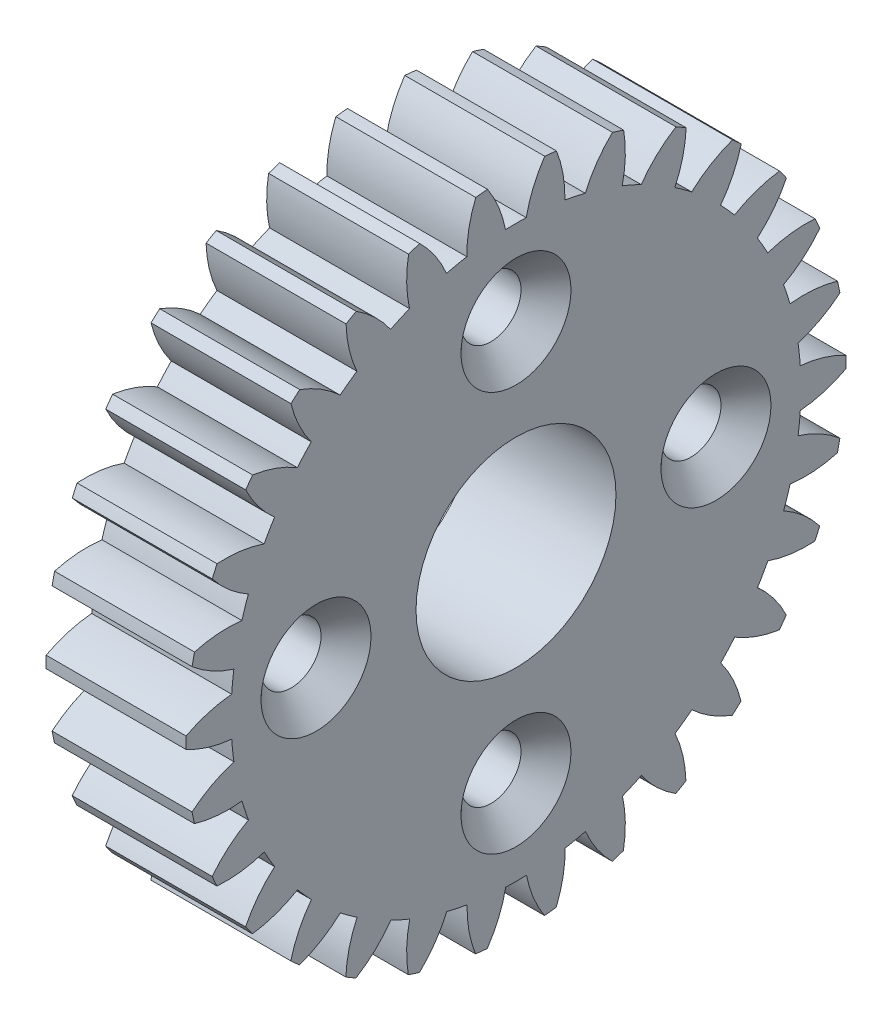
ISO-10303-21;
HEADER;
FILE_DESCRIPTION(('STEP AP214'),'2;1');
FILE_NAME('part.step','',(''),(''),'','','');
FILE_SCHEMA(('AUTOMOTIVE_DESIGN { 1 0 10303 214 1 1 1 1 }'));
ENDSEC;
DATA;
#1=APPLICATION_CONTEXT('core data for automotive mechanical design processes');
#2=APPLICATION_PROTOCOL_DEFINITION('international standard','automotive_design',2000,#1);
#3=PRODUCT_CONTEXT('',#1,'mechanical');
#4=PRODUCT('Part','Part','',(#3));
#5=PRODUCT_RELATED_PRODUCT_CATEGORY('part','',(#4));
#6=PRODUCT_DEFINITION_FORMATION('','',#4);
#7=PRODUCT_DEFINITION_CONTEXT('part definition',#1,'design');
#8=PRODUCT_DEFINITION('design','',#6,#7);
#9=PRODUCT_DEFINITION_SHAPE('','',#8);
#10=(LENGTH_UNIT() NAMED_UNIT(*) SI_UNIT(.MILLI.,.METRE.));
#11=(NAMED_UNIT(*) PLANE_ANGLE_UNIT() SI_UNIT($,.RADIAN.));
#12=(NAMED_UNIT(*) SI_UNIT($,.STERADIAN.) SOLID_ANGLE_UNIT());
#13=UNCERTAINTY_MEASURE_WITH_UNIT(LENGTH_MEASURE(1.E-05),#10,'distance_accuracy_value','');
#14=(GEOMETRIC_REPRESENTATION_CONTEXT(3) GLOBAL_UNCERTAINTY_ASSIGNED_CONTEXT((#13)) GLOBAL_UNIT_ASSIGNED_CONTEXT((#10,
#11,#12)) REPRESENTATION_CONTEXT('',''));
#15=CARTESIAN_POINT('',(0.,0.,0.));
#16=DIRECTION('',(0.,0.,1.));
#17=DIRECTION('',(1.,0.,0.));
#18=AXIS2_PLACEMENT_3D('',#15,#16,#17);
#19=CARTESIAN_POINT('',(7.,0.,0.));
#20=DIRECTION('',(-1.,0.,0.));
#21=DIRECTION('',(0.,0.,1.));
#22=AXIS2_PLACEMENT_3D('',#19,#20,#21);
#23=PLANE('',#22);
#24=CARTESIAN_POINT('',(7.,0.,10.));
#25=DIRECTION('',(1.,0.,0.));
#26=DIRECTION('',(0.,0.,-1.));
#27=AXIS2_PLACEMENT_3D('',#24,#25,#26);
#28=CIRCLE('',#27,2.75);
#29=CARTESIAN_POINT('',(7.,0.,7.25));
#30=VERTEX_POINT('',#29);
#31=EDGE_CURVE('E867',#30,#30,#28,.T.);
#32=ORIENTED_EDGE('',*,*,#31,.F.);
#33=EDGE_LOOP('',(#32));
#34=FACE_BOUND('',#33,.T.);
#35=CARTESIAN_POINT('',(7.,-10.,0.));
#36=DIRECTION('',(1.,0.,0.));
#37=DIRECTION('',(0.,0.,-1.));
#38=AXIS2_PLACEMENT_3D('',#35,#36,#37);
#39=CIRCLE('',#38,2.75);
#40=CARTESIAN_POINT('',(7.,-10.,-2.75));
#41=VERTEX_POINT('',#40);
#42=EDGE_CURVE('E871',#41,#41,#39,.T.);
#43=ORIENTED_EDGE('',*,*,#42,.F.);
#44=EDGE_LOOP('',(#43));
#45=FACE_BOUND('',#44,.T.);
#46=CARTESIAN_POINT('',(7.,10.,0.));
#47=DIRECTION('',(1.,0.,0.));
#48=DIRECTION('',(0.,0.,-1.));
#49=AXIS2_PLACEMENT_3D('',#46,#47,#48);
#50=CIRCLE('',#49,2.75);
#51=CARTESIAN_POINT('',(7.,10.,-2.75));
#52=VERTEX_POINT('',#51);
#53=EDGE_CURVE('E837',#52,#52,#50,.T.);
#54=ORIENTED_EDGE('',*,*,#53,.F.);
#55=EDGE_LOOP('',(#54));
#56=FACE_BOUND('',#55,.T.);
#57=CARTESIAN_POINT('',(7.,0.,0.));
#58=DIRECTION('',(-1.,0.,0.));
#59=DIRECTION('',(0.,0.,1.));
#60=AXIS2_PLACEMENT_3D('',#57,#58,#59);
#61=CIRCLE('',#60,5.);
#62=CARTESIAN_POINT('',(7.,0.,5.));
#63=VERTEX_POINT('',#62);
#64=EDGE_CURVE('E836',#63,#63,#61,.F.);
#65=ORIENTED_EDGE('',*,*,#64,.F.);
#66=EDGE_LOOP('',(#65));
#67=FACE_BOUND('',#66,.T.);
#68=CARTESIAN_POINT('',(7.,4.99516336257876,13.6519994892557));
#69=DIRECTION('',(-1.,0.,0.));
#70=DIRECTION('',(0.,0.994521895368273,0.104528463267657));
#71=AXIS2_PLACEMENT_3D('',#68,#69,#70);
#72=CIRCLE('',#71,6.);
#73=CARTESIAN_POINT('',(7.,-0.978328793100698,14.2153745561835));
#74=VERTEX_POINT('',#73);
#75=CARTESIAN_POINT('',(7.,-0.287177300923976,16.4975006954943));
#76=VERTEX_POINT('',#75);
#77=EDGE_CURVE('E977',#74,#76,#72,.T.);
#78=ORIENTED_EDGE('',*,*,#77,.F.);
#79=CARTESIAN_POINT('',(7.,0.,0.));
#80=DIRECTION('',(-1.,0.,0.));
#81=DIRECTION('',(0.,0.994521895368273,0.104528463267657));
#82=AXIS2_PLACEMENT_3D('',#79,#80,#81);
#83=CIRCLE('',#82,14.249);
#84=CARTESIAN_POINT('',(7.,-2.01111874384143,14.1063603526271));
#85=VERTEX_POINT('',#84);
#86=EDGE_CURVE('E984',#85,#74,#83,.T.);
#87=ORIENTED_EDGE('',*,*,#86,.F.);
#88=CARTESIAN_POINT('',(7.,-7.7531594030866,12.3659669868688));
#89=DIRECTION('',(-1.,0.,0.));
#90=DIRECTION('',(0.,0.994521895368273,0.104528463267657));
#91=AXIS2_PLACEMENT_3D('',#88,#89,#90);
#92=CIRCLE('',#91,6.);
#93=CARTESIAN_POINT('',(7.,-3.1371358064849,16.1990240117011));
#94=VERTEX_POINT('',#93);
#95=EDGE_CURVE('E980',#94,#85,#92,.T.);
#96=ORIENTED_EDGE('',*,*,#95,.F.);
#97=CARTESIAN_POINT('',(7.,0.,0.));
#98=DIRECTION('',(-1.,0.,0.));
#99=DIRECTION('',(0.,0.,1.));
#100=AXIS2_PLACEMENT_3D('',#97,#98,#99);
#101=CIRCLE('',#100,16.5);
#102=CARTESIAN_POINT('',(7.,-3.71092505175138,16.0772832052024));
#103=VERTEX_POINT('',#102);
#104=EDGE_CURVE('E2462',#103,#94,#101,.T.);
#105=ORIENTED_EDGE('',*,*,#104,.F.);
#106=CARTESIAN_POINT('',(7.,2.04759676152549,14.3922234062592));
#107=DIRECTION('',(-1.,0.,0.));
#108=DIRECTION('',(0.,0.951056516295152,0.309016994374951));
#109=AXIS2_PLACEMENT_3D('',#106,#107,#108);
#110=CIRCLE('',#109,6.);
#111=CARTESIAN_POINT('',(7.,-3.91249252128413,13.701328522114));
#112=VERTEX_POINT('',#111);
#113=EDGE_CURVE('E1254',#112,#103,#110,.T.);
#114=ORIENTED_EDGE('',*,*,#113,.F.);
#115=CARTESIAN_POINT('',(7.,0.,0.));
#116=DIRECTION('',(-1.,0.,0.));
#117=DIRECTION('',(0.,0.951056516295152,0.309016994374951));
#118=AXIS2_PLACEMENT_3D('',#115,#116,#117);
#119=CIRCLE('',#118,14.249);
#120=CARTESIAN_POINT('',(7.,-4.90004820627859,13.3799674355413));
#121=VERTEX_POINT('',#120);
#122=EDGE_CURVE('E1261',#121,#112,#119,.T.);
#123=ORIENTED_EDGE('',*,*,#122,.F.);
#124=CARTESIAN_POINT('',(7.,-10.1547633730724,10.4837684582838));
#125=DIRECTION('',(-1.,0.,0.));
#126=DIRECTION('',(0.,0.951056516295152,0.309016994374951));
#127=AXIS2_PLACEMENT_3D('',#124,#125,#126);
#128=CIRCLE('',#127,6.);
#129=CARTESIAN_POINT('',(7.,-6.43654833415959,15.1927892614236));
#130=VERTEX_POINT('',#129);
#131=EDGE_CURVE('E1257',#130,#121,#128,.T.);
#132=ORIENTED_EDGE('',*,*,#131,.F.);
#133=CARTESIAN_POINT('',(7.,-6.9724875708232,14.9544112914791));
#134=VERTEX_POINT('',#133);
#135=EDGE_CURVE('E2444',#134,#130,#101,.T.);
#136=ORIENTED_EDGE('',*,*,#135,.F.);
#137=CARTESIAN_POINT('',(7.,-0.98945964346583,14.5034380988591));
#138=DIRECTION('',(-1.,0.,0.));
#139=DIRECTION('',(0.,0.866025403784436,0.500000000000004));
#140=AXIS2_PLACEMENT_3D('',#137,#138,#139);
#141=CIRCLE('',#140,6.);
#142=CARTESIAN_POINT('',(7.,-6.67566155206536,12.5884686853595));
#143=VERTEX_POINT('',#142);
#144=EDGE_CURVE('E1324',#143,#134,#141,.T.);
#145=ORIENTED_EDGE('',*,*,#144,.F.);
#146=CARTESIAN_POINT('',(7.,0.,0.));
#147=DIRECTION('',(-1.,0.,0.));
#148=DIRECTION('',(0.,0.866025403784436,0.500000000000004));
#149=AXIS2_PLACEMENT_3D('',#146,#147,#148);
#150=CIRCLE('',#149,14.249);
#151=CARTESIAN_POINT('',(7.,-7.57482204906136,12.0688057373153));
#152=VERTEX_POINT('',#151);
#153=EDGE_CURVE('E1331',#152,#143,#150,.T.);
#154=ORIENTED_EDGE('',*,*,#153,.F.);
#155=CARTESIAN_POINT('',(7.,-12.112555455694,8.14337894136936));
#156=DIRECTION('',(-1.,0.,0.));
#157=DIRECTION('',(0.,0.866025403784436,0.500000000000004));
#158=AXIS2_PLACEMENT_3D('',#155,#156,#157);
#159=CIRCLE('',#158,6.);
#160=CARTESIAN_POINT('',(7.,-9.45465281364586,13.5225567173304));
#161=VERTEX_POINT('',#160);
#162=EDGE_CURVE('E1327',#161,#152,#159,.T.);
#163=ORIENTED_EDGE('',*,*,#162,.F.);
#164=CARTESIAN_POINT('',(7.,-9.92931892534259,13.1779598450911));
#165=VERTEX_POINT('',#164);
#166=EDGE_CURVE('E2426',#165,#161,#101,.T.);
#167=ORIENTED_EDGE('',*,*,#166,.F.);
#168=CARTESIAN_POINT('',(7.,-3.98327191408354,13.9807829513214));
#169=DIRECTION('',(-1.,0.,0.));
#170=DIRECTION('',(0.,0.743144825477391,0.669130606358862));
#171=AXIS2_PLACEMENT_3D('',#168,#169,#170);
#172=CIRCLE('',#171,6.);
#173=CARTESIAN_POINT('',(7.,-9.14707213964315,10.92543236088));
#174=VERTEX_POINT('',#173);
#175=EDGE_CURVE('E1289',#174,#165,#172,.T.);
#176=ORIENTED_EDGE('',*,*,#175,.F.);
#177=CARTESIAN_POINT('',(7.,0.,0.));
#178=DIRECTION('',(-1.,0.,0.));
#179=DIRECTION('',(0.,0.743144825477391,0.669130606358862));
#180=AXIS2_PLACEMENT_3D('',#177,#178,#179);
#181=CIRCLE('',#180,14.249);
#182=CARTESIAN_POINT('',(7.,-9.91853982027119,10.2301793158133));
#183=VERTEX_POINT('',#182);
#184=EDGE_CURVE('E1296',#183,#174,#181,.T.);
#185=ORIENTED_EDGE('',*,*,#184,.F.);
#186=CARTESIAN_POINT('',(7.,-13.5409707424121,5.44708468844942));
#187=DIRECTION('',(-1.,0.,0.));
#188=DIRECTION('',(0.,0.743144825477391,0.669130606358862));
#189=AXIS2_PLACEMENT_3D('',#186,#187,#188);
#190=CIRCLE('',#189,6.);
#191=CARTESIAN_POINT('',(7.,-12.059543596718,11.2613235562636));
#192=VERTEX_POINT('',#191);
#193=EDGE_CURVE('E1292',#192,#183,#190,.T.);
#194=ORIENTED_EDGE('',*,*,#193,.F.);
#195=CARTESIAN_POINT('',(7.,-12.4521913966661,10.8255683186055));
#196=VERTEX_POINT('',#195);
#197=EDGE_CURVE('E2408',#196,#192,#101,.T.);
#198=ORIENTED_EDGE('',*,*,#197,.F.);
#199=CARTESIAN_POINT('',(7.,-6.80299608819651,12.8471005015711));
#200=DIRECTION('',(-1.,0.,0.));
#201=DIRECTION('',(0.,0.587785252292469,0.80901699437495));
#202=AXIS2_PLACEMENT_3D('',#199,#200,#201);
#203=CIRCLE('',#202,6.);
#204=CARTESIAN_POINT('',(7.,-11.2187117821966,8.78490221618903));
#205=VERTEX_POINT('',#204);
#206=EDGE_CURVE('E1149',#205,#196,#203,.T.);
#207=ORIENTED_EDGE('',*,*,#206,.F.);
#208=CARTESIAN_POINT('',(7.,0.,0.));
#209=DIRECTION('',(-1.,0.,0.));
#210=DIRECTION('',(0.,0.587785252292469,0.80901699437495));
#211=AXIS2_PLACEMENT_3D('',#208,#209,#210);
#212=CIRCLE('',#211,14.249);
#213=CARTESIAN_POINT('',(7.,-11.8287698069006,7.94444496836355));
#214=VERTEX_POINT('',#213);
#215=EDGE_CURVE('E1156',#214,#205,#212,.T.);
#216=ORIENTED_EDGE('',*,*,#215,.F.);
#217=CARTESIAN_POINT('',(7.,-14.3775806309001,2.51272669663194));
#218=DIRECTION('',(-1.,0.,0.));
#219=DIRECTION('',(0.,0.587785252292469,0.80901699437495));
#220=AXIS2_PLACEMENT_3D('',#217,#218,#219);
#221=CIRCLE('',#220,6.);
#222=CARTESIAN_POINT('',(7.,-14.1373744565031,8.50791651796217));
#223=VERTEX_POINT('',#222);
#224=EDGE_CURVE('E1152',#223,#214,#221,.T.);
#225=ORIENTED_EDGE('',*,*,#224,.F.);
#226=CARTESIAN_POINT('',(7.,-14.4308433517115,8.00004750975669));
#227=VERTEX_POINT('',#226);
#228=EDGE_CURVE('E2390',#227,#223,#101,.T.);
#229=ORIENTED_EDGE('',*,*,#228,.F.);
#230=CARTESIAN_POINT('',(7.,-9.32539668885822,11.1519381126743));
#231=DIRECTION('',(-1.,0.,0.));
#232=DIRECTION('',(0.,0.406736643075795,0.913545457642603));
#233=AXIS2_PLACEMENT_3D('',#230,#231,#232);
#234=CIRCLE('',#233,6.);
#235=CARTESIAN_POINT('',(7.,-12.8000398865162,6.26042969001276));
#236=VERTEX_POINT('',#235);
#237=EDGE_CURVE('E1112',#236,#227,#234,.T.);
#238=ORIENTED_EDGE('',*,*,#237,.F.);
#239=CARTESIAN_POINT('',(7.,0.,0.));
#240=DIRECTION('',(-1.,0.,0.));
#241=DIRECTION('',(0.,0.406736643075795,0.913545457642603));
#242=AXIS2_PLACEMENT_3D('',#239,#240,#241);
#243=CIRCLE('',#242,14.249);
#244=CARTESIAN_POINT('',(7.,-13.2220257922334,5.31150025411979));
#245=VERTEX_POINT('',#244);
#246=EDGE_CURVE('E1119',#245,#236,#243,.T.);
#247=ORIENTED_EDGE('',*,*,#246,.F.);
#248=CARTESIAN_POINT('',(7.,-14.5858212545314,-0.531449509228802));
#249=DIRECTION('',(-1.,0.,0.));
#250=DIRECTION('',(0.,0.406736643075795,0.913545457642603));
#251=AXIS2_PLACEMENT_3D('',#248,#249,#250);
#252=CIRCLE('',#251,6.);
#253=CARTESIAN_POINT('',(7.,-15.5973342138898,5.38267270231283));
#254=VERTEX_POINT('',#253);
#255=EDGE_CURVE('E1115',#254,#245,#252,.T.);
#256=ORIENTED_EDGE('',*,*,#255,.F.);
#257=CARTESIAN_POINT('',(7.,-15.7787982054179,4.8248862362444));
#258=VERTEX_POINT('',#257);
#259=EDGE_CURVE('E2372',#258,#254,#101,.T.);
#260=ORIENTED_EDGE('',*,*,#259,.F.);
#261=CARTESIAN_POINT('',(7.,-11.4402327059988,8.96938251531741));
#262=DIRECTION('',(-1.,0.,0.));
#263=DIRECTION('',(0.,0.207911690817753,0.978147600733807));
#264=AXIS2_PLACEMENT_3D('',#261,#262,#263);
#265=CIRCLE('',#264,6.);
#266=CARTESIAN_POINT('',(7.,-13.8219448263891,3.46234634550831));
#267=VERTEX_POINT('',#266);
#268=EDGE_CURVE('E1184',#267,#258,#265,.T.);
#269=ORIENTED_EDGE('',*,*,#268,.F.);
#270=CARTESIAN_POINT('',(7.,0.,0.));
#271=DIRECTION('',(-1.,0.,0.));
#272=DIRECTION('',(0.,0.207911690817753,0.978147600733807));
#273=AXIS2_PLACEMENT_3D('',#270,#271,#272);
#274=CIRCLE('',#273,14.249);
#275=CARTESIAN_POINT('',(7.,-14.0374158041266,2.44641749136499));
#276=VERTEX_POINT('',#275);
#277=EDGE_CURVE('E1191',#276,#267,#274,.T.);
#278=ORIENTED_EDGE('',*,*,#277,.F.);
#279=CARTESIAN_POINT('',(7.,-14.156591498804,-3.55239882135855));
#280=DIRECTION('',(-1.,0.,0.));
#281=DIRECTION('',(0.,0.207911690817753,0.978147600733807));
#282=AXIS2_PLACEMENT_3D('',#279,#280,#281);
#283=CIRCLE('',#282,6.);
#284=CARTESIAN_POINT('',(7.,-16.375615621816,2.02218026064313));
#285=VERTEX_POINT('',#284);
#286=EDGE_CURVE('E1187',#285,#276,#283,.T.);
#287=ORIENTED_EDGE('',*,*,#286,.F.);
#288=CARTESIAN_POINT('',(7.,-16.4371438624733,1.43885428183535));
#289=VERTEX_POINT('',#288);
#290=EDGE_CURVE('E2354',#289,#285,#101,.T.);
#291=ORIENTED_EDGE('',*,*,#290,.F.);
#292=CARTESIAN_POINT('',(7.,-13.05507565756,6.39482186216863));
#293=DIRECTION('',(-1.,0.,0.));
#294=DIRECTION('',(0.,0.,1.));
#295=AXIS2_PLACEMENT_3D('',#292,#293,#294);
#296=CIRCLE('',#295,6.);
#297=CARTESIAN_POINT('',(7.,-14.2397644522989,0.512941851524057));
#298=VERTEX_POINT('',#297);
#299=EDGE_CURVE('E1219',#298,#289,#296,.T.);
#300=ORIENTED_EDGE('',*,*,#299,.F.);
#301=CARTESIAN_POINT('',(7.,0.,0.));
#302=DIRECTION('',(-1.,0.,0.));
#303=DIRECTION('',(0.,0.,1.));
#304=AXIS2_PLACEMENT_3D('',#301,#302,#303);
#305=CIRCLE('',#304,14.249);
#306=CARTESIAN_POINT('',(7.,-14.2393033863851,-0.525585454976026));
#307=VERTEX_POINT('',#306);
#308=EDGE_CURVE('E1226',#307,#298,#305,.T.);
#309=ORIENTED_EDGE('',*,*,#308,.F.);
#310=CARTESIAN_POINT('',(7.,-13.1086507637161,-6.41809125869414));
#311=DIRECTION('',(-1.,0.,0.));
#312=DIRECTION('',(0.,0.,1.));
#313=AXIS2_PLACEMENT_3D('',#310,#311,#312);
#314=CIRCLE('',#313,6.);
#315=CARTESIAN_POINT('',(7.,-16.438204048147,-1.42669116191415));
#316=VERTEX_POINT('',#315);
#317=EDGE_CURVE('E1222',#316,#307,#314,.T.);
#318=ORIENTED_EDGE('',*,*,#317,.F.);
#319=CARTESIAN_POINT('',(7.,-16.3771074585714,-2.01006250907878));
#320=VERTEX_POINT('',#319);
#321=EDGE_CURVE('E2336',#320,#316,#101,.T.);
#322=ORIENTED_EDGE('',*,*,#321,.F.);
#323=CARTESIAN_POINT('',(7.,-14.0993491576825,3.54077680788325));
#324=DIRECTION('',(-1.,0.,0.));
#325=DIRECTION('',(0.,-0.207911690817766,0.978147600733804));
#326=AXIS2_PLACEMENT_3D('',#323,#324,#325);
#327=CIRCLE('',#326,6.);
#328=CARTESIAN_POINT('',(7.,-14.0352380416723,-2.45888066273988));
#329=VERTEX_POINT('',#328);
#330=EDGE_CURVE('E1499',#329,#320,#327,.T.);
#331=ORIENTED_EDGE('',*,*,#330,.F.);
#332=CARTESIAN_POINT('',(7.,0.,0.));
#333=DIRECTION('',(-1.,0.,0.));
#334=DIRECTION('',(0.,-0.207911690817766,0.978147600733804));
#335=AXIS2_PLACEMENT_3D('',#332,#333,#334);
#336=CIRCLE('',#335,14.249);
#337=CARTESIAN_POINT('',(7.,-13.8188650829,-3.47461779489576));
#338=VERTEX_POINT('',#337);
#339=EDGE_CURVE('E1506',#338,#329,#336,.T.);
#340=ORIENTED_EDGE('',*,*,#339,.F.);
#341=CARTESIAN_POINT('',(7.,-11.4877990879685,-9.00328231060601));
#342=DIRECTION('',(-1.,0.,0.));
#343=DIRECTION('',(0.,-0.207911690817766,0.978147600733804));
#344=AXIS2_PLACEMENT_3D('',#341,#342,#343);
#345=CIRCLE('',#344,6.);
#346=CARTESIAN_POINT('',(7.,-15.7823640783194,-4.81320933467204));
#347=VERTEX_POINT('',#346);
#348=EDGE_CURVE('E1502',#347,#338,#345,.T.);
#349=ORIENTED_EDGE('',*,*,#348,.F.);
#350=CARTESIAN_POINT('',(7.,-15.6013128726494,-5.37112992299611));
#351=VERTEX_POINT('',#350);
#352=EDGE_CURVE('E2318',#351,#347,#101,.T.);
#353=ORIENTED_EDGE('',*,*,#352,.F.);
#354=CARTESIAN_POINT('',(7.,-14.5274134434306,0.531982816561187));
#355=DIRECTION('',(-1.,0.,0.));
#356=DIRECTION('',(0.,-0.406736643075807,0.913545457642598));
#357=AXIS2_PLACEMENT_3D('',#354,#355,#356);
#358=CIRCLE('',#357,6.);
#359=CARTESIAN_POINT('',(7.,-13.2173043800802,-5.32323829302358));
#360=VERTEX_POINT('',#359);
#361=EDGE_CURVE('E1569',#360,#351,#358,.T.);
#362=ORIENTED_EDGE('',*,*,#361,.F.);
#363=CARTESIAN_POINT('',(7.,0.,0.));
#364=DIRECTION('',(-1.,0.,0.));
#365=DIRECTION('',(0.,-0.406736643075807,0.913545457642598));
#366=AXIS2_PLACEMENT_3D('',#363,#364,#365);
#367=CIRCLE('',#366,14.249);
#368=CARTESIAN_POINT('',(7.,-12.7944760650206,-6.27179266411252));
#369=VERTEX_POINT('',#368);
#370=EDGE_CURVE('E1576',#369,#360,#367,.T.);
#371=ORIENTED_EDGE('',*,*,#370,.F.);
#372=CARTESIAN_POINT('',(7.,-9.36487546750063,-11.1949867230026));
#373=DIRECTION('',(-1.,0.,0.));
#374=DIRECTION('',(0.,-0.406736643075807,0.913545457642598));
#375=AXIS2_PLACEMENT_3D('',#372,#373,#374);
#376=CIRCLE('',#375,6.);
#377=CARTESIAN_POINT('',(7.,-14.436759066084,-7.98936716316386));
#378=VERTEX_POINT('',#377);
#379=EDGE_CURVE('E1572',#378,#369,#376,.T.);
#380=ORIENTED_EDGE('',*,*,#379,.F.);
#381=CARTESIAN_POINT('',(7.,-14.1436660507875,-8.49745318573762));
#382=VERTEX_POINT('',#381);
#383=EDGE_CURVE('E2300',#382,#378,#101,.T.);
#384=ORIENTED_EDGE('',*,*,#383,.F.);
#385=CARTESIAN_POINT('',(7.,-14.3205600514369,-2.50006137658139));
#386=DIRECTION('',(-1.,0.,0.));
#387=DIRECTION('',(0.,-0.58778525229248,0.809016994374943));
#388=AXIS2_PLACEMENT_3D('',#385,#386,#387);
#389=CIRCLE('',#388,6.);
#390=CARTESIAN_POINT('',(7.,-11.8217110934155,-7.95494486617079));
#391=VERTEX_POINT('',#390);
#392=EDGE_CURVE('E1534',#391,#382,#389,.T.);
#393=ORIENTED_EDGE('',*,*,#392,.F.);
#394=CARTESIAN_POINT('',(7.,0.,0.));
#395=DIRECTION('',(-1.,0.,0.));
#396=DIRECTION('',(0.,-0.58778525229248,0.809016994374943));
#397=AXIS2_PLACEMENT_3D('',#394,#395,#396);
#398=CIRCLE('',#397,14.249);
#399=CARTESIAN_POINT('',(7.,-11.2109070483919,-8.79486009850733));
#400=VERTEX_POINT('',#399);
#401=EDGE_CURVE('E1541',#400,#391,#398,.T.);
#402=ORIENTED_EDGE('',*,*,#401,.F.);
#403=CARTESIAN_POINT('',(7.,-6.83266185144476,-12.8974164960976));
#404=DIRECTION('',(-1.,0.,0.));
#405=DIRECTION('',(0.,-0.58778525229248,0.809016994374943));
#406=AXIS2_PLACEMENT_3D('',#403,#404,#405);
#407=CIRCLE('',#406,6.);
#408=CARTESIAN_POINT('',(7.,-12.4601984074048,-10.8163513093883));
#409=VERTEX_POINT('',#408);
#410=EDGE_CURVE('E1537',#409,#400,#407,.T.);
#411=ORIENTED_EDGE('',*,*,#410,.F.);
#412=CARTESIAN_POINT('',(7.,-12.0678731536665,-11.252396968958));
#413=VERTEX_POINT('',#412);
#414=EDGE_CURVE('E2282',#413,#409,#101,.T.);
#415=ORIENTED_EDGE('',*,*,#414,.F.);
#416=CARTESIAN_POINT('',(7.,-13.4878294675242,-5.42284089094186));
#417=DIRECTION('',(-1.,0.,0.));
#418=DIRECTION('',(0.,-0.7431448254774,0.669130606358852));
#419=AXIS2_PLACEMENT_3D('',#416,#417,#418);
#420=CIRCLE('',#419,6.);
#421=CARTESIAN_POINT('',(7.,-9.90945230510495,-10.2389821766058));
#422=VERTEX_POINT('',#421);
#423=EDGE_CURVE('E1394',#422,#413,#420,.T.);
#424=ORIENTED_EDGE('',*,*,#423,.F.);
#425=CARTESIAN_POINT('',(7.,0.,0.));
#426=DIRECTION('',(-1.,0.,0.));
#427=DIRECTION('',(0.,-0.7431448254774,0.669130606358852));
#428=AXIS2_PLACEMENT_3D('',#425,#426,#427);
#429=CIRCLE('',#428,14.249);
#430=CARTESIAN_POINT('',(7.,-9.13736759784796,-10.9335499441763));
#431=VERTEX_POINT('',#430);
#432=EDGE_CURVE('E1401',#431,#422,#429,.T.);
#433=ORIENTED_EDGE('',*,*,#432,.F.);
#434=CARTESIAN_POINT('',(7.,-4.00182812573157,-14.0361672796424));
#435=DIRECTION('',(-1.,0.,0.));
#436=DIRECTION('',(0.,-0.7431448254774,0.669130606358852));
#437=AXIS2_PLACEMENT_3D('',#434,#435,#436);
#438=CIRCLE('',#437,6.);
#439=CARTESIAN_POINT('',(7.,-9.93906728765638,-13.1706090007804));
#440=VERTEX_POINT('',#439);
#441=EDGE_CURVE('E1397',#440,#431,#438,.T.);
#442=ORIENTED_EDGE('',*,*,#441,.F.);
#443=CARTESIAN_POINT('',(7.,-9.46465629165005,-13.5155570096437));
#444=VERTEX_POINT('',#443);
#445=EDGE_CURVE('E2264',#444,#440,#101,.T.);
#446=ORIENTED_EDGE('',*,*,#445,.F.);
#447=CARTESIAN_POINT('',(7.,-12.0656160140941,-8.10861623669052));
#448=DIRECTION('',(-1.,0.,0.));
#449=DIRECTION('',(0.,-0.866025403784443,0.499999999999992));
#450=AXIS2_PLACEMENT_3D('',#447,#448,#449);
#451=CIRCLE('',#450,6.);
#452=CARTESIAN_POINT('',(7.,-7.56410290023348,-12.0755268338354));
#453=VERTEX_POINT('',#452);
#454=EDGE_CURVE('E1357',#453,#444,#451,.T.);
#455=ORIENTED_EDGE('',*,*,#454,.F.);
#456=CARTESIAN_POINT('',(7.,0.,0.));
#457=DIRECTION('',(-1.,0.,0.));
#458=DIRECTION('',(0.,-0.866025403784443,0.499999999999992));
#459=AXIS2_PLACEMENT_3D('',#456,#457,#458);
#460=CIRCLE('',#459,14.249);
#461=CARTESIAN_POINT('',(7.,-6.66448133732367,-12.5943911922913));
#462=VERTEX_POINT('',#461);
#463=EDGE_CURVE('E1364',#462,#453,#460,.T.);
#464=ORIENTED_EDGE('',*,*,#463,.F.);
#465=CARTESIAN_POINT('',(7.,-0.99609530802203,-14.5614702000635));
#466=DIRECTION('',(-1.,0.,0.));
#467=DIRECTION('',(0.,-0.866025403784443,0.499999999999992));
#468=AXIS2_PLACEMENT_3D('',#465,#466,#467);
#469=CIRCLE('',#468,6.);
#470=CARTESIAN_POINT('',(7.,-6.98355123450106,-14.9492478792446));
#471=VERTEX_POINT('',#470);
#472=EDGE_CURVE('E1360',#471,#462,#469,.T.);
#473=ORIENTED_EDGE('',*,*,#472,.F.);
#474=CARTESIAN_POINT('',(7.,-6.44778853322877,-15.1880223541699));
#475=VERTEX_POINT('',#474);
#476=EDGE_CURVE('E2246',#475,#471,#101,.T.);
#477=ORIENTED_EDGE('',*,*,#476,.F.);
#478=CARTESIAN_POINT('',(7.,-10.1160772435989,-10.4400061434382));
#479=DIRECTION('',(-1.,0.,0.));
#480=DIRECTION('',(0.,-0.951056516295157,0.309016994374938));
#481=AXIS2_PLACEMENT_3D('',#478,#479,#480);
#482=CIRCLE('',#481,6.);
#483=CARTESIAN_POINT('',(7.,-4.88816590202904,-13.3843130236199));
#484=VERTEX_POINT('',#483);
#485=EDGE_CURVE('E1429',#484,#475,#482,.T.);
#486=ORIENTED_EDGE('',*,*,#485,.F.);
#487=CARTESIAN_POINT('',(7.,0.,0.));
#488=DIRECTION('',(-1.,0.,0.));
#489=DIRECTION('',(0.,-0.951056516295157,0.309016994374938));
#490=AXIS2_PLACEMENT_3D('',#487,#488,#489);
#491=CIRCLE('',#490,14.249);
#492=CARTESIAN_POINT('',(7.,-3.90032526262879,-13.7047971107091));
#493=VERTEX_POINT('',#492);
#494=EDGE_CURVE('E1436',#493,#484,#491,.T.);
#495=ORIENTED_EDGE('',*,*,#494,.F.);
#496=CARTESIAN_POINT('',(7.,2.05317165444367,-14.4503669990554));
#497=DIRECTION('',(-1.,0.,0.));
#498=DIRECTION('',(0.,-0.951056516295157,0.309016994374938));
#499=AXIS2_PLACEMENT_3D('',#496,#497,#498);
#500=CIRCLE('',#499,6.);
#501=CARTESIAN_POINT('',(7.,-3.72282048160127,-16.0745328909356));
#502=VERTEX_POINT('',#501);
#503=EDGE_CURVE('E1432',#502,#493,#500,.T.);
#504=ORIENTED_EDGE('',*,*,#503,.F.);
#505=CARTESIAN_POINT('',(7.,-3.14912147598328,-16.1966982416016));
#506=VERTEX_POINT('',#505);
#507=EDGE_CURVE('E2228',#506,#502,#101,.T.);
#508=ORIENTED_EDGE('',*,*,#507,.F.);
#509=CARTESIAN_POINT('',(7.,-7.72441735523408,-12.3151176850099));
#510=DIRECTION('',(-1.,0.,0.));
#511=DIRECTION('',(0.,-0.994521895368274,0.104528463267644));
#512=AXIS2_PLACEMENT_3D('',#509,#510,#511);
#513=CIRCLE('',#512,6.);
#514=CARTESIAN_POINT('',(7.,-1.99859259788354,-14.1081405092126));
#515=VERTEX_POINT('',#514);
#516=EDGE_CURVE('E1464',#515,#506,#513,.T.);
#517=ORIENTED_EDGE('',*,*,#516,.F.);
#518=CARTESIAN_POINT('',(7.,0.,0.));
#519=DIRECTION('',(-1.,0.,0.));
#520=DIRECTION('',(0.,-0.994521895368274,0.104528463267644));
#521=AXIS2_PLACEMENT_3D('',#518,#519,#520);
#522=CIRCLE('',#521,14.249);
#523=CARTESIAN_POINT('',(7.,-0.965706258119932,-14.216237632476));
#524=VERTEX_POINT('',#523);
#525=EDGE_CURVE('E1471',#524,#515,#522,.T.);
#526=ORIENTED_EDGE('',*,*,#525,.F.);
#527=CARTESIAN_POINT('',(7.,5.01270516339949,-13.7077134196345));
#528=DIRECTION('',(-1.,0.,0.));
#529=DIRECTION('',(0.,-0.994521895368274,0.104528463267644));
#530=AXIS2_PLACEMENT_3D('',#527,#528,#529);
#531=CIRCLE('',#530,6.);
#532=CARTESIAN_POINT('',(7.,-0.299384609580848,-16.497283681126));
#533=VERTEX_POINT('',#532);
#534=EDGE_CURVE('E1467',#533,#524,#531,.T.);
#535=ORIENTED_EDGE('',*,*,#534,.F.);
#536=CARTESIAN_POINT('',(7.,0.287177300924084,-16.4975006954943));
#537=VERTEX_POINT('',#536);
#538=EDGE_CURVE('E2210',#537,#533,#101,.T.);
#539=ORIENTED_EDGE('',*,*,#538,.F.);
#540=CARTESIAN_POINT('',(7.,-4.99516336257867,-13.6519994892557));
#541=DIRECTION('',(-1.,0.,0.));
#542=DIRECTION('',(0.,-0.994521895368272,-0.104528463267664));
#543=AXIS2_PLACEMENT_3D('',#540,#541,#542);
#544=CIRCLE('',#543,6.);
#545=CARTESIAN_POINT('',(7.,0.97832879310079,-14.2153745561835));
#546=VERTEX_POINT('',#545);
#547=EDGE_CURVE('E1742',#546,#537,#544,.T.);
#548=ORIENTED_EDGE('',*,*,#547,.F.);
#549=CARTESIAN_POINT('',(7.,0.,0.));
#550=DIRECTION('',(-1.,0.,0.));
#551=DIRECTION('',(0.,-0.994521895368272,-0.104528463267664));
#552=AXIS2_PLACEMENT_3D('',#549,#550,#551);
#553=CIRCLE('',#552,14.249);
#554=CARTESIAN_POINT('',(7.,2.01111874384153,-14.1063603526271));
#555=VERTEX_POINT('',#554);
#556=EDGE_CURVE('E1749',#555,#546,#553,.T.);
#557=ORIENTED_EDGE('',*,*,#556,.F.);
#558=CARTESIAN_POINT('',(7.,7.75315940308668,-12.3659669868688));
#559=DIRECTION('',(-1.,0.,0.));
#560=DIRECTION('',(0.,-0.994521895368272,-0.104528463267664));
#561=AXIS2_PLACEMENT_3D('',#558,#559,#560);
#562=CIRCLE('',#561,6.);
#563=CARTESIAN_POINT('',(7.,3.13713580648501,-16.1990240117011));
#564=VERTEX_POINT('',#563);
#565=EDGE_CURVE('E1745',#564,#555,#562,.T.);
#566=ORIENTED_EDGE('',*,*,#565,.F.);
#567=CARTESIAN_POINT('',(7.,3.71092505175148,-16.0772832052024));
#568=VERTEX_POINT('',#567);
#569=EDGE_CURVE('E2192',#568,#564,#101,.T.);
#570=ORIENTED_EDGE('',*,*,#569,.F.);
#571=CARTESIAN_POINT('',(7.,-2.0475967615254,-14.3922234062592));
#572=DIRECTION('',(-1.,0.,0.));
#573=DIRECTION('',(0.,-0.95105651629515,-0.309016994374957));
#574=AXIS2_PLACEMENT_3D('',#571,#572,#573);
#575=CIRCLE('',#574,6.);
#576=CARTESIAN_POINT('',(7.,3.91249252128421,-13.701328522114));
#577=VERTEX_POINT('',#576);
#578=EDGE_CURVE('E1777',#577,#568,#575,.T.);
#579=ORIENTED_EDGE('',*,*,#578,.F.);
#580=CARTESIAN_POINT('',(7.,0.,0.));
#581=DIRECTION('',(-1.,0.,0.));
#582=DIRECTION('',(0.,-0.95105651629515,-0.309016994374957));
#583=AXIS2_PLACEMENT_3D('',#580,#581,#582);
#584=CIRCLE('',#583,14.249);
#585=CARTESIAN_POINT('',(7.,4.90004820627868,-13.3799674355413));
#586=VERTEX_POINT('',#585);
#587=EDGE_CURVE('E1784',#586,#577,#584,.T.);
#588=ORIENTED_EDGE('',*,*,#587,.F.);
#589=CARTESIAN_POINT('',(7.,10.1547633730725,-10.4837684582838));
#590=DIRECTION('',(-1.,0.,0.));
#591=DIRECTION('',(0.,-0.95105651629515,-0.309016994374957));
#592=AXIS2_PLACEMENT_3D('',#589,#590,#591);
#593=CIRCLE('',#592,6.);
#594=CARTESIAN_POINT('',(7.,6.43654833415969,-15.1927892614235));
#595=VERTEX_POINT('',#594);
#596=EDGE_CURVE('E1780',#595,#586,#593,.T.);
#597=ORIENTED_EDGE('',*,*,#596,.F.);
#598=CARTESIAN_POINT('',(7.,6.9724875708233,-14.954411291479));
#599=VERTEX_POINT('',#598);
#600=EDGE_CURVE('E2174',#599,#595,#101,.T.);
#601=ORIENTED_EDGE('',*,*,#600,.F.);
#602=CARTESIAN_POINT('',(7.,0.989459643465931,-14.5034380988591));
#603=DIRECTION('',(-1.,0.,0.));
#604=DIRECTION('',(0.,-0.866025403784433,-0.50000000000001));
#605=AXIS2_PLACEMENT_3D('',#602,#603,#604);
#606=CIRCLE('',#605,6.);
#607=CARTESIAN_POINT('',(7.,6.67566155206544,-12.5884686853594));
#608=VERTEX_POINT('',#607);
#609=EDGE_CURVE('E1812',#608,#599,#606,.T.);
#610=ORIENTED_EDGE('',*,*,#609,.F.);
#611=CARTESIAN_POINT('',(7.,0.,0.));
#612=DIRECTION('',(-1.,0.,0.));
#613=DIRECTION('',(0.,-0.866025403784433,-0.50000000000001));
#614=AXIS2_PLACEMENT_3D('',#611,#612,#613);
#615=CIRCLE('',#614,14.249);
#616=CARTESIAN_POINT('',(7.,7.57482204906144,-12.0688057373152));
#617=VERTEX_POINT('',#616);
#618=EDGE_CURVE('E1819',#617,#608,#615,.T.);
#619=ORIENTED_EDGE('',*,*,#618,.F.);
#620=CARTESIAN_POINT('',(7.,12.112555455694,-8.14337894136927));
#621=DIRECTION('',(-1.,0.,0.));
#622=DIRECTION('',(0.,-0.866025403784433,-0.50000000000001));
#623=AXIS2_PLACEMENT_3D('',#620,#621,#622);
#624=CIRCLE('',#623,6.);
#625=CARTESIAN_POINT('',(7.,9.45465281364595,-13.5225567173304));
#626=VERTEX_POINT('',#625);
#627=EDGE_CURVE('E1815',#626,#617,#624,.T.);
#628=ORIENTED_EDGE('',*,*,#627,.F.);
#629=CARTESIAN_POINT('',(7.,9.92931892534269,-13.177959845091));
#630=VERTEX_POINT('',#629);
#631=EDGE_CURVE('E2156',#630,#626,#101,.T.);
#632=ORIENTED_EDGE('',*,*,#631,.F.);
#633=CARTESIAN_POINT('',(7.,3.98327191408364,-13.9807829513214));
#634=DIRECTION('',(-1.,0.,0.));
#635=DIRECTION('',(0.,-0.743144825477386,-0.669130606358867));
#636=AXIS2_PLACEMENT_3D('',#633,#634,#635);
#637=CIRCLE('',#636,6.);
#638=CARTESIAN_POINT('',(7.,9.14707213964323,-10.9254323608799));
#639=VERTEX_POINT('',#638);
#640=EDGE_CURVE('E1707',#639,#630,#637,.T.);
#641=ORIENTED_EDGE('',*,*,#640,.F.);
#642=CARTESIAN_POINT('',(7.,0.,0.));
#643=DIRECTION('',(-1.,0.,0.));
#644=DIRECTION('',(0.,-0.743144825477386,-0.669130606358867));
#645=AXIS2_PLACEMENT_3D('',#642,#643,#644);
#646=CIRCLE('',#645,14.249);
#647=CARTESIAN_POINT('',(7.,9.91853982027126,-10.2301793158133));
#648=VERTEX_POINT('',#647);
#649=EDGE_CURVE('E1714',#648,#639,#646,.T.);
#650=ORIENTED_EDGE('',*,*,#649,.F.);
#651=CARTESIAN_POINT('',(7.,13.5409707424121,-5.44708468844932));
#652=DIRECTION('',(-1.,0.,0.));
#653=DIRECTION('',(0.,-0.743144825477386,-0.669130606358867));
#654=AXIS2_PLACEMENT_3D('',#651,#652,#653);
#655=CIRCLE('',#654,6.);
#656=CARTESIAN_POINT('',(7.,12.0595435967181,-11.2613235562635));
#657=VERTEX_POINT('',#656);
#658=EDGE_CURVE('E1710',#657,#648,#655,.T.);
#659=ORIENTED_EDGE('',*,*,#658,.F.);
#660=CARTESIAN_POINT('',(7.,12.4521913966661,-10.8255683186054));
#661=VERTEX_POINT('',#660);
#662=EDGE_CURVE('E2138',#661,#657,#101,.T.);
#663=ORIENTED_EDGE('',*,*,#662,.F.);
#664=CARTESIAN_POINT('',(7.,6.8029960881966,-12.8471005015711));
#665=DIRECTION('',(-1.,0.,0.));
#666=DIRECTION('',(0.,-0.587785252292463,-0.809016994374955));
#667=AXIS2_PLACEMENT_3D('',#664,#665,#666);
#668=CIRCLE('',#667,6.);
#669=CARTESIAN_POINT('',(7.,11.2187117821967,-8.78490221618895));
#670=VERTEX_POINT('',#669);
#671=EDGE_CURVE('E1672',#670,#661,#668,.T.);
#672=ORIENTED_EDGE('',*,*,#671,.F.);
#673=CARTESIAN_POINT('',(7.,0.,0.));
#674=DIRECTION('',(-1.,0.,0.));
#675=DIRECTION('',(0.,-0.587785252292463,-0.809016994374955));
#676=AXIS2_PLACEMENT_3D('',#673,#674,#675);
#677=CIRCLE('',#676,14.249);
#678=CARTESIAN_POINT('',(7.,11.8287698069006,-7.94444496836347));
#679=VERTEX_POINT('',#678);
#680=EDGE_CURVE('E1679',#679,#670,#677,.T.);
#681=ORIENTED_EDGE('',*,*,#680,.F.);
#682=CARTESIAN_POINT('',(7.,14.3775806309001,-2.51272669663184));
#683=DIRECTION('',(-1.,0.,0.));
#684=DIRECTION('',(0.,-0.587785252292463,-0.809016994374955));
#685=AXIS2_PLACEMENT_3D('',#682,#683,#684);
#686=CIRCLE('',#685,6.);
#687=CARTESIAN_POINT('',(7.,14.1373744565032,-8.50791651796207));
#688=VERTEX_POINT('',#687);
#689=EDGE_CURVE('E1675',#688,#679,#686,.T.);
#690=ORIENTED_EDGE('',*,*,#689,.F.);
#691=CARTESIAN_POINT('',(7.,14.4308433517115,-8.0000475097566));
#692=VERTEX_POINT('',#691);
#693=EDGE_CURVE('E2120',#692,#688,#101,.T.);
#694=ORIENTED_EDGE('',*,*,#693,.F.);
#695=CARTESIAN_POINT('',(7.,9.3253966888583,-11.1519381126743));
#696=DIRECTION('',(-1.,0.,0.));
#697=DIRECTION('',(0.,-0.406736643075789,-0.913545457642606));
#698=AXIS2_PLACEMENT_3D('',#695,#696,#697);
#699=CIRCLE('',#698,6.);
#700=CARTESIAN_POINT('',(7.,12.8000398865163,-6.26042969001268));
#701=VERTEX_POINT('',#700);
#702=EDGE_CURVE('E1602',#701,#692,#699,.T.);
#703=ORIENTED_EDGE('',*,*,#702,.F.);
#704=CARTESIAN_POINT('',(7.,0.,0.));
#705=DIRECTION('',(-1.,0.,0.));
#706=DIRECTION('',(0.,-0.406736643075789,-0.913545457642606));
#707=AXIS2_PLACEMENT_3D('',#704,#705,#706);
#708=CIRCLE('',#707,14.249);
#709=CARTESIAN_POINT('',(7.,13.2220257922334,-5.3115002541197));
#710=VERTEX_POINT('',#709);
#711=EDGE_CURVE('E1609',#710,#701,#708,.T.);
#712=ORIENTED_EDGE('',*,*,#711,.F.);
#713=CARTESIAN_POINT('',(7.,14.5858212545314,0.531449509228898));
#714=DIRECTION('',(-1.,0.,0.));
#715=DIRECTION('',(0.,-0.406736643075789,-0.913545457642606));
#716=AXIS2_PLACEMENT_3D('',#713,#714,#715);
#717=CIRCLE('',#716,6.);
#718=CARTESIAN_POINT('',(7.,15.5973342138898,-5.38267270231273));
#719=VERTEX_POINT('',#718);
#720=EDGE_CURVE('E1605',#719,#710,#717,.T.);
#721=ORIENTED_EDGE('',*,*,#720,.F.);
#722=CARTESIAN_POINT('',(7.,15.7787982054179,-4.8248862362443));
#723=VERTEX_POINT('',#722);
#724=EDGE_CURVE('E54',#723,#719,#101,.T.);
#725=ORIENTED_EDGE('',*,*,#724,.F.);
#726=CARTESIAN_POINT('',(7.,11.4402327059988,-8.96938251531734));
#727=DIRECTION('',(-1.,0.,0.));
#728=DIRECTION('',(0.,-0.207911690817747,-0.978147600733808));
#729=AXIS2_PLACEMENT_3D('',#726,#727,#728);
#730=CIRCLE('',#729,6.);
#731=CARTESIAN_POINT('',(7.,13.8219448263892,-3.46234634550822));
#732=VERTEX_POINT('',#731);
#733=EDGE_CURVE('E1639',#732,#723,#730,.T.);
#734=ORIENTED_EDGE('',*,*,#733,.F.);
#735=CARTESIAN_POINT('',(7.,0.,0.));
#736=DIRECTION('',(-1.,0.,0.));
#737=DIRECTION('',(0.,-0.207911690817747,-0.978147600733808));
#738=AXIS2_PLACEMENT_3D('',#735,#736,#737);
#739=CIRCLE('',#738,14.249);
#740=CARTESIAN_POINT('',(7.,14.0374158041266,-2.4464174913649));
#741=VERTEX_POINT('',#740);
#742=EDGE_CURVE('E1646',#741,#732,#739,.T.);
#743=ORIENTED_EDGE('',*,*,#742,.F.);
#744=CARTESIAN_POINT('',(7.,14.156591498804,3.55239882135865));
#745=DIRECTION('',(-1.,0.,0.));
#746=DIRECTION('',(0.,-0.207911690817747,-0.978147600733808));
#747=AXIS2_PLACEMENT_3D('',#744,#745,#746);
#748=CIRCLE('',#747,6.);
#749=CARTESIAN_POINT('',(7.,16.375615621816,-2.02218026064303));
#750=VERTEX_POINT('',#749);
#751=EDGE_CURVE('E1642',#750,#741,#748,.T.);
#752=ORIENTED_EDGE('',*,*,#751,.F.);
#753=CARTESIAN_POINT('',(7.,16.4371438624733,-1.43885428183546));
#754=VERTEX_POINT('',#753);
#755=EDGE_CURVE('E11',#754,#750,#101,.T.);
#756=ORIENTED_EDGE('',*,*,#755,.F.);
#757=CARTESIAN_POINT('',(7.,13.05507565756,-6.39482186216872));
#758=DIRECTION('',(-1.,0.,0.));
#759=DIRECTION('',(0.,0.,-1.));
#760=AXIS2_PLACEMENT_3D('',#757,#758,#759);
#761=CIRCLE('',#760,6.);
#762=CARTESIAN_POINT('',(7.,14.2397644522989,-0.512941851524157));
#763=VERTEX_POINT('',#762);
#764=EDGE_CURVE('E1880',#763,#754,#761,.T.);
#765=ORIENTED_EDGE('',*,*,#764,.F.);
#766=CARTESIAN_POINT('',(7.,0.,0.));
#767=DIRECTION('',(-1.,0.,0.));
#768=DIRECTION('',(0.,0.,-1.));
#769=AXIS2_PLACEMENT_3D('',#766,#767,#768);
#770=CIRCLE('',#769,14.249);
#771=CARTESIAN_POINT('',(7.,14.2393033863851,0.525585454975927));
#772=VERTEX_POINT('',#771);
#773=EDGE_CURVE('E1887',#772,#763,#770,.T.);
#774=ORIENTED_EDGE('',*,*,#773,.F.);
#775=CARTESIAN_POINT('',(7.,13.1086507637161,6.41809125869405));
#776=DIRECTION('',(-1.,0.,0.));
#777=DIRECTION('',(0.,0.,-1.));
#778=AXIS2_PLACEMENT_3D('',#775,#776,#777);
#779=CIRCLE('',#778,6.);
#780=CARTESIAN_POINT('',(7.,16.438204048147,1.42669116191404));
#781=VERTEX_POINT('',#780);
#782=EDGE_CURVE('E1883',#781,#772,#779,.T.);
#783=ORIENTED_EDGE('',*,*,#782,.F.);
#784=CARTESIAN_POINT('',(7.,16.3771074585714,2.01006250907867));
#785=VERTEX_POINT('',#784);
#786=EDGE_CURVE('E57',#785,#781,#101,.T.);
#787=ORIENTED_EDGE('',*,*,#786,.F.);
#788=CARTESIAN_POINT('',(7.,14.0993491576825,-3.54077680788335));
#789=DIRECTION('',(-1.,0.,0.));
#790=DIRECTION('',(0.,0.20791169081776,-0.978147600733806));
#791=AXIS2_PLACEMENT_3D('',#788,#789,#790);
#792=CIRCLE('',#791,6.);
#793=CARTESIAN_POINT('',(7.,14.0352380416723,2.45888066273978));
#794=VERTEX_POINT('',#793);
#795=EDGE_CURVE('E1845',#794,#785,#792,.T.);
#796=ORIENTED_EDGE('',*,*,#795,.F.);
#797=CARTESIAN_POINT('',(7.,0.,0.));
#798=DIRECTION('',(-1.,0.,0.));
#799=DIRECTION('',(0.,0.20791169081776,-0.978147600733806));
#800=AXIS2_PLACEMENT_3D('',#797,#798,#799);
#801=CIRCLE('',#800,14.249);
#802=CARTESIAN_POINT('',(7.,13.8188650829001,3.47461779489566));
#803=VERTEX_POINT('',#802);
#804=EDGE_CURVE('E1852',#803,#794,#801,.T.);
#805=ORIENTED_EDGE('',*,*,#804,.F.);
#806=CARTESIAN_POINT('',(7.,11.4877990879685,9.00328231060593));
#807=DIRECTION('',(-1.,0.,0.));
#808=DIRECTION('',(0.,0.20791169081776,-0.978147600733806));
#809=AXIS2_PLACEMENT_3D('',#806,#807,#808);
#810=CIRCLE('',#809,6.);
#811=CARTESIAN_POINT('',(7.,15.7823640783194,4.81320933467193));
#812=VERTEX_POINT('',#811);
#813=EDGE_CURVE('E1848',#812,#803,#810,.T.);
#814=ORIENTED_EDGE('',*,*,#813,.F.);
#815=CARTESIAN_POINT('',(7.,15.6013128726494,5.371129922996));
#816=VERTEX_POINT('',#815);
#817=EDGE_CURVE('E56',#816,#812,#101,.T.);
#818=ORIENTED_EDGE('',*,*,#817,.F.);
#819=CARTESIAN_POINT('',(7.,14.5274134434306,-0.531982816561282));
#820=DIRECTION('',(-1.,0.,0.));
#821=DIRECTION('',(0.,0.406736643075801,-0.913545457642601));
#822=AXIS2_PLACEMENT_3D('',#819,#820,#821);
#823=CIRCLE('',#822,6.);
#824=CARTESIAN_POINT('',(7.,13.2173043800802,5.32323829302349));
#825=VERTEX_POINT('',#824);
#826=EDGE_CURVE('E1077',#825,#816,#823,.T.);
#827=ORIENTED_EDGE('',*,*,#826,.F.);
#828=CARTESIAN_POINT('',(7.,0.,0.));
#829=DIRECTION('',(-1.,0.,0.));
#830=DIRECTION('',(0.,0.406736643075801,-0.913545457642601));
#831=AXIS2_PLACEMENT_3D('',#828,#829,#830);
#832=CIRCLE('',#831,14.249);
#833=CARTESIAN_POINT('',(7.,12.7944760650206,6.27179266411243));
#834=VERTEX_POINT('',#833);
#835=EDGE_CURVE('E1084',#834,#825,#832,.T.);
#836=ORIENTED_EDGE('',*,*,#835,.F.);
#837=CARTESIAN_POINT('',(7.,9.3648754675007,11.1949867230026));
#838=DIRECTION('',(-1.,0.,0.));
#839=DIRECTION('',(0.,0.406736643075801,-0.913545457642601));
#840=AXIS2_PLACEMENT_3D('',#837,#838,#839);
#841=CIRCLE('',#840,6.);
#842=CARTESIAN_POINT('',(7.,14.4367590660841,7.98936716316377));
#843=VERTEX_POINT('',#842);
#844=EDGE_CURVE('E1080',#843,#834,#841,.T.);
#845=ORIENTED_EDGE('',*,*,#844,.F.);
#846=CARTESIAN_POINT('',(7.,14.1436660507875,8.49745318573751));
#847=VERTEX_POINT('',#846);
#848=EDGE_CURVE('E827',#847,#843,#101,.T.);
#849=ORIENTED_EDGE('',*,*,#848,.F.);
#850=CARTESIAN_POINT('',(7.,14.320560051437,2.50006137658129));
#851=DIRECTION('',(-1.,0.,0.));
#852=DIRECTION('',(0.,0.587785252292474,-0.809016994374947));
#853=AXIS2_PLACEMENT_3D('',#850,#851,#852);
#854=CIRCLE('',#853,6.);
#855=CARTESIAN_POINT('',(7.,11.8217110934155,7.95494486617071));
#856=VERTEX_POINT('',#855);
#857=EDGE_CURVE('E1042',#856,#847,#854,.T.);
#858=ORIENTED_EDGE('',*,*,#857,.F.);
#859=CARTESIAN_POINT('',(7.,0.,0.));
#860=DIRECTION('',(-1.,0.,0.));
#861=DIRECTION('',(0.,0.587785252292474,-0.809016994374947));
#862=AXIS2_PLACEMENT_3D('',#859,#860,#861);
#863=CIRCLE('',#862,14.249);
#864=CARTESIAN_POINT('',(7.,11.210907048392,8.79486009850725));
#865=VERTEX_POINT('',#864);
#866=EDGE_CURVE('E1049',#865,#856,#863,.T.);
#867=ORIENTED_EDGE('',*,*,#866,.F.);
#868=CARTESIAN_POINT('',(7.,6.83266185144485,12.8974164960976));
#869=DIRECTION('',(-1.,0.,0.));
#870=DIRECTION('',(0.,0.587785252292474,-0.809016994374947));
#871=AXIS2_PLACEMENT_3D('',#868,#869,#870);
#872=CIRCLE('',#871,6.);
#873=CARTESIAN_POINT('',(7.,12.4601984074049,10.8163513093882));
#874=VERTEX_POINT('',#873);
#875=EDGE_CURVE('E1045',#874,#865,#872,.T.);
#876=ORIENTED_EDGE('',*,*,#875,.F.);
#877=CARTESIAN_POINT('',(7.,12.0678731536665,11.252396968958));
#878=VERTEX_POINT('',#877);
#879=EDGE_CURVE('E821',#878,#874,#101,.T.);
#880=ORIENTED_EDGE('',*,*,#879,.F.);
#881=CARTESIAN_POINT('',(7.,13.4878294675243,5.42284089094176));
#882=DIRECTION('',(-1.,0.,0.));
#883=DIRECTION('',(0.,0.743144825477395,-0.669130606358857));
#884=AXIS2_PLACEMENT_3D('',#881,#882,#883);
#885=CIRCLE('',#884,6.);
#886=CARTESIAN_POINT('',(7.,9.90945230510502,10.2389821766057));
#887=VERTEX_POINT('',#886);
#888=EDGE_CURVE('E1009',#887,#878,#885,.T.);
#889=ORIENTED_EDGE('',*,*,#888,.F.);
#890=CARTESIAN_POINT('',(7.,0.,0.));
#891=DIRECTION('',(-1.,0.,0.));
#892=DIRECTION('',(0.,0.743144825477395,-0.669130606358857));
#893=AXIS2_PLACEMENT_3D('',#890,#891,#892);
#894=CIRCLE('',#893,14.249);
#895=CARTESIAN_POINT('',(7.,9.13736759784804,10.9335499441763));
#896=VERTEX_POINT('',#895);
#897=EDGE_CURVE('E1015',#896,#887,#894,.T.);
#898=ORIENTED_EDGE('',*,*,#897,.F.);
#899=CARTESIAN_POINT('',(7.,4.00182812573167,14.0361672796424));
#900=DIRECTION('',(-1.,0.,0.));
#901=DIRECTION('',(0.,0.743144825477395,-0.669130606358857));
#902=AXIS2_PLACEMENT_3D('',#899,#900,#901);
#903=CIRCLE('',#902,6.);
#904=CARTESIAN_POINT('',(7.,9.93906728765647,13.1706090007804));
#905=VERTEX_POINT('',#904);
#906=EDGE_CURVE('E818',#905,#896,#903,.T.);
#907=ORIENTED_EDGE('',*,*,#906,.F.);
#908=CARTESIAN_POINT('',(7.,9.46465629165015,13.5155570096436));
#909=VERTEX_POINT('',#908);
#910=EDGE_CURVE('E807',#909,#905,#101,.T.);
#911=ORIENTED_EDGE('',*,*,#910,.F.);
#912=CARTESIAN_POINT('',(7.,12.0656160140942,8.10861623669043));
#913=DIRECTION('',(-1.,0.,0.));
#914=DIRECTION('',(0.,0.86602540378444,-0.499999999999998));
#915=AXIS2_PLACEMENT_3D('',#912,#913,#914);
#916=CIRCLE('',#915,6.);
#917=CARTESIAN_POINT('',(7.,7.56410290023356,12.0755268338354));
#918=VERTEX_POINT('',#917);
#919=EDGE_CURVE('E788',#918,#909,#916,.T.);
#920=ORIENTED_EDGE('',*,*,#919,.F.);
#921=CARTESIAN_POINT('',(7.,0.,0.));
#922=DIRECTION('',(-1.,0.,0.));
#923=DIRECTION('',(0.,0.86602540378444,-0.499999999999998));
#924=AXIS2_PLACEMENT_3D('',#921,#922,#923);
#925=CIRCLE('',#924,14.249);
#926=CARTESIAN_POINT('',(7.,6.66448133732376,12.5943911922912));
#927=VERTEX_POINT('',#926);
#928=EDGE_CURVE('E888',#927,#918,#925,.T.);
#929=ORIENTED_EDGE('',*,*,#928,.F.);
#930=CARTESIAN_POINT('',(7.,0.996095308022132,14.5614702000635));
#931=DIRECTION('',(-1.,0.,0.));
#932=DIRECTION('',(0.,0.86602540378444,-0.499999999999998));
#933=AXIS2_PLACEMENT_3D('',#930,#931,#932);
#934=CIRCLE('',#933,6.);
#935=CARTESIAN_POINT('',(7.,6.98355123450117,14.9492478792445));
#936=VERTEX_POINT('',#935);
#937=EDGE_CURVE('E799',#936,#927,#934,.T.);
#938=ORIENTED_EDGE('',*,*,#937,.F.);
#939=CARTESIAN_POINT('',(7.,6.44778853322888,15.1880223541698));
#940=VERTEX_POINT('',#939);
#941=EDGE_CURVE('E820',#940,#936,#101,.T.);
#942=ORIENTED_EDGE('',*,*,#941,.F.);
#943=CARTESIAN_POINT('',(7.,10.116077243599,10.4400061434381));
#944=DIRECTION('',(-1.,0.,0.));
#945=DIRECTION('',(0.,0.951056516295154,-0.309016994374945));
#946=AXIS2_PLACEMENT_3D('',#943,#944,#945);
#947=CIRCLE('',#946,6.);
#948=CARTESIAN_POINT('',(7.,4.88816590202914,13.3843130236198));
#949=VERTEX_POINT('',#948);
#950=EDGE_CURVE('E910',#949,#940,#947,.T.);
#951=ORIENTED_EDGE('',*,*,#950,.F.);
#952=CARTESIAN_POINT('',(7.,0.,0.));
#953=DIRECTION('',(-1.,0.,0.));
#954=DIRECTION('',(0.,0.951056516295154,-0.309016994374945));
#955=AXIS2_PLACEMENT_3D('',#952,#953,#954);
#956=CIRCLE('',#955,14.249);
#957=CARTESIAN_POINT('',(7.,3.90032526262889,13.704797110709));
#958=VERTEX_POINT('',#957);
#959=EDGE_CURVE('E917',#958,#949,#956,.T.);
#960=ORIENTED_EDGE('',*,*,#959,.F.);
#961=CARTESIAN_POINT('',(7.,-2.05317165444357,14.4503669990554));
#962=DIRECTION('',(-1.,0.,0.));
#963=DIRECTION('',(0.,0.951056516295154,-0.309016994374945));
#964=AXIS2_PLACEMENT_3D('',#961,#962,#963);
#965=CIRCLE('',#964,6.);
#966=CARTESIAN_POINT('',(7.,3.72282048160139,16.0745328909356));
#967=VERTEX_POINT('',#966);
#968=EDGE_CURVE('E913',#967,#958,#965,.T.);
#969=ORIENTED_EDGE('',*,*,#968,.F.);
#970=CARTESIAN_POINT('',(7.,3.14912147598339,16.1966982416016));
#971=VERTEX_POINT('',#970);
#972=EDGE_CURVE('E825',#971,#967,#101,.T.);
#973=ORIENTED_EDGE('',*,*,#972,.F.);
#974=CARTESIAN_POINT('',(7.,7.72441735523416,12.3151176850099));
#975=DIRECTION('',(-1.,0.,0.));
#976=DIRECTION('',(0.,0.994521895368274,-0.10452846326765));
#977=AXIS2_PLACEMENT_3D('',#974,#975,#976);
#978=CIRCLE('',#977,6.);
#979=CARTESIAN_POINT('',(7.,1.99859259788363,14.1081405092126));
#980=VERTEX_POINT('',#979);
#981=EDGE_CURVE('E945',#980,#971,#978,.T.);
#982=ORIENTED_EDGE('',*,*,#981,.F.);
#983=CARTESIAN_POINT('',(7.,0.,0.));
#984=DIRECTION('',(-1.,0.,0.));
#985=DIRECTION('',(0.,0.994521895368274,-0.10452846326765));
#986=AXIS2_PLACEMENT_3D('',#983,#984,#985);
#987=CIRCLE('',#986,14.249);
#988=CARTESIAN_POINT('',(7.,0.965706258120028,14.216237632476));
#989=VERTEX_POINT('',#988);
#990=EDGE_CURVE('E952',#989,#980,#987,.T.);
#991=ORIENTED_EDGE('',*,*,#990,.F.);
#992=CARTESIAN_POINT('',(7.,-5.0127051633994,13.7077134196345));
#993=DIRECTION('',(-1.,0.,0.));
#994=DIRECTION('',(0.,0.994521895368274,-0.10452846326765));
#995=AXIS2_PLACEMENT_3D('',#992,#993,#994);
#996=CIRCLE('',#995,6.);
#997=CARTESIAN_POINT('',(7.,0.29938460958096,16.497283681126));
#998=VERTEX_POINT('',#997);
#999=EDGE_CURVE('E948',#998,#989,#996,.T.);
#1000=ORIENTED_EDGE('',*,*,#999,.F.);
#1001=EDGE_CURVE('E2477',#76,#998,#101,.T.);
#1002=ORIENTED_EDGE('',*,*,#1001,.F.);
#1003=EDGE_LOOP('',(#78,#87,#96,#105,#114,#123,#132,#136,#145,#154,#163,#167,#176,#185,#194,
#198,#207,#216,#225,#229,#238,#247,#256,#260,#269,#278,#287,#291,#300,#309,#318,#322,#331,#340,
#349,#353,#362,#371,#380,#384,#393,#402,#411,#415,#424,#433,#442,#446,#455,#464,#473,#477,#486,
#495,#504,#508,#517,#526,#535,#539,#548,#557,#566,#570,#579,#588,#597,#601,#610,#619,#628,#632,
#641,#650,#659,#663,#672,#681,#690,#694,#703,#712,#721,#725,#734,#743,#752,#756,#765,#774,#783,
#787,#796,#805,#814,#818,#827,#836,#845,#849,#858,#867,#876,#880,#889,#898,#907,#911,#920,#929,
#938,#942,#951,#960,#969,#973,#982,#991,#1000,#1002));
#1004=FACE_BOUND('',#1003,.T.);
#1005=CARTESIAN_POINT('',(7.,0.,-10.));
#1006=DIRECTION('',(1.,0.,0.));
#1007=DIRECTION('',(0.,0.,-1.));
#1008=AXIS2_PLACEMENT_3D('',#1005,#1006,#1007);
#1009=CIRCLE('',#1008,2.75);
#1010=CARTESIAN_POINT('',(7.,0.,-12.75));
#1011=VERTEX_POINT('',#1010);
#1012=EDGE_CURVE('E875',#1011,#1011,#1009,.T.);
#1013=ORIENTED_EDGE('',*,*,#1012,.F.);
#1014=EDGE_LOOP('',(#1013));
#1015=FACE_BOUND('',#1014,.T.);
#1016=ADVANCED_FACE('F45',(#34,#45,#56,#67,#1004,#1015),#23,.F.);
#1017=CARTESIAN_POINT('',(-10.,0.,0.));
#1018=DIRECTION('',(-1.,0.,0.));
#1019=DIRECTION('',(0.,0.,1.));
#1020=AXIS2_PLACEMENT_3D('',#1017,#1018,#1019);
#1021=CYLINDRICAL_SURFACE('',#1020,16.5);
#1022=DIRECTION('',(-1.,0.,0.));
#1023=VECTOR('',#1022,1.);
#1024=CARTESIAN_POINT('',(7.,-0.287177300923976,16.4975006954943));
#1025=LINE('',#1024,#1023);
#1026=CARTESIAN_POINT('',(0.,-0.287177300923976,16.4975006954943));
#1027=VERTEX_POINT('',#1026);
#1028=EDGE_CURVE('E959',#76,#1027,#1025,.T.);
#1029=ORIENTED_EDGE('',*,*,#1028,.F.);
#1030=ORIENTED_EDGE('',*,*,#1001,.T.);
#1031=DIRECTION('',(-1.,0.,0.));
#1032=VECTOR('',#1031,1.);
#1033=CARTESIAN_POINT('',(7.,0.29938460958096,16.497283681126));
#1034=LINE('',#1033,#1032);
#1035=CARTESIAN_POINT('',(0.,0.29938460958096,16.497283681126));
#1036=VERTEX_POINT('',#1035);
#1037=EDGE_CURVE('E971',#998,#1036,#1034,.T.);
#1038=ORIENTED_EDGE('',*,*,#1037,.T.);
#1039=CARTESIAN_POINT('',(0.,0.,0.));
#1040=DIRECTION('',(-1.,0.,0.));
#1041=DIRECTION('',(0.,0.,1.));
#1042=AXIS2_PLACEMENT_3D('',#1039,#1040,#1041);
#1043=CIRCLE('',#1042,16.5);
#1044=EDGE_CURVE('E2007',#1027,#1036,#1043,.T.);
#1045=ORIENTED_EDGE('',*,*,#1044,.F.);
#1046=EDGE_LOOP('',(#1029,#1030,#1038,#1045));
#1047=FACE_BOUND('',#1046,.T.);
#1048=ADVANCED_FACE('F2476',(#1047),#1021,.T.);
#1049=DIRECTION('',(-1.,0.,0.));
#1050=VECTOR('',#1049,1.);
#1051=CARTESIAN_POINT('',(7.,-3.1371358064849,16.1990240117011));
#1052=LINE('',#1051,#1050);
#1053=CARTESIAN_POINT('',(0.,-3.1371358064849,16.1990240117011));
#1054=VERTEX_POINT('',#1053);
#1055=EDGE_CURVE('E1003',#94,#1054,#1052,.T.);
#1056=ORIENTED_EDGE('',*,*,#1055,.T.);
#1057=CARTESIAN_POINT('',(0.,-3.71092505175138,16.0772832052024));
#1058=VERTEX_POINT('',#1057);
#1059=EDGE_CURVE('E2003',#1058,#1054,#1043,.T.);
#1060=ORIENTED_EDGE('',*,*,#1059,.F.);
#1061=DIRECTION('',(-1.,0.,0.));
#1062=VECTOR('',#1061,1.);
#1063=CARTESIAN_POINT('',(7.,-3.71092505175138,16.0772832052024));
#1064=LINE('',#1063,#1062);
#1065=EDGE_CURVE('E991',#103,#1058,#1064,.T.);
#1066=ORIENTED_EDGE('',*,*,#1065,.F.);
#1067=ORIENTED_EDGE('',*,*,#104,.T.);
#1068=EDGE_LOOP('',(#1056,#1060,#1066,#1067));
#1069=FACE_BOUND('',#1068,.T.);
#1070=ADVANCED_FACE('F2460',(#1069),#1021,.T.);
#1071=DIRECTION('',(-1.,0.,0.));
#1072=VECTOR('',#1071,1.);
#1073=CARTESIAN_POINT('',(7.,3.14912147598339,16.1966982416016));
#1074=LINE('',#1073,#1072);
#1075=CARTESIAN_POINT('',(0.,3.14912147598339,16.1966982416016));
#1076=VERTEX_POINT('',#1075);
#1077=EDGE_CURVE('E926',#971,#1076,#1074,.T.);
#1078=ORIENTED_EDGE('',*,*,#1077,.F.);
#1079=ORIENTED_EDGE('',*,*,#972,.T.);
#1080=DIRECTION('',(-1.,0.,0.));
#1081=VECTOR('',#1080,1.);
#1082=CARTESIAN_POINT('',(7.,3.72282048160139,16.0745328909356));
#1083=LINE('',#1082,#1081);
#1084=CARTESIAN_POINT('',(0.,3.72282048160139,16.0745328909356));
#1085=VERTEX_POINT('',#1084);
#1086=EDGE_CURVE('E939',#967,#1085,#1083,.T.);
#1087=ORIENTED_EDGE('',*,*,#1086,.T.);
#1088=EDGE_CURVE('E2011',#1076,#1085,#1043,.T.);
#1089=ORIENTED_EDGE('',*,*,#1088,.F.);
#1090=EDGE_LOOP('',(#1078,#1079,#1087,#1089));
#1091=FACE_BOUND('',#1090,.T.);
#1092=ADVANCED_FACE('F2487',(#1091),#1021,.T.);
#1093=DIRECTION('',(-1.,0.,0.));
#1094=VECTOR('',#1093,1.);
#1095=CARTESIAN_POINT('',(7.,6.44778853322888,15.1880223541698));
#1096=LINE('',#1095,#1094);
#1097=CARTESIAN_POINT('',(0.,6.44778853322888,15.1880223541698));
#1098=VERTEX_POINT('',#1097);
#1099=EDGE_CURVE('E895',#940,#1098,#1096,.T.);
#1100=ORIENTED_EDGE('',*,*,#1099,.F.);
#1101=ORIENTED_EDGE('',*,*,#941,.T.);
#1102=DIRECTION('',(-1.,0.,0.));
#1103=VECTOR('',#1102,1.);
#1104=CARTESIAN_POINT('',(7.,6.98355123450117,14.9492478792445));
#1105=LINE('',#1104,#1103);
#1106=CARTESIAN_POINT('',(0.,6.98355123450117,14.9492478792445));
#1107=VERTEX_POINT('',#1106);
#1108=EDGE_CURVE('E812',#936,#1107,#1105,.T.);
#1109=ORIENTED_EDGE('',*,*,#1108,.T.);
#1110=EDGE_CURVE('E2015',#1098,#1107,#1043,.T.);
#1111=ORIENTED_EDGE('',*,*,#1110,.F.);
#1112=EDGE_LOOP('',(#1100,#1101,#1109,#1111));
#1113=FACE_BOUND('',#1112,.T.);
#1114=ADVANCED_FACE('F2505',(#1113),#1021,.T.);
#1115=DIRECTION('',(-1.,0.,0.));
#1116=VECTOR('',#1115,1.);
#1117=CARTESIAN_POINT('',(7.,9.46465629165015,13.5155570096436));
#1118=LINE('',#1117,#1116);
#1119=CARTESIAN_POINT('',(0.,9.46465629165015,13.5155570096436));
#1120=VERTEX_POINT('',#1119);
#1121=EDGE_CURVE('E791',#909,#1120,#1118,.T.);
#1122=ORIENTED_EDGE('',*,*,#1121,.F.);
#1123=ORIENTED_EDGE('',*,*,#910,.T.);
#1124=DIRECTION('',(-1.,0.,0.));
#1125=VECTOR('',#1124,1.);
#1126=CARTESIAN_POINT('',(7.,9.93906728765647,13.1706090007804));
#1127=LINE('',#1126,#1125);
#1128=CARTESIAN_POINT('',(0.,9.93906728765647,13.1706090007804));
#1129=VERTEX_POINT('',#1128);
#1130=EDGE_CURVE('E1035',#905,#1129,#1127,.T.);
#1131=ORIENTED_EDGE('',*,*,#1130,.T.);
#1132=EDGE_CURVE('E809',#1120,#1129,#1043,.T.);
#1133=ORIENTED_EDGE('',*,*,#1132,.F.);
#1134=EDGE_LOOP('',(#1122,#1123,#1131,#1133));
#1135=FACE_BOUND('',#1134,.T.);
#1136=ADVANCED_FACE('F805',(#1135),#1021,.T.);
#1137=DIRECTION('',(-1.,0.,0.));
#1138=VECTOR('',#1137,1.);
#1139=CARTESIAN_POINT('',(7.,15.6013128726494,5.371129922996));
#1140=LINE('',#1139,#1138);
#1141=CARTESIAN_POINT('',(0.,15.6013128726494,5.371129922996));
#1142=VERTEX_POINT('',#1141);
#1143=EDGE_CURVE('E1108',#816,#1142,#1140,.T.);
#1144=ORIENTED_EDGE('',*,*,#1143,.F.);
#1145=ORIENTED_EDGE('',*,*,#817,.T.);
#1146=DIRECTION('',(-1.,0.,0.));
#1147=VECTOR('',#1146,1.);
#1148=CARTESIAN_POINT('',(7.,15.7823640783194,4.81320933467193));
#1149=LINE('',#1148,#1147);
#1150=CARTESIAN_POINT('',(0.,15.7823640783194,4.81320933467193));
#1151=VERTEX_POINT('',#1150);
#1152=EDGE_CURVE('E1872',#812,#1151,#1149,.T.);
#1153=ORIENTED_EDGE('',*,*,#1152,.T.);
#1154=EDGE_CURVE('E1916',#1142,#1151,#1043,.T.);
#1155=ORIENTED_EDGE('',*,*,#1154,.F.);
#1156=EDGE_LOOP('',(#1144,#1145,#1153,#1155));
#1157=FACE_BOUND('',#1156,.T.);
#1158=ADVANCED_FACE('F2052',(#1157),#1021,.T.);
#1159=DIRECTION('',(-1.,0.,0.));
#1160=VECTOR('',#1159,1.);
#1161=CARTESIAN_POINT('',(7.,14.4367590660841,7.98936716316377));
#1162=LINE('',#1161,#1160);
#1163=CARTESIAN_POINT('',(0.,14.4367590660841,7.98936716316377));
#1164=VERTEX_POINT('',#1163);
#1165=EDGE_CURVE('E1104',#843,#1164,#1162,.T.);
#1166=ORIENTED_EDGE('',*,*,#1165,.T.);
#1167=CARTESIAN_POINT('',(0.,14.1436660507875,8.49745318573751));
#1168=VERTEX_POINT('',#1167);
#1169=EDGE_CURVE('E1922',#1168,#1164,#1043,.T.);
#1170=ORIENTED_EDGE('',*,*,#1169,.F.);
#1171=DIRECTION('',(-1.,0.,0.));
#1172=VECTOR('',#1171,1.);
#1173=CARTESIAN_POINT('',(7.,14.1436660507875,8.49745318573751));
#1174=LINE('',#1173,#1172);
#1175=EDGE_CURVE('E1073',#847,#1168,#1174,.T.);
#1176=ORIENTED_EDGE('',*,*,#1175,.F.);
#1177=ORIENTED_EDGE('',*,*,#848,.T.);
#1178=EDGE_LOOP('',(#1166,#1170,#1176,#1177));
#1179=FACE_BOUND('',#1178,.T.);
#1180=ADVANCED_FACE('F2031',(#1179),#1021,.T.);
#1181=DIRECTION('',(-1.,0.,0.));
#1182=VECTOR('',#1181,1.);
#1183=CARTESIAN_POINT('',(7.,12.0678731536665,11.252396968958));
#1184=LINE('',#1183,#1182);
#1185=CARTESIAN_POINT('',(0.,12.0678731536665,11.252396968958));
#1186=VERTEX_POINT('',#1185);
#1187=EDGE_CURVE('E1038',#878,#1186,#1184,.T.);
#1188=ORIENTED_EDGE('',*,*,#1187,.F.);
#1189=ORIENTED_EDGE('',*,*,#879,.T.);
#1190=DIRECTION('',(-1.,0.,0.));
#1191=VECTOR('',#1190,1.);
#1192=CARTESIAN_POINT('',(7.,12.4601984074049,10.8163513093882));
#1193=LINE('',#1192,#1191);
#1194=CARTESIAN_POINT('',(0.,12.4601984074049,10.8163513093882));
#1195=VERTEX_POINT('',#1194);
#1196=EDGE_CURVE('E1069',#874,#1195,#1193,.T.);
#1197=ORIENTED_EDGE('',*,*,#1196,.T.);
#1198=EDGE_CURVE('E2021',#1186,#1195,#1043,.T.);
#1199=ORIENTED_EDGE('',*,*,#1198,.F.);
#1200=EDGE_LOOP('',(#1188,#1189,#1197,#1199));
#1201=FACE_BOUND('',#1200,.T.);
#1202=ADVANCED_FACE('F3328',(#1201),#1021,.T.);
#1203=DIRECTION('',(-1.,0.,0.));
#1204=VECTOR('',#1203,1.);
#1205=CARTESIAN_POINT('',(7.,-16.4371438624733,1.43885428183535));
#1206=LINE('',#1205,#1204);
#1207=CARTESIAN_POINT('',(0.,-16.4371438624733,1.43885428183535));
#1208=VERTEX_POINT('',#1207);
#1209=EDGE_CURVE('E1200',#289,#1208,#1206,.T.);
#1210=ORIENTED_EDGE('',*,*,#1209,.F.);
#1211=ORIENTED_EDGE('',*,*,#290,.T.);
#1212=DIRECTION('',(-1.,0.,0.));
#1213=VECTOR('',#1212,1.);
#1214=CARTESIAN_POINT('',(7.,-16.375615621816,2.02218026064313));
#1215=LINE('',#1214,#1213);
#1216=CARTESIAN_POINT('',(0.,-16.375615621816,2.02218026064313));
#1217=VERTEX_POINT('',#1216);
#1218=EDGE_CURVE('E1213',#285,#1217,#1215,.T.);
#1219=ORIENTED_EDGE('',*,*,#1218,.T.);
#1220=EDGE_CURVE('E1979',#1208,#1217,#1043,.T.);
#1221=ORIENTED_EDGE('',*,*,#1220,.F.);
#1222=EDGE_LOOP('',(#1210,#1211,#1219,#1221));
#1223=FACE_BOUND('',#1222,.T.);
#1224=ADVANCED_FACE('F2352',(#1223),#1021,.T.);
#1225=DIRECTION('',(-1.,0.,0.));
#1226=VECTOR('',#1225,1.);
#1227=CARTESIAN_POINT('',(7.,-16.438204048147,-1.42669116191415));
#1228=LINE('',#1227,#1226);
#1229=CARTESIAN_POINT('',(0.,-16.438204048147,-1.42669116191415));
#1230=VERTEX_POINT('',#1229);
#1231=EDGE_CURVE('E1248',#316,#1230,#1228,.T.);
#1232=ORIENTED_EDGE('',*,*,#1231,.T.);
#1233=CARTESIAN_POINT('',(0.,-16.3771074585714,-2.01006250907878));
#1234=VERTEX_POINT('',#1233);
#1235=EDGE_CURVE('E1975',#1234,#1230,#1043,.T.);
#1236=ORIENTED_EDGE('',*,*,#1235,.F.);
#1237=DIRECTION('',(-1.,0.,0.));
#1238=VECTOR('',#1237,1.);
#1239=CARTESIAN_POINT('',(7.,-16.3771074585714,-2.01006250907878));
#1240=LINE('',#1239,#1238);
#1241=EDGE_CURVE('E1235',#320,#1234,#1240,.T.);
#1242=ORIENTED_EDGE('',*,*,#1241,.F.);
#1243=ORIENTED_EDGE('',*,*,#321,.T.);
#1244=EDGE_LOOP('',(#1232,#1236,#1242,#1243));
#1245=FACE_BOUND('',#1244,.T.);
#1246=ADVANCED_FACE('F2334',(#1245),#1021,.T.);
#1247=DIRECTION('',(-1.,0.,0.));
#1248=VECTOR('',#1247,1.);
#1249=CARTESIAN_POINT('',(7.,-15.7787982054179,4.8248862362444));
#1250=LINE('',#1249,#1248);
#1251=CARTESIAN_POINT('',(0.,-15.7787982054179,4.8248862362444));
#1252=VERTEX_POINT('',#1251);
#1253=EDGE_CURVE('E1128',#258,#1252,#1250,.T.);
#1254=ORIENTED_EDGE('',*,*,#1253,.F.);
#1255=ORIENTED_EDGE('',*,*,#259,.T.);
#1256=DIRECTION('',(-1.,0.,0.));
#1257=VECTOR('',#1256,1.);
#1258=CARTESIAN_POINT('',(7.,-15.5973342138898,5.38267270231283));
#1259=LINE('',#1258,#1257);
#1260=CARTESIAN_POINT('',(0.,-15.5973342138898,5.38267270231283));
#1261=VERTEX_POINT('',#1260);
#1262=EDGE_CURVE('E1141',#254,#1261,#1259,.T.);
#1263=ORIENTED_EDGE('',*,*,#1262,.T.);
#1264=EDGE_CURVE('E1983',#1252,#1261,#1043,.T.);
#1265=ORIENTED_EDGE('',*,*,#1264,.F.);
#1266=EDGE_LOOP('',(#1254,#1255,#1263,#1265));
#1267=FACE_BOUND('',#1266,.T.);
#1268=ADVANCED_FACE('F2370',(#1267),#1021,.T.);
#1269=DIRECTION('',(-1.,0.,0.));
#1270=VECTOR('',#1269,1.);
#1271=CARTESIAN_POINT('',(7.,-12.4521913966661,10.8255683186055));
#1272=LINE('',#1271,#1270);
#1273=CARTESIAN_POINT('',(0.,-12.4521913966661,10.8255683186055));
#1274=VERTEX_POINT('',#1273);
#1275=EDGE_CURVE('E1180',#196,#1274,#1272,.T.);
#1276=ORIENTED_EDGE('',*,*,#1275,.F.);
#1277=ORIENTED_EDGE('',*,*,#197,.T.);
#1278=DIRECTION('',(-1.,0.,0.));
#1279=VECTOR('',#1278,1.);
#1280=CARTESIAN_POINT('',(7.,-12.059543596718,11.2613235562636));
#1281=LINE('',#1280,#1279);
#1282=CARTESIAN_POINT('',(0.,-12.059543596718,11.2613235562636));
#1283=VERTEX_POINT('',#1282);
#1284=EDGE_CURVE('E1316',#192,#1283,#1281,.T.);
#1285=ORIENTED_EDGE('',*,*,#1284,.T.);
#1286=EDGE_CURVE('E1991',#1274,#1283,#1043,.T.);
#1287=ORIENTED_EDGE('',*,*,#1286,.F.);
#1288=EDGE_LOOP('',(#1276,#1277,#1285,#1287));
#1289=FACE_BOUND('',#1288,.T.);
#1290=ADVANCED_FACE('F2406',(#1289),#1021,.T.);
#1291=DIRECTION('',(-1.,0.,0.));
#1292=VECTOR('',#1291,1.);
#1293=CARTESIAN_POINT('',(7.,-14.1373744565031,8.50791651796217));
#1294=LINE('',#1293,#1292);
#1295=CARTESIAN_POINT('',(0.,-14.1373744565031,8.50791651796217));
#1296=VERTEX_POINT('',#1295);
#1297=EDGE_CURVE('E1176',#223,#1296,#1294,.T.);
#1298=ORIENTED_EDGE('',*,*,#1297,.T.);
#1299=CARTESIAN_POINT('',(0.,-14.4308433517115,8.00004750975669));
#1300=VERTEX_POINT('',#1299);
#1301=EDGE_CURVE('E1987',#1300,#1296,#1043,.T.);
#1302=ORIENTED_EDGE('',*,*,#1301,.F.);
#1303=DIRECTION('',(-1.,0.,0.));
#1304=VECTOR('',#1303,1.);
#1305=CARTESIAN_POINT('',(7.,-14.4308433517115,8.00004750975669));
#1306=LINE('',#1305,#1304);
#1307=EDGE_CURVE('E1145',#227,#1300,#1306,.T.);
#1308=ORIENTED_EDGE('',*,*,#1307,.F.);
#1309=ORIENTED_EDGE('',*,*,#228,.T.);
#1310=EDGE_LOOP('',(#1298,#1302,#1308,#1309));
#1311=FACE_BOUND('',#1310,.T.);
#1312=ADVANCED_FACE('F2388',(#1311),#1021,.T.);
#1313=DIRECTION('',(-1.,0.,0.));
#1314=VECTOR('',#1313,1.);
#1315=CARTESIAN_POINT('',(7.,-6.9724875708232,14.9544112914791));
#1316=LINE('',#1315,#1314);
#1317=CARTESIAN_POINT('',(0.,-6.9724875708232,14.9544112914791));
#1318=VERTEX_POINT('',#1317);
#1319=EDGE_CURVE('E1270',#134,#1318,#1316,.T.);
#1320=ORIENTED_EDGE('',*,*,#1319,.F.);
#1321=ORIENTED_EDGE('',*,*,#135,.T.);
#1322=DIRECTION('',(-1.,0.,0.));
#1323=VECTOR('',#1322,1.);
#1324=CARTESIAN_POINT('',(7.,-6.43654833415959,15.1927892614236));
#1325=LINE('',#1324,#1323);
#1326=CARTESIAN_POINT('',(0.,-6.43654833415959,15.1927892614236));
#1327=VERTEX_POINT('',#1326);
#1328=EDGE_CURVE('E1283',#130,#1327,#1325,.T.);
#1329=ORIENTED_EDGE('',*,*,#1328,.T.);
#1330=EDGE_CURVE('E1999',#1318,#1327,#1043,.T.);
#1331=ORIENTED_EDGE('',*,*,#1330,.F.);
#1332=EDGE_LOOP('',(#1320,#1321,#1329,#1331));
#1333=FACE_BOUND('',#1332,.T.);
#1334=ADVANCED_FACE('F2442',(#1333),#1021,.T.);
#1335=DIRECTION('',(-1.,0.,0.));
#1336=VECTOR('',#1335,1.);
#1337=CARTESIAN_POINT('',(7.,-9.45465281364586,13.5225567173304));
#1338=LINE('',#1337,#1336);
#1339=CARTESIAN_POINT('',(0.,-9.45465281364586,13.5225567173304));
#1340=VERTEX_POINT('',#1339);
#1341=EDGE_CURVE('E1351',#161,#1340,#1338,.T.);
#1342=ORIENTED_EDGE('',*,*,#1341,.T.);
#1343=CARTESIAN_POINT('',(0.,-9.92931892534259,13.1779598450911));
#1344=VERTEX_POINT('',#1343);
#1345=EDGE_CURVE('E1995',#1344,#1340,#1043,.T.);
#1346=ORIENTED_EDGE('',*,*,#1345,.F.);
#1347=DIRECTION('',(-1.,0.,0.));
#1348=VECTOR('',#1347,1.);
#1349=CARTESIAN_POINT('',(7.,-9.92931892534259,13.1779598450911));
#1350=LINE('',#1349,#1348);
#1351=EDGE_CURVE('E1320',#165,#1344,#1350,.T.);
#1352=ORIENTED_EDGE('',*,*,#1351,.F.);
#1353=ORIENTED_EDGE('',*,*,#166,.T.);
#1354=EDGE_LOOP('',(#1342,#1346,#1352,#1353));
#1355=FACE_BOUND('',#1354,.T.);
#1356=ADVANCED_FACE('F2424',(#1355),#1021,.T.);
#1357=DIRECTION('',(-1.,0.,0.));
#1358=VECTOR('',#1357,1.);
#1359=CARTESIAN_POINT('',(7.,-3.14912147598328,-16.1966982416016));
#1360=LINE('',#1359,#1358);
#1361=CARTESIAN_POINT('',(0.,-3.14912147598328,-16.1966982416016));
#1362=VERTEX_POINT('',#1361);
#1363=EDGE_CURVE('E1445',#506,#1362,#1360,.T.);
#1364=ORIENTED_EDGE('',*,*,#1363,.F.);
#1365=ORIENTED_EDGE('',*,*,#507,.T.);
#1366=DIRECTION('',(-1.,0.,0.));
#1367=VECTOR('',#1366,1.);
#1368=CARTESIAN_POINT('',(7.,-3.72282048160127,-16.0745328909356));
#1369=LINE('',#1368,#1367);
#1370=CARTESIAN_POINT('',(0.,-3.72282048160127,-16.0745328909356));
#1371=VERTEX_POINT('',#1370);
#1372=EDGE_CURVE('E1458',#502,#1371,#1369,.T.);
#1373=ORIENTED_EDGE('',*,*,#1372,.T.);
#1374=EDGE_CURVE('E1951',#1362,#1371,#1043,.T.);
#1375=ORIENTED_EDGE('',*,*,#1374,.F.);
#1376=EDGE_LOOP('',(#1364,#1365,#1373,#1375));
#1377=FACE_BOUND('',#1376,.T.);
#1378=ADVANCED_FACE('F2226',(#1377),#1021,.T.);
#1379=DIRECTION('',(-1.,0.,0.));
#1380=VECTOR('',#1379,1.);
#1381=CARTESIAN_POINT('',(7.,-0.299384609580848,-16.497283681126));
#1382=LINE('',#1381,#1380);
#1383=CARTESIAN_POINT('',(0.,-0.299384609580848,-16.497283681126));
#1384=VERTEX_POINT('',#1383);
#1385=EDGE_CURVE('E1493',#533,#1384,#1382,.T.);
#1386=ORIENTED_EDGE('',*,*,#1385,.T.);
#1387=CARTESIAN_POINT('',(0.,0.287177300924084,-16.4975006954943));
#1388=VERTEX_POINT('',#1387);
#1389=EDGE_CURVE('E1947',#1388,#1384,#1043,.T.);
#1390=ORIENTED_EDGE('',*,*,#1389,.F.);
#1391=DIRECTION('',(-1.,0.,0.));
#1392=VECTOR('',#1391,1.);
#1393=CARTESIAN_POINT('',(7.,0.287177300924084,-16.4975006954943));
#1394=LINE('',#1393,#1392);
#1395=EDGE_CURVE('E1480',#537,#1388,#1394,.T.);
#1396=ORIENTED_EDGE('',*,*,#1395,.F.);
#1397=ORIENTED_EDGE('',*,*,#538,.T.);
#1398=EDGE_LOOP('',(#1386,#1390,#1396,#1397));
#1399=FACE_BOUND('',#1398,.T.);
#1400=ADVANCED_FACE('F2208',(#1399),#1021,.T.);
#1401=DIRECTION('',(-1.,0.,0.));
#1402=VECTOR('',#1401,1.);
#1403=CARTESIAN_POINT('',(7.,-6.44778853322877,-15.1880223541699));
#1404=LINE('',#1403,#1402);
#1405=CARTESIAN_POINT('',(0.,-6.44778853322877,-15.1880223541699));
#1406=VERTEX_POINT('',#1405);
#1407=EDGE_CURVE('E1373',#475,#1406,#1404,.T.);
#1408=ORIENTED_EDGE('',*,*,#1407,.F.);
#1409=ORIENTED_EDGE('',*,*,#476,.T.);
#1410=DIRECTION('',(-1.,0.,0.));
#1411=VECTOR('',#1410,1.);
#1412=CARTESIAN_POINT('',(7.,-6.98355123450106,-14.9492478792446));
#1413=LINE('',#1412,#1411);
#1414=CARTESIAN_POINT('',(0.,-6.98355123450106,-14.9492478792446));
#1415=VERTEX_POINT('',#1414);
#1416=EDGE_CURVE('E1386',#471,#1415,#1413,.T.);
#1417=ORIENTED_EDGE('',*,*,#1416,.T.);
#1418=EDGE_CURVE('E1955',#1406,#1415,#1043,.T.);
#1419=ORIENTED_EDGE('',*,*,#1418,.F.);
#1420=EDGE_LOOP('',(#1408,#1409,#1417,#1419));
#1421=FACE_BOUND('',#1420,.T.);
#1422=ADVANCED_FACE('F2244',(#1421),#1021,.T.);
#1423=DIRECTION('',(-1.,0.,0.));
#1424=VECTOR('',#1423,1.);
#1425=CARTESIAN_POINT('',(7.,-12.0678731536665,-11.252396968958));
#1426=LINE('',#1425,#1424);
#1427=CARTESIAN_POINT('',(0.,-12.0678731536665,-11.252396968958));
#1428=VERTEX_POINT('',#1427);
#1429=EDGE_CURVE('E1425',#413,#1428,#1426,.T.);
#1430=ORIENTED_EDGE('',*,*,#1429,.F.);
#1431=ORIENTED_EDGE('',*,*,#414,.T.);
#1432=DIRECTION('',(-1.,0.,0.));
#1433=VECTOR('',#1432,1.);
#1434=CARTESIAN_POINT('',(7.,-12.4601984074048,-10.8163513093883));
#1435=LINE('',#1434,#1433);
#1436=CARTESIAN_POINT('',(0.,-12.4601984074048,-10.8163513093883));
#1437=VERTEX_POINT('',#1436);
#1438=EDGE_CURVE('E1561',#409,#1437,#1435,.T.);
#1439=ORIENTED_EDGE('',*,*,#1438,.T.);
#1440=EDGE_CURVE('E1963',#1428,#1437,#1043,.T.);
#1441=ORIENTED_EDGE('',*,*,#1440,.F.);
#1442=EDGE_LOOP('',(#1430,#1431,#1439,#1441));
#1443=FACE_BOUND('',#1442,.T.);
#1444=ADVANCED_FACE('F2280',(#1443),#1021,.T.);
#1445=DIRECTION('',(-1.,0.,0.));
#1446=VECTOR('',#1445,1.);
#1447=CARTESIAN_POINT('',(7.,-9.93906728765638,-13.1706090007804));
#1448=LINE('',#1447,#1446);
#1449=CARTESIAN_POINT('',(0.,-9.93906728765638,-13.1706090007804));
#1450=VERTEX_POINT('',#1449);
#1451=EDGE_CURVE('E1421',#440,#1450,#1448,.T.);
#1452=ORIENTED_EDGE('',*,*,#1451,.T.);
#1453=CARTESIAN_POINT('',(0.,-9.46465629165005,-13.5155570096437));
#1454=VERTEX_POINT('',#1453);
#1455=EDGE_CURVE('E1959',#1454,#1450,#1043,.T.);
#1456=ORIENTED_EDGE('',*,*,#1455,.F.);
#1457=DIRECTION('',(-1.,0.,0.));
#1458=VECTOR('',#1457,1.);
#1459=CARTESIAN_POINT('',(7.,-9.46465629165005,-13.5155570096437));
#1460=LINE('',#1459,#1458);
#1461=EDGE_CURVE('E1390',#444,#1454,#1460,.T.);
#1462=ORIENTED_EDGE('',*,*,#1461,.F.);
#1463=ORIENTED_EDGE('',*,*,#445,.T.);
#1464=EDGE_LOOP('',(#1452,#1456,#1462,#1463));
#1465=FACE_BOUND('',#1464,.T.);
#1466=ADVANCED_FACE('F2262',(#1465),#1021,.T.);
#1467=DIRECTION('',(-1.,0.,0.));
#1468=VECTOR('',#1467,1.);
#1469=CARTESIAN_POINT('',(7.,-15.6013128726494,-5.37112992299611));
#1470=LINE('',#1469,#1468);
#1471=CARTESIAN_POINT('',(0.,-15.6013128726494,-5.37112992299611));
#1472=VERTEX_POINT('',#1471);
#1473=EDGE_CURVE('E1515',#351,#1472,#1470,.T.);
#1474=ORIENTED_EDGE('',*,*,#1473,.F.);
#1475=ORIENTED_EDGE('',*,*,#352,.T.);
#1476=DIRECTION('',(-1.,0.,0.));
#1477=VECTOR('',#1476,1.);
#1478=CARTESIAN_POINT('',(7.,-15.7823640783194,-4.81320933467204));
#1479=LINE('',#1478,#1477);
#1480=CARTESIAN_POINT('',(0.,-15.7823640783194,-4.81320933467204));
#1481=VERTEX_POINT('',#1480);
#1482=EDGE_CURVE('E1528',#347,#1481,#1479,.T.);
#1483=ORIENTED_EDGE('',*,*,#1482,.T.);
#1484=EDGE_CURVE('E1971',#1472,#1481,#1043,.T.);
#1485=ORIENTED_EDGE('',*,*,#1484,.F.);
#1486=EDGE_LOOP('',(#1474,#1475,#1483,#1485));
#1487=FACE_BOUND('',#1486,.T.);
#1488=ADVANCED_FACE('F2316',(#1487),#1021,.T.);
#1489=DIRECTION('',(-1.,0.,0.));
#1490=VECTOR('',#1489,1.);
#1491=CARTESIAN_POINT('',(7.,-14.436759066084,-7.98936716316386));
#1492=LINE('',#1491,#1490);
#1493=CARTESIAN_POINT('',(0.,-14.436759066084,-7.98936716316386));
#1494=VERTEX_POINT('',#1493);
#1495=EDGE_CURVE('E1596',#378,#1494,#1492,.T.);
#1496=ORIENTED_EDGE('',*,*,#1495,.T.);
#1497=CARTESIAN_POINT('',(0.,-14.1436660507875,-8.49745318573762));
#1498=VERTEX_POINT('',#1497);
#1499=EDGE_CURVE('E1967',#1498,#1494,#1043,.T.);
#1500=ORIENTED_EDGE('',*,*,#1499,.F.);
#1501=DIRECTION('',(-1.,0.,0.));
#1502=VECTOR('',#1501,1.);
#1503=CARTESIAN_POINT('',(7.,-14.1436660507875,-8.49745318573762));
#1504=LINE('',#1503,#1502);
#1505=EDGE_CURVE('E1565',#382,#1498,#1504,.T.);
#1506=ORIENTED_EDGE('',*,*,#1505,.F.);
#1507=ORIENTED_EDGE('',*,*,#383,.T.);
#1508=EDGE_LOOP('',(#1496,#1500,#1506,#1507));
#1509=FACE_BOUND('',#1508,.T.);
#1510=ADVANCED_FACE('F2298',(#1509),#1021,.T.);
#1511=DIRECTION('',(-1.,0.,0.));
#1512=VECTOR('',#1511,1.);
#1513=CARTESIAN_POINT('',(7.,12.4521913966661,-10.8255683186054));
#1514=LINE('',#1513,#1512);
#1515=CARTESIAN_POINT('',(0.,12.4521913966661,-10.8255683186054));
#1516=VERTEX_POINT('',#1515);
#1517=EDGE_CURVE('E1703',#661,#1516,#1514,.T.);
#1518=ORIENTED_EDGE('',*,*,#1517,.F.);
#1519=ORIENTED_EDGE('',*,*,#662,.T.);
#1520=DIRECTION('',(-1.,0.,0.));
#1521=VECTOR('',#1520,1.);
#1522=CARTESIAN_POINT('',(7.,12.0595435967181,-11.2613235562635));
#1523=LINE('',#1522,#1521);
#1524=CARTESIAN_POINT('',(0.,12.0595435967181,-11.2613235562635));
#1525=VERTEX_POINT('',#1524);
#1526=EDGE_CURVE('E1734',#657,#1525,#1523,.T.);
#1527=ORIENTED_EDGE('',*,*,#1526,.T.);
#1528=EDGE_CURVE('E1931',#1516,#1525,#1043,.T.);
#1529=ORIENTED_EDGE('',*,*,#1528,.F.);
#1530=EDGE_LOOP('',(#1518,#1519,#1527,#1529));
#1531=FACE_BOUND('',#1530,.T.);
#1532=ADVANCED_FACE('F2136',(#1531),#1021,.T.);
#1533=DIRECTION('',(-1.,0.,0.));
#1534=VECTOR('',#1533,1.);
#1535=CARTESIAN_POINT('',(7.,14.1373744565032,-8.50791651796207));
#1536=LINE('',#1535,#1534);
#1537=CARTESIAN_POINT('',(0.,14.1373744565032,-8.50791651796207));
#1538=VERTEX_POINT('',#1537);
#1539=EDGE_CURVE('E1699',#688,#1538,#1536,.T.);
#1540=ORIENTED_EDGE('',*,*,#1539,.T.);
#1541=CARTESIAN_POINT('',(0.,14.4308433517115,-8.0000475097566));
#1542=VERTEX_POINT('',#1541);
#1543=EDGE_CURVE('E1927',#1542,#1538,#1043,.T.);
#1544=ORIENTED_EDGE('',*,*,#1543,.F.);
#1545=DIRECTION('',(-1.,0.,0.));
#1546=VECTOR('',#1545,1.);
#1547=CARTESIAN_POINT('',(7.,14.4308433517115,-8.0000475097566));
#1548=LINE('',#1547,#1546);
#1549=EDGE_CURVE('E1635',#692,#1542,#1548,.T.);
#1550=ORIENTED_EDGE('',*,*,#1549,.F.);
#1551=ORIENTED_EDGE('',*,*,#693,.T.);
#1552=EDGE_LOOP('',(#1540,#1544,#1550,#1551));
#1553=FACE_BOUND('',#1552,.T.);
#1554=ADVANCED_FACE('F2118',(#1553),#1021,.T.);
#1555=DIRECTION('',(-1.,0.,0.));
#1556=VECTOR('',#1555,1.);
#1557=CARTESIAN_POINT('',(7.,9.92931892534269,-13.177959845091));
#1558=LINE('',#1557,#1556);
#1559=CARTESIAN_POINT('',(0.,9.92931892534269,-13.177959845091));
#1560=VERTEX_POINT('',#1559);
#1561=EDGE_CURVE('E1738',#630,#1560,#1558,.T.);
#1562=ORIENTED_EDGE('',*,*,#1561,.F.);
#1563=ORIENTED_EDGE('',*,*,#631,.T.);
#1564=DIRECTION('',(-1.,0.,0.));
#1565=VECTOR('',#1564,1.);
#1566=CARTESIAN_POINT('',(7.,9.45465281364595,-13.5225567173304));
#1567=LINE('',#1566,#1565);
#1568=CARTESIAN_POINT('',(0.,9.45465281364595,-13.5225567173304));
#1569=VERTEX_POINT('',#1568);
#1570=EDGE_CURVE('E1839',#626,#1569,#1567,.T.);
#1571=ORIENTED_EDGE('',*,*,#1570,.T.);
#1572=EDGE_CURVE('E1935',#1560,#1569,#1043,.T.);
#1573=ORIENTED_EDGE('',*,*,#1572,.F.);
#1574=EDGE_LOOP('',(#1562,#1563,#1571,#1573));
#1575=FACE_BOUND('',#1574,.T.);
#1576=ADVANCED_FACE('F2154',(#1575),#1021,.T.);
#1577=DIRECTION('',(-1.,0.,0.));
#1578=VECTOR('',#1577,1.);
#1579=CARTESIAN_POINT('',(7.,15.5973342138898,-5.38267270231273));
#1580=LINE('',#1579,#1578);
#1581=CARTESIAN_POINT('',(0.,15.5973342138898,-5.38267270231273));
#1582=VERTEX_POINT('',#1581);
#1583=EDGE_CURVE('E1631',#719,#1582,#1580,.T.);
#1584=ORIENTED_EDGE('',*,*,#1583,.T.);
#1585=CARTESIAN_POINT('',(0.,15.7787982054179,-4.8248862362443));
#1586=VERTEX_POINT('',#1585);
#1587=EDGE_CURVE('E1917',#1586,#1582,#1043,.T.);
#1588=ORIENTED_EDGE('',*,*,#1587,.F.);
#1589=DIRECTION('',(-1.,0.,0.));
#1590=VECTOR('',#1589,1.);
#1591=CARTESIAN_POINT('',(7.,15.7787982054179,-4.8248862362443));
#1592=LINE('',#1591,#1590);
#1593=EDGE_CURVE('E1618',#723,#1586,#1592,.T.);
#1594=ORIENTED_EDGE('',*,*,#1593,.F.);
#1595=ORIENTED_EDGE('',*,*,#724,.T.);
#1596=EDGE_LOOP('',(#1584,#1588,#1594,#1595));
#1597=FACE_BOUND('',#1596,.T.);
#1598=ADVANCED_FACE('F2101',(#1597),#1021,.T.);
#1599=DIRECTION('',(-1.,0.,0.));
#1600=VECTOR('',#1599,1.);
#1601=CARTESIAN_POINT('',(7.,16.375615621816,-2.02218026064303));
#1602=LINE('',#1601,#1600);
#1603=CARTESIAN_POINT('',(0.,16.375615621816,-2.02218026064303));
#1604=VERTEX_POINT('',#1603);
#1605=EDGE_CURVE('E1666',#750,#1604,#1602,.T.);
#1606=ORIENTED_EDGE('',*,*,#1605,.T.);
#1607=CARTESIAN_POINT('',(0.,16.4371438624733,-1.43885428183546));
#1608=VERTEX_POINT('',#1607);
#1609=EDGE_CURVE('E830',#1608,#1604,#1043,.T.);
#1610=ORIENTED_EDGE('',*,*,#1609,.F.);
#1611=DIRECTION('',(-1.,0.,0.));
#1612=VECTOR('',#1611,1.);
#1613=CARTESIAN_POINT('',(7.,16.4371438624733,-1.43885428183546));
#1614=LINE('',#1613,#1612);
#1615=EDGE_CURVE('E1910',#754,#1608,#1614,.T.);
#1616=ORIENTED_EDGE('',*,*,#1615,.F.);
#1617=ORIENTED_EDGE('',*,*,#755,.T.);
#1618=EDGE_LOOP('',(#1606,#1610,#1616,#1617));
#1619=FACE_BOUND('',#1618,.T.);
#1620=ADVANCED_FACE('F2085',(#1619),#1021,.T.);
#1621=DIRECTION('',(-1.,0.,0.));
#1622=VECTOR('',#1621,1.);
#1623=CARTESIAN_POINT('',(7.,6.9724875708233,-14.954411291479));
#1624=LINE('',#1623,#1622);
#1625=CARTESIAN_POINT('',(0.,6.9724875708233,-14.954411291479));
#1626=VERTEX_POINT('',#1625);
#1627=EDGE_CURVE('E1793',#599,#1626,#1624,.T.);
#1628=ORIENTED_EDGE('',*,*,#1627,.F.);
#1629=ORIENTED_EDGE('',*,*,#600,.T.);
#1630=DIRECTION('',(-1.,0.,0.));
#1631=VECTOR('',#1630,1.);
#1632=CARTESIAN_POINT('',(7.,6.43654833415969,-15.1927892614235));
#1633=LINE('',#1632,#1631);
#1634=CARTESIAN_POINT('',(0.,6.43654833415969,-15.1927892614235));
#1635=VERTEX_POINT('',#1634);
#1636=EDGE_CURVE('E1806',#595,#1635,#1633,.T.);
#1637=ORIENTED_EDGE('',*,*,#1636,.T.);
#1638=EDGE_CURVE('E1939',#1626,#1635,#1043,.T.);
#1639=ORIENTED_EDGE('',*,*,#1638,.F.);
#1640=EDGE_LOOP('',(#1628,#1629,#1637,#1639));
#1641=FACE_BOUND('',#1640,.T.);
#1642=ADVANCED_FACE('F2172',(#1641),#1021,.T.);
#1643=DIRECTION('',(-1.,0.,0.));
#1644=VECTOR('',#1643,1.);
#1645=CARTESIAN_POINT('',(7.,3.71092505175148,-16.0772832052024));
#1646=LINE('',#1645,#1644);
#1647=CARTESIAN_POINT('',(0.,3.71092505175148,-16.0772832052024));
#1648=VERTEX_POINT('',#1647);
#1649=EDGE_CURVE('E1758',#568,#1648,#1646,.T.);
#1650=ORIENTED_EDGE('',*,*,#1649,.F.);
#1651=ORIENTED_EDGE('',*,*,#569,.T.);
#1652=DIRECTION('',(-1.,0.,0.));
#1653=VECTOR('',#1652,1.);
#1654=CARTESIAN_POINT('',(7.,3.13713580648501,-16.1990240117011));
#1655=LINE('',#1654,#1653);
#1656=CARTESIAN_POINT('',(0.,3.13713580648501,-16.1990240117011));
#1657=VERTEX_POINT('',#1656);
#1658=EDGE_CURVE('E1771',#564,#1657,#1655,.T.);
#1659=ORIENTED_EDGE('',*,*,#1658,.T.);
#1660=EDGE_CURVE('E1943',#1648,#1657,#1043,.T.);
#1661=ORIENTED_EDGE('',*,*,#1660,.F.);
#1662=EDGE_LOOP('',(#1650,#1651,#1659,#1661));
#1663=FACE_BOUND('',#1662,.T.);
#1664=ADVANCED_FACE('F2190',(#1663),#1021,.T.);
#1665=CARTESIAN_POINT('',(0.,0.,0.));
#1666=DIRECTION('',(1.,0.,0.));
#1667=DIRECTION('',(0.,0.,-1.));
#1668=AXIS2_PLACEMENT_3D('',#1665,#1666,#1667);
#1669=PLANE('',#1668);
#1670=CARTESIAN_POINT('',(0.,10.,0.));
#1671=DIRECTION('',(1.,0.,0.));
#1672=DIRECTION('',(0.,0.,-1.));
#1673=AXIS2_PLACEMENT_3D('',#1670,#1671,#1672);
#1674=CIRCLE('',#1673,1.5);
#1675=CARTESIAN_POINT('',(0.,10.,-1.5));
#1676=VERTEX_POINT('',#1675);
#1677=EDGE_CURVE('E863',#1676,#1676,#1674,.T.);
#1678=ORIENTED_EDGE('',*,*,#1677,.T.);
#1679=EDGE_LOOP('',(#1678));
#1680=FACE_BOUND('',#1679,.T.);
#1681=CARTESIAN_POINT('',(0.,0.,10.));
#1682=DIRECTION('',(1.,0.,0.));
#1683=DIRECTION('',(0.,0.,-1.));
#1684=AXIS2_PLACEMENT_3D('',#1681,#1682,#1683);
#1685=CIRCLE('',#1684,1.5);
#1686=CARTESIAN_POINT('',(0.,0.,8.5));
#1687=VERTEX_POINT('',#1686);
#1688=EDGE_CURVE('E842',#1687,#1687,#1685,.T.);
#1689=ORIENTED_EDGE('',*,*,#1688,.T.);
#1690=EDGE_LOOP('',(#1689));
#1691=FACE_BOUND('',#1690,.T.);
#1692=CARTESIAN_POINT('',(0.,0.,-10.));
#1693=DIRECTION('',(1.,0.,0.));
#1694=DIRECTION('',(0.,0.,-1.));
#1695=AXIS2_PLACEMENT_3D('',#1692,#1693,#1694);
#1696=CIRCLE('',#1695,1.5);
#1697=CARTESIAN_POINT('',(0.,0.,-11.5));
#1698=VERTEX_POINT('',#1697);
#1699=EDGE_CURVE('E850',#1698,#1698,#1696,.T.);
#1700=ORIENTED_EDGE('',*,*,#1699,.T.);
#1701=EDGE_LOOP('',(#1700));
#1702=FACE_BOUND('',#1701,.T.);
#1703=CARTESIAN_POINT('',(0.,-10.,0.));
#1704=DIRECTION('',(1.,0.,0.));
#1705=DIRECTION('',(0.,0.,-1.));
#1706=AXIS2_PLACEMENT_3D('',#1703,#1704,#1705);
#1707=CIRCLE('',#1706,1.5);
#1708=CARTESIAN_POINT('',(0.,-10.,-1.5));
#1709=VERTEX_POINT('',#1708);
#1710=EDGE_CURVE('E846',#1709,#1709,#1707,.T.);
#1711=ORIENTED_EDGE('',*,*,#1710,.T.);
#1712=EDGE_LOOP('',(#1711));
#1713=FACE_BOUND('',#1712,.T.);
#1714=CARTESIAN_POINT('',(0.,0.,0.));
#1715=DIRECTION('',(1.,0.,0.));
#1716=DIRECTION('',(0.,0.,-1.));
#1717=AXIS2_PLACEMENT_3D('',#1714,#1715,#1716);
#1718=CIRCLE('',#1717,5.);
#1719=CARTESIAN_POINT('',(0.,0.,-5.));
#1720=VERTEX_POINT('',#1719);
#1721=EDGE_CURVE('E832',#1720,#1720,#1718,.F.);
#1722=ORIENTED_EDGE('',*,*,#1721,.F.);
#1723=EDGE_LOOP('',(#1722));
#1724=FACE_BOUND('',#1723,.T.);
#1725=CARTESIAN_POINT('',(0.,4.99516336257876,13.6519994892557));
#1726=DIRECTION('',(-1.,0.,0.));
#1727=DIRECTION('',(0.,0.994521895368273,0.104528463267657));
#1728=AXIS2_PLACEMENT_3D('',#1725,#1726,#1727);
#1729=CIRCLE('',#1728,6.);
#1730=CARTESIAN_POINT('',(0.,-0.978328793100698,14.2153745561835));
#1731=VERTEX_POINT('',#1730);
#1732=EDGE_CURVE('E64',#1731,#1027,#1729,.T.);
#1733=ORIENTED_EDGE('',*,*,#1732,.T.);
#1734=ORIENTED_EDGE('',*,*,#1044,.T.);
#1735=CARTESIAN_POINT('',(0.,-5.0127051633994,13.7077134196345));
#1736=DIRECTION('',(-1.,0.,0.));
#1737=DIRECTION('',(0.,0.994521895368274,-0.10452846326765));
#1738=AXIS2_PLACEMENT_3D('',#1735,#1736,#1737);
#1739=CIRCLE('',#1738,6.);
#1740=CARTESIAN_POINT('',(0.,0.965706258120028,14.216237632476));
#1741=VERTEX_POINT('',#1740);
#1742=EDGE_CURVE('E958',#1036,#1741,#1739,.T.);
#1743=ORIENTED_EDGE('',*,*,#1742,.T.);
#1744=CARTESIAN_POINT('',(0.,0.,0.));
#1745=DIRECTION('',(-1.,0.,0.));
#1746=DIRECTION('',(0.,0.994521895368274,-0.10452846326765));
#1747=AXIS2_PLACEMENT_3D('',#1744,#1745,#1746);
#1748=CIRCLE('',#1747,14.249);
#1749=CARTESIAN_POINT('',(0.,1.99859259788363,14.1081405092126));
#1750=VERTEX_POINT('',#1749);
#1751=EDGE_CURVE('E949',#1741,#1750,#1748,.T.);
#1752=ORIENTED_EDGE('',*,*,#1751,.T.);
#1753=CARTESIAN_POINT('',(0.,7.72441735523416,12.3151176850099));
#1754=DIRECTION('',(-1.,0.,0.));
#1755=DIRECTION('',(0.,0.994521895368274,-0.10452846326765));
#1756=AXIS2_PLACEMENT_3D('',#1753,#1754,#1755);
#1757=CIRCLE('',#1756,6.);
#1758=EDGE_CURVE('E72',#1750,#1076,#1757,.T.);
#1759=ORIENTED_EDGE('',*,*,#1758,.T.);
#1760=ORIENTED_EDGE('',*,*,#1088,.T.);
#1761=CARTESIAN_POINT('',(0.,-2.05317165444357,14.4503669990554));
#1762=DIRECTION('',(-1.,0.,0.));
#1763=DIRECTION('',(0.,0.951056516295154,-0.309016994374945));
#1764=AXIS2_PLACEMENT_3D('',#1761,#1762,#1763);
#1765=CIRCLE('',#1764,6.);
#1766=CARTESIAN_POINT('',(0.,3.90032526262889,13.704797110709));
#1767=VERTEX_POINT('',#1766);
#1768=EDGE_CURVE('E925',#1085,#1767,#1765,.T.);
#1769=ORIENTED_EDGE('',*,*,#1768,.T.);
#1770=CARTESIAN_POINT('',(0.,0.,0.));
#1771=DIRECTION('',(-1.,0.,0.));
#1772=DIRECTION('',(0.,0.951056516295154,-0.309016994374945));
#1773=AXIS2_PLACEMENT_3D('',#1770,#1771,#1772);
#1774=CIRCLE('',#1773,14.249);
#1775=CARTESIAN_POINT('',(0.,4.88816590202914,13.3843130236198));
#1776=VERTEX_POINT('',#1775);
#1777=EDGE_CURVE('E914',#1767,#1776,#1774,.T.);
#1778=ORIENTED_EDGE('',*,*,#1777,.T.);
#1779=CARTESIAN_POINT('',(0.,10.116077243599,10.4400061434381));
#1780=DIRECTION('',(-1.,0.,0.));
#1781=DIRECTION('',(0.,0.951056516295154,-0.309016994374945));
#1782=AXIS2_PLACEMENT_3D('',#1779,#1780,#1781);
#1783=CIRCLE('',#1782,6.);
#1784=EDGE_CURVE('E921',#1776,#1098,#1783,.T.);
#1785=ORIENTED_EDGE('',*,*,#1784,.T.);
#1786=ORIENTED_EDGE('',*,*,#1110,.T.);
#1787=CARTESIAN_POINT('',(0.,0.996095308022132,14.5614702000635));
#1788=DIRECTION('',(-1.,0.,0.));
#1789=DIRECTION('',(0.,0.86602540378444,-0.499999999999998));
#1790=AXIS2_PLACEMENT_3D('',#1787,#1788,#1789);
#1791=CIRCLE('',#1790,6.);
#1792=CARTESIAN_POINT('',(0.,6.66448133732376,12.5943911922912));
#1793=VERTEX_POINT('',#1792);
#1794=EDGE_CURVE('E894',#1107,#1793,#1791,.T.);
#1795=ORIENTED_EDGE('',*,*,#1794,.T.);
#1796=CARTESIAN_POINT('',(0.,0.,0.));
#1797=DIRECTION('',(-1.,0.,0.));
#1798=DIRECTION('',(0.,0.86602540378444,-0.499999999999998));
#1799=AXIS2_PLACEMENT_3D('',#1796,#1797,#1798);
#1800=CIRCLE('',#1799,14.249);
#1801=CARTESIAN_POINT('',(0.,7.56410290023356,12.0755268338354));
#1802=VERTEX_POINT('',#1801);
#1803=EDGE_CURVE('E800',#1793,#1802,#1800,.T.);
#1804=ORIENTED_EDGE('',*,*,#1803,.T.);
#1805=CARTESIAN_POINT('',(0.,12.0656160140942,8.10861623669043));
#1806=DIRECTION('',(-1.,0.,0.));
#1807=DIRECTION('',(0.,0.86602540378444,-0.499999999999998));
#1808=AXIS2_PLACEMENT_3D('',#1805,#1806,#1807);
#1809=CIRCLE('',#1808,6.);
#1810=EDGE_CURVE('E891',#1802,#1120,#1809,.T.);
#1811=ORIENTED_EDGE('',*,*,#1810,.T.);
#1812=ORIENTED_EDGE('',*,*,#1132,.T.);
#1813=CARTESIAN_POINT('',(0.,4.00182812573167,14.0361672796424));
#1814=DIRECTION('',(-1.,0.,0.));
#1815=DIRECTION('',(0.,0.743144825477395,-0.669130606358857));
#1816=AXIS2_PLACEMENT_3D('',#1813,#1814,#1815);
#1817=CIRCLE('',#1816,6.);
#1818=CARTESIAN_POINT('',(0.,9.13736759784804,10.9335499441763));
#1819=VERTEX_POINT('',#1818);
#1820=EDGE_CURVE('E1022',#1129,#1819,#1817,.T.);
#1821=ORIENTED_EDGE('',*,*,#1820,.T.);
#1822=CARTESIAN_POINT('',(0.,0.,0.));
#1823=DIRECTION('',(-1.,0.,0.));
#1824=DIRECTION('',(0.,0.743144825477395,-0.669130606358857));
#1825=AXIS2_PLACEMENT_3D('',#1822,#1823,#1824);
#1826=CIRCLE('',#1825,14.249);
#1827=CARTESIAN_POINT('',(0.,9.90945230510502,10.2389821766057));
#1828=VERTEX_POINT('',#1827);
#1829=EDGE_CURVE('E1012',#1819,#1828,#1826,.T.);
#1830=ORIENTED_EDGE('',*,*,#1829,.T.);
#1831=CARTESIAN_POINT('',(0.,13.4878294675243,5.42284089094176));
#1832=DIRECTION('',(-1.,0.,0.));
#1833=DIRECTION('',(0.,0.743144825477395,-0.669130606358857));
#1834=AXIS2_PLACEMENT_3D('',#1831,#1832,#1833);
#1835=CIRCLE('',#1834,6.);
#1836=EDGE_CURVE('E811',#1828,#1186,#1835,.T.);
#1837=ORIENTED_EDGE('',*,*,#1836,.T.);
#1838=ORIENTED_EDGE('',*,*,#1198,.T.);
#1839=CARTESIAN_POINT('',(0.,6.83266185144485,12.8974164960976));
#1840=DIRECTION('',(-1.,0.,0.));
#1841=DIRECTION('',(0.,0.587785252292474,-0.809016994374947));
#1842=AXIS2_PLACEMENT_3D('',#1839,#1840,#1841);
#1843=CIRCLE('',#1842,6.);
#1844=CARTESIAN_POINT('',(0.,11.210907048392,8.79486009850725));
#1845=VERTEX_POINT('',#1844);
#1846=EDGE_CURVE('E1056',#1195,#1845,#1843,.T.);
#1847=ORIENTED_EDGE('',*,*,#1846,.T.);
#1848=CARTESIAN_POINT('',(0.,0.,0.));
#1849=DIRECTION('',(-1.,0.,0.));
#1850=DIRECTION('',(0.,0.587785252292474,-0.809016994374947));
#1851=AXIS2_PLACEMENT_3D('',#1848,#1849,#1850);
#1852=CIRCLE('',#1851,14.249);
#1853=CARTESIAN_POINT('',(0.,11.8217110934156,7.95494486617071));
#1854=VERTEX_POINT('',#1853);
#1855=EDGE_CURVE('E1046',#1845,#1854,#1852,.T.);
#1856=ORIENTED_EDGE('',*,*,#1855,.T.);
#1857=CARTESIAN_POINT('',(0.,14.320560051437,2.50006137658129));
#1858=DIRECTION('',(-1.,0.,0.));
#1859=DIRECTION('',(0.,0.587785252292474,-0.809016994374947));
#1860=AXIS2_PLACEMENT_3D('',#1857,#1858,#1859);
#1861=CIRCLE('',#1860,6.);
#1862=EDGE_CURVE('E1041',#1854,#1168,#1861,.T.);
#1863=ORIENTED_EDGE('',*,*,#1862,.T.);
#1864=ORIENTED_EDGE('',*,*,#1169,.T.);
#1865=CARTESIAN_POINT('',(0.,9.3648754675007,11.1949867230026));
#1866=DIRECTION('',(-1.,0.,0.));
#1867=DIRECTION('',(0.,0.406736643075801,-0.913545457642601));
#1868=AXIS2_PLACEMENT_3D('',#1865,#1866,#1867);
#1869=CIRCLE('',#1868,6.);
#1870=CARTESIAN_POINT('',(0.,12.7944760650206,6.27179266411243));
#1871=VERTEX_POINT('',#1870);
#1872=EDGE_CURVE('E1091',#1164,#1871,#1869,.T.);
#1873=ORIENTED_EDGE('',*,*,#1872,.T.);
#1874=CARTESIAN_POINT('',(0.,0.,0.));
#1875=DIRECTION('',(-1.,0.,0.));
#1876=DIRECTION('',(0.,0.406736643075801,-0.913545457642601));
#1877=AXIS2_PLACEMENT_3D('',#1874,#1875,#1876);
#1878=CIRCLE('',#1877,14.249);
#1879=CARTESIAN_POINT('',(0.,13.2173043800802,5.32323829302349));
#1880=VERTEX_POINT('',#1879);
#1881=EDGE_CURVE('E1081',#1871,#1880,#1878,.T.);
#1882=ORIENTED_EDGE('',*,*,#1881,.T.);
#1883=CARTESIAN_POINT('',(0.,14.5274134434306,-0.531982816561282));
#1884=DIRECTION('',(-1.,0.,0.));
#1885=DIRECTION('',(0.,0.406736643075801,-0.913545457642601));
#1886=AXIS2_PLACEMENT_3D('',#1883,#1884,#1885);
#1887=CIRCLE('',#1886,6.);
#1888=EDGE_CURVE('E1076',#1880,#1142,#1887,.T.);
#1889=ORIENTED_EDGE('',*,*,#1888,.T.);
#1890=ORIENTED_EDGE('',*,*,#1154,.T.);
#1891=CARTESIAN_POINT('',(0.,11.4877990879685,9.00328231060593));
#1892=DIRECTION('',(-1.,0.,0.));
#1893=DIRECTION('',(0.,0.20791169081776,-0.978147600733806));
#1894=AXIS2_PLACEMENT_3D('',#1891,#1892,#1893);
#1895=CIRCLE('',#1894,6.);
#1896=CARTESIAN_POINT('',(0.,13.8188650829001,3.47461779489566));
#1897=VERTEX_POINT('',#1896);
#1898=EDGE_CURVE('E1859',#1151,#1897,#1895,.T.);
#1899=ORIENTED_EDGE('',*,*,#1898,.T.);
#1900=CARTESIAN_POINT('',(0.,0.,0.));
#1901=DIRECTION('',(-1.,0.,0.));
#1902=DIRECTION('',(0.,0.20791169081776,-0.978147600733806));
#1903=AXIS2_PLACEMENT_3D('',#1900,#1901,#1902);
#1904=CIRCLE('',#1903,14.249);
#1905=CARTESIAN_POINT('',(0.,14.0352380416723,2.45888066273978));
#1906=VERTEX_POINT('',#1905);
#1907=EDGE_CURVE('E1849',#1897,#1906,#1904,.T.);
#1908=ORIENTED_EDGE('',*,*,#1907,.T.);
#1909=CARTESIAN_POINT('',(0.,14.0993491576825,-3.54077680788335));
#1910=DIRECTION('',(-1.,0.,0.));
#1911=DIRECTION('',(0.,0.20791169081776,-0.978147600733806));
#1912=AXIS2_PLACEMENT_3D('',#1909,#1910,#1911);
#1913=CIRCLE('',#1912,6.);
#1914=CARTESIAN_POINT('',(0.,16.3771074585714,2.01006250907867));
#1915=VERTEX_POINT('',#1914);
#1916=EDGE_CURVE('E1111',#1906,#1915,#1913,.T.);
#1917=ORIENTED_EDGE('',*,*,#1916,.T.);
#1918=CARTESIAN_POINT('',(0.,16.438204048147,1.42669116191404));
#1919=VERTEX_POINT('',#1918);
#1920=EDGE_CURVE('E1912',#1915,#1919,#1043,.T.);
#1921=ORIENTED_EDGE('',*,*,#1920,.T.);
#1922=CARTESIAN_POINT('',(0.,13.1086507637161,6.41809125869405));
#1923=DIRECTION('',(-1.,0.,0.));
#1924=DIRECTION('',(0.,0.,-1.));
#1925=AXIS2_PLACEMENT_3D('',#1922,#1923,#1924);
#1926=CIRCLE('',#1925,6.);
#1927=CARTESIAN_POINT('',(0.,14.2393033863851,0.525585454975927));
#1928=VERTEX_POINT('',#1927);
#1929=EDGE_CURVE('E1894',#1919,#1928,#1926,.T.);
#1930=ORIENTED_EDGE('',*,*,#1929,.T.);
#1931=CARTESIAN_POINT('',(0.,0.,0.));
#1932=DIRECTION('',(-1.,0.,0.));
#1933=DIRECTION('',(0.,0.,-1.));
#1934=AXIS2_PLACEMENT_3D('',#1931,#1932,#1933);
#1935=CIRCLE('',#1934,14.249);
#1936=CARTESIAN_POINT('',(0.,14.2397644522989,-0.512941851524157));
#1937=VERTEX_POINT('',#1936);
#1938=EDGE_CURVE('E1884',#1928,#1937,#1935,.T.);
#1939=ORIENTED_EDGE('',*,*,#1938,.T.);
#1940=CARTESIAN_POINT('',(0.,13.05507565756,-6.39482186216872));
#1941=DIRECTION('',(-1.,0.,0.));
#1942=DIRECTION('',(0.,0.,-1.));
#1943=AXIS2_PLACEMENT_3D('',#1940,#1941,#1942);
#1944=CIRCLE('',#1943,6.);
#1945=EDGE_CURVE('E1879',#1937,#1608,#1944,.T.);
#1946=ORIENTED_EDGE('',*,*,#1945,.T.);
#1947=ORIENTED_EDGE('',*,*,#1609,.T.);
#1948=CARTESIAN_POINT('',(0.,14.156591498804,3.55239882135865));
#1949=DIRECTION('',(-1.,0.,0.));
#1950=DIRECTION('',(0.,-0.207911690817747,-0.978147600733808));
#1951=AXIS2_PLACEMENT_3D('',#1948,#1949,#1950);
#1952=CIRCLE('',#1951,6.);
#1953=CARTESIAN_POINT('',(0.,14.0374158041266,-2.4464174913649));
#1954=VERTEX_POINT('',#1953);
#1955=EDGE_CURVE('E1653',#1604,#1954,#1952,.T.);
#1956=ORIENTED_EDGE('',*,*,#1955,.T.);
#1957=CARTESIAN_POINT('',(0.,0.,0.));
#1958=DIRECTION('',(-1.,0.,0.));
#1959=DIRECTION('',(0.,-0.207911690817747,-0.978147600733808));
#1960=AXIS2_PLACEMENT_3D('',#1957,#1958,#1959);
#1961=CIRCLE('',#1960,14.249);
#1962=CARTESIAN_POINT('',(0.,13.8219448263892,-3.46234634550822));
#1963=VERTEX_POINT('',#1962);
#1964=EDGE_CURVE('E1643',#1954,#1963,#1961,.T.);
#1965=ORIENTED_EDGE('',*,*,#1964,.T.);
#1966=CARTESIAN_POINT('',(0.,11.4402327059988,-8.96938251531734));
#1967=DIRECTION('',(-1.,0.,0.));
#1968=DIRECTION('',(0.,-0.207911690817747,-0.978147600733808));
#1969=AXIS2_PLACEMENT_3D('',#1966,#1967,#1968);
#1970=CIRCLE('',#1969,6.);
#1971=EDGE_CURVE('E884',#1963,#1586,#1970,.T.);
#1972=ORIENTED_EDGE('',*,*,#1971,.T.);
#1973=ORIENTED_EDGE('',*,*,#1587,.T.);
#1974=CARTESIAN_POINT('',(0.,14.5858212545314,0.531449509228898));
#1975=DIRECTION('',(-1.,0.,0.));
#1976=DIRECTION('',(0.,-0.406736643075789,-0.913545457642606));
#1977=AXIS2_PLACEMENT_3D('',#1974,#1975,#1976);
#1978=CIRCLE('',#1977,6.);
#1979=CARTESIAN_POINT('',(0.,13.2220257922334,-5.3115002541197));
#1980=VERTEX_POINT('',#1979);
#1981=EDGE_CURVE('E1617',#1582,#1980,#1978,.T.);
#1982=ORIENTED_EDGE('',*,*,#1981,.T.);
#1983=CARTESIAN_POINT('',(0.,0.,0.));
#1984=DIRECTION('',(-1.,0.,0.));
#1985=DIRECTION('',(0.,-0.406736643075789,-0.913545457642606));
#1986=AXIS2_PLACEMENT_3D('',#1983,#1984,#1985);
#1987=CIRCLE('',#1986,14.249);
#1988=CARTESIAN_POINT('',(0.,12.8000398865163,-6.26042969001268));
#1989=VERTEX_POINT('',#1988);
#1990=EDGE_CURVE('E1606',#1980,#1989,#1987,.T.);
#1991=ORIENTED_EDGE('',*,*,#1990,.T.);
#1992=CARTESIAN_POINT('',(0.,9.3253966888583,-11.1519381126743));
#1993=DIRECTION('',(-1.,0.,0.));
#1994=DIRECTION('',(0.,-0.406736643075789,-0.913545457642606));
#1995=AXIS2_PLACEMENT_3D('',#1992,#1993,#1994);
#1996=CIRCLE('',#1995,6.);
#1997=EDGE_CURVE('E1613',#1989,#1542,#1996,.T.);
#1998=ORIENTED_EDGE('',*,*,#1997,.T.);
#1999=ORIENTED_EDGE('',*,*,#1543,.T.);
#2000=CARTESIAN_POINT('',(0.,14.3775806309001,-2.51272669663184));
#2001=DIRECTION('',(-1.,0.,0.));
#2002=DIRECTION('',(0.,-0.587785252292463,-0.809016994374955));
#2003=AXIS2_PLACEMENT_3D('',#2000,#2001,#2002);
#2004=CIRCLE('',#2003,6.);
#2005=CARTESIAN_POINT('',(0.,11.8287698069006,-7.94444496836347));
#2006=VERTEX_POINT('',#2005);
#2007=EDGE_CURVE('E1686',#1538,#2006,#2004,.T.);
#2008=ORIENTED_EDGE('',*,*,#2007,.T.);
#2009=CARTESIAN_POINT('',(0.,0.,0.));
#2010=DIRECTION('',(-1.,0.,0.));
#2011=DIRECTION('',(0.,-0.587785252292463,-0.809016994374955));
#2012=AXIS2_PLACEMENT_3D('',#2009,#2010,#2011);
#2013=CIRCLE('',#2012,14.249);
#2014=CARTESIAN_POINT('',(0.,11.2187117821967,-8.78490221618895));
#2015=VERTEX_POINT('',#2014);
#2016=EDGE_CURVE('E1676',#2006,#2015,#2013,.T.);
#2017=ORIENTED_EDGE('',*,*,#2016,.T.);
#2018=CARTESIAN_POINT('',(0.,6.8029960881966,-12.8471005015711));
#2019=DIRECTION('',(-1.,0.,0.));
#2020=DIRECTION('',(0.,-0.587785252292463,-0.809016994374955));
#2021=AXIS2_PLACEMENT_3D('',#2018,#2019,#2020);
#2022=CIRCLE('',#2021,6.);
#2023=EDGE_CURVE('E1638',#2015,#1516,#2022,.T.);
#2024=ORIENTED_EDGE('',*,*,#2023,.T.);
#2025=ORIENTED_EDGE('',*,*,#1528,.T.);
#2026=CARTESIAN_POINT('',(0.,13.5409707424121,-5.44708468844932));
#2027=DIRECTION('',(-1.,0.,0.));
#2028=DIRECTION('',(0.,-0.743144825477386,-0.669130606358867));
#2029=AXIS2_PLACEMENT_3D('',#2026,#2027,#2028);
#2030=CIRCLE('',#2029,6.);
#2031=CARTESIAN_POINT('',(0.,9.91853982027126,-10.2301793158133));
#2032=VERTEX_POINT('',#2031);
#2033=EDGE_CURVE('E1721',#1525,#2032,#2030,.T.);
#2034=ORIENTED_EDGE('',*,*,#2033,.T.);
#2035=CARTESIAN_POINT('',(0.,0.,0.));
#2036=DIRECTION('',(-1.,0.,0.));
#2037=DIRECTION('',(0.,-0.743144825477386,-0.669130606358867));
#2038=AXIS2_PLACEMENT_3D('',#2035,#2036,#2037);
#2039=CIRCLE('',#2038,14.249);
#2040=CARTESIAN_POINT('',(0.,9.14707213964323,-10.9254323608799));
#2041=VERTEX_POINT('',#2040);
#2042=EDGE_CURVE('E1711',#2032,#2041,#2039,.T.);
#2043=ORIENTED_EDGE('',*,*,#2042,.T.);
#2044=CARTESIAN_POINT('',(0.,3.98327191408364,-13.9807829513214));
#2045=DIRECTION('',(-1.,0.,0.));
#2046=DIRECTION('',(0.,-0.743144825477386,-0.669130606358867));
#2047=AXIS2_PLACEMENT_3D('',#2044,#2045,#2046);
#2048=CIRCLE('',#2047,6.);
#2049=EDGE_CURVE('E1706',#2041,#1560,#2048,.T.);
#2050=ORIENTED_EDGE('',*,*,#2049,.T.);
#2051=ORIENTED_EDGE('',*,*,#1572,.T.);
#2052=CARTESIAN_POINT('',(0.,12.112555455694,-8.14337894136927));
#2053=DIRECTION('',(-1.,0.,0.));
#2054=DIRECTION('',(0.,-0.866025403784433,-0.50000000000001));
#2055=AXIS2_PLACEMENT_3D('',#2052,#2053,#2054);
#2056=CIRCLE('',#2055,6.);
#2057=CARTESIAN_POINT('',(0.,7.57482204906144,-12.0688057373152));
#2058=VERTEX_POINT('',#2057);
#2059=EDGE_CURVE('E1826',#1569,#2058,#2056,.T.);
#2060=ORIENTED_EDGE('',*,*,#2059,.T.);
#2061=CARTESIAN_POINT('',(0.,0.,0.));
#2062=DIRECTION('',(-1.,0.,0.));
#2063=DIRECTION('',(0.,-0.866025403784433,-0.50000000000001));
#2064=AXIS2_PLACEMENT_3D('',#2061,#2062,#2063);
#2065=CIRCLE('',#2064,14.249);
#2066=CARTESIAN_POINT('',(0.,6.67566155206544,-12.5884686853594));
#2067=VERTEX_POINT('',#2066);
#2068=EDGE_CURVE('E1816',#2058,#2067,#2065,.T.);
#2069=ORIENTED_EDGE('',*,*,#2068,.T.);
#2070=CARTESIAN_POINT('',(0.,0.989459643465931,-14.5034380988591));
#2071=DIRECTION('',(-1.,0.,0.));
#2072=DIRECTION('',(0.,-0.866025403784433,-0.50000000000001));
#2073=AXIS2_PLACEMENT_3D('',#2070,#2071,#2072);
#2074=CIRCLE('',#2073,6.);
#2075=EDGE_CURVE('E1741',#2067,#1626,#2074,.T.);
#2076=ORIENTED_EDGE('',*,*,#2075,.T.);
#2077=ORIENTED_EDGE('',*,*,#1638,.T.);
#2078=CARTESIAN_POINT('',(0.,10.1547633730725,-10.4837684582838));
#2079=DIRECTION('',(-1.,0.,0.));
#2080=DIRECTION('',(0.,-0.95105651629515,-0.309016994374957));
#2081=AXIS2_PLACEMENT_3D('',#2078,#2079,#2080);
#2082=CIRCLE('',#2081,6.);
#2083=CARTESIAN_POINT('',(0.,4.90004820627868,-13.3799674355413));
#2084=VERTEX_POINT('',#2083);
#2085=EDGE_CURVE('E1792',#1635,#2084,#2082,.T.);
#2086=ORIENTED_EDGE('',*,*,#2085,.T.);
#2087=CARTESIAN_POINT('',(0.,0.,0.));
#2088=DIRECTION('',(-1.,0.,0.));
#2089=DIRECTION('',(0.,-0.95105651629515,-0.309016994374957));
#2090=AXIS2_PLACEMENT_3D('',#2087,#2088,#2089);
#2091=CIRCLE('',#2090,14.249);
#2092=CARTESIAN_POINT('',(0.,3.91249252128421,-13.701328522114));
#2093=VERTEX_POINT('',#2092);
#2094=EDGE_CURVE('E1781',#2084,#2093,#2091,.T.);
#2095=ORIENTED_EDGE('',*,*,#2094,.T.);
#2096=CARTESIAN_POINT('',(0.,-2.0475967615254,-14.3922234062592));
#2097=DIRECTION('',(-1.,0.,0.));
#2098=DIRECTION('',(0.,-0.95105651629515,-0.309016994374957));
#2099=AXIS2_PLACEMENT_3D('',#2096,#2097,#2098);
#2100=CIRCLE('',#2099,6.);
#2101=EDGE_CURVE('E1788',#2093,#1648,#2100,.T.);
#2102=ORIENTED_EDGE('',*,*,#2101,.T.);
#2103=ORIENTED_EDGE('',*,*,#1660,.T.);
#2104=CARTESIAN_POINT('',(0.,7.75315940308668,-12.3659669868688));
#2105=DIRECTION('',(-1.,0.,0.));
#2106=DIRECTION('',(0.,-0.994521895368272,-0.104528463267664));
#2107=AXIS2_PLACEMENT_3D('',#2104,#2105,#2106);
#2108=CIRCLE('',#2107,6.);
#2109=CARTESIAN_POINT('',(0.,2.01111874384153,-14.1063603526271));
#2110=VERTEX_POINT('',#2109);
#2111=EDGE_CURVE('E1757',#1657,#2110,#2108,.T.);
#2112=ORIENTED_EDGE('',*,*,#2111,.T.);
#2113=CARTESIAN_POINT('',(0.,0.,0.));
#2114=DIRECTION('',(-1.,0.,0.));
#2115=DIRECTION('',(0.,-0.994521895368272,-0.104528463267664));
#2116=AXIS2_PLACEMENT_3D('',#2113,#2114,#2115);
#2117=CIRCLE('',#2116,14.249);
#2118=CARTESIAN_POINT('',(0.,0.97832879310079,-14.2153745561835));
#2119=VERTEX_POINT('',#2118);
#2120=EDGE_CURVE('E1746',#2110,#2119,#2117,.T.);
#2121=ORIENTED_EDGE('',*,*,#2120,.T.);
#2122=CARTESIAN_POINT('',(0.,-4.99516336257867,-13.6519994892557));
#2123=DIRECTION('',(-1.,0.,0.));
#2124=DIRECTION('',(0.,-0.994521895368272,-0.104528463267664));
#2125=AXIS2_PLACEMENT_3D('',#2122,#2123,#2124);
#2126=CIRCLE('',#2125,6.);
#2127=EDGE_CURVE('E1753',#2119,#1388,#2126,.T.);
#2128=ORIENTED_EDGE('',*,*,#2127,.T.);
#2129=ORIENTED_EDGE('',*,*,#1389,.T.);
#2130=CARTESIAN_POINT('',(0.,5.01270516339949,-13.7077134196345));
#2131=DIRECTION('',(-1.,0.,0.));
#2132=DIRECTION('',(0.,-0.994521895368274,0.104528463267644));
#2133=AXIS2_PLACEMENT_3D('',#2130,#2131,#2132);
#2134=CIRCLE('',#2133,6.);
#2135=CARTESIAN_POINT('',(0.,-0.965706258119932,-14.216237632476));
#2136=VERTEX_POINT('',#2135);
#2137=EDGE_CURVE('E1479',#1384,#2136,#2134,.T.);
#2138=ORIENTED_EDGE('',*,*,#2137,.T.);
#2139=CARTESIAN_POINT('',(0.,0.,0.));
#2140=DIRECTION('',(-1.,0.,0.));
#2141=DIRECTION('',(0.,-0.994521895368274,0.104528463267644));
#2142=AXIS2_PLACEMENT_3D('',#2139,#2140,#2141);
#2143=CIRCLE('',#2142,14.249);
#2144=CARTESIAN_POINT('',(0.,-1.99859259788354,-14.1081405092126));
#2145=VERTEX_POINT('',#2144);
#2146=EDGE_CURVE('E1468',#2136,#2145,#2143,.T.);
#2147=ORIENTED_EDGE('',*,*,#2146,.T.);
#2148=CARTESIAN_POINT('',(0.,-7.72441735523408,-12.3151176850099));
#2149=DIRECTION('',(-1.,0.,0.));
#2150=DIRECTION('',(0.,-0.994521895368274,0.104528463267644));
#2151=AXIS2_PLACEMENT_3D('',#2148,#2149,#2150);
#2152=CIRCLE('',#2151,6.);
#2153=EDGE_CURVE('E1475',#2145,#1362,#2152,.T.);
#2154=ORIENTED_EDGE('',*,*,#2153,.T.);
#2155=ORIENTED_EDGE('',*,*,#1374,.T.);
#2156=CARTESIAN_POINT('',(0.,2.05317165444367,-14.4503669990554));
#2157=DIRECTION('',(-1.,0.,0.));
#2158=DIRECTION('',(0.,-0.951056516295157,0.309016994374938));
#2159=AXIS2_PLACEMENT_3D('',#2156,#2157,#2158);
#2160=CIRCLE('',#2159,6.);
#2161=CARTESIAN_POINT('',(0.,-3.90032526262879,-13.7047971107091));
#2162=VERTEX_POINT('',#2161);
#2163=EDGE_CURVE('E1444',#1371,#2162,#2160,.T.);
#2164=ORIENTED_EDGE('',*,*,#2163,.T.);
#2165=CARTESIAN_POINT('',(0.,0.,0.));
#2166=DIRECTION('',(-1.,0.,0.));
#2167=DIRECTION('',(0.,-0.951056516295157,0.309016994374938));
#2168=AXIS2_PLACEMENT_3D('',#2165,#2166,#2167);
#2169=CIRCLE('',#2168,14.249);
#2170=CARTESIAN_POINT('',(0.,-4.88816590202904,-13.3843130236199));
#2171=VERTEX_POINT('',#2170);
#2172=EDGE_CURVE('E1433',#2162,#2171,#2169,.T.);
#2173=ORIENTED_EDGE('',*,*,#2172,.T.);
#2174=CARTESIAN_POINT('',(0.,-10.1160772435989,-10.4400061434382));
#2175=DIRECTION('',(-1.,0.,0.));
#2176=DIRECTION('',(0.,-0.951056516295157,0.309016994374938));
#2177=AXIS2_PLACEMENT_3D('',#2174,#2175,#2176);
#2178=CIRCLE('',#2177,6.);
#2179=EDGE_CURVE('E1440',#2171,#1406,#2178,.T.);
#2180=ORIENTED_EDGE('',*,*,#2179,.T.);
#2181=ORIENTED_EDGE('',*,*,#1418,.T.);
#2182=CARTESIAN_POINT('',(0.,-0.99609530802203,-14.5614702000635));
#2183=DIRECTION('',(-1.,0.,0.));
#2184=DIRECTION('',(0.,-0.866025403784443,0.499999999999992));
#2185=AXIS2_PLACEMENT_3D('',#2182,#2183,#2184);
#2186=CIRCLE('',#2185,6.);
#2187=CARTESIAN_POINT('',(0.,-6.66448133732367,-12.5943911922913));
#2188=VERTEX_POINT('',#2187);
#2189=EDGE_CURVE('E1372',#1415,#2188,#2186,.T.);
#2190=ORIENTED_EDGE('',*,*,#2189,.T.);
#2191=CARTESIAN_POINT('',(0.,0.,0.));
#2192=DIRECTION('',(-1.,0.,0.));
#2193=DIRECTION('',(0.,-0.866025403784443,0.499999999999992));
#2194=AXIS2_PLACEMENT_3D('',#2191,#2192,#2193);
#2195=CIRCLE('',#2194,14.249);
#2196=CARTESIAN_POINT('',(0.,-7.56410290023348,-12.0755268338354));
#2197=VERTEX_POINT('',#2196);
#2198=EDGE_CURVE('E1361',#2188,#2197,#2195,.T.);
#2199=ORIENTED_EDGE('',*,*,#2198,.T.);
#2200=CARTESIAN_POINT('',(0.,-12.0656160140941,-8.10861623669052));
#2201=DIRECTION('',(-1.,0.,0.));
#2202=DIRECTION('',(0.,-0.866025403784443,0.499999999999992));
#2203=AXIS2_PLACEMENT_3D('',#2200,#2201,#2202);
#2204=CIRCLE('',#2203,6.);
#2205=EDGE_CURVE('E1368',#2197,#1454,#2204,.T.);
#2206=ORIENTED_EDGE('',*,*,#2205,.T.);
#2207=ORIENTED_EDGE('',*,*,#1455,.T.);
#2208=CARTESIAN_POINT('',(0.,-4.00182812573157,-14.0361672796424));
#2209=DIRECTION('',(-1.,0.,0.));
#2210=DIRECTION('',(0.,-0.7431448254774,0.669130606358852));
#2211=AXIS2_PLACEMENT_3D('',#2208,#2209,#2210);
#2212=CIRCLE('',#2211,6.);
#2213=CARTESIAN_POINT('',(0.,-9.13736759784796,-10.9335499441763));
#2214=VERTEX_POINT('',#2213);
#2215=EDGE_CURVE('E1408',#1450,#2214,#2212,.T.);
#2216=ORIENTED_EDGE('',*,*,#2215,.T.);
#2217=CARTESIAN_POINT('',(0.,0.,0.));
#2218=DIRECTION('',(-1.,0.,0.));
#2219=DIRECTION('',(0.,-0.7431448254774,0.669130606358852));
#2220=AXIS2_PLACEMENT_3D('',#2217,#2218,#2219);
#2221=CIRCLE('',#2220,14.249);
#2222=CARTESIAN_POINT('',(0.,-9.90945230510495,-10.2389821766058));
#2223=VERTEX_POINT('',#2222);
#2224=EDGE_CURVE('E1398',#2214,#2223,#2221,.T.);
#2225=ORIENTED_EDGE('',*,*,#2224,.T.);
#2226=CARTESIAN_POINT('',(0.,-13.4878294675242,-5.42284089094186));
#2227=DIRECTION('',(-1.,0.,0.));
#2228=DIRECTION('',(0.,-0.7431448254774,0.669130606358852));
#2229=AXIS2_PLACEMENT_3D('',#2226,#2227,#2228);
#2230=CIRCLE('',#2229,6.);
#2231=EDGE_CURVE('E1393',#2223,#1428,#2230,.T.);
#2232=ORIENTED_EDGE('',*,*,#2231,.T.);
#2233=ORIENTED_EDGE('',*,*,#1440,.T.);
#2234=CARTESIAN_POINT('',(0.,-6.83266185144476,-12.8974164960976));
#2235=DIRECTION('',(-1.,0.,0.));
#2236=DIRECTION('',(0.,-0.58778525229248,0.809016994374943));
#2237=AXIS2_PLACEMENT_3D('',#2234,#2235,#2236);
#2238=CIRCLE('',#2237,6.);
#2239=CARTESIAN_POINT('',(0.,-11.2109070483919,-8.79486009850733));
#2240=VERTEX_POINT('',#2239);
#2241=EDGE_CURVE('E1548',#1437,#2240,#2238,.T.);
#2242=ORIENTED_EDGE('',*,*,#2241,.T.);
#2243=CARTESIAN_POINT('',(0.,0.,0.));
#2244=DIRECTION('',(-1.,0.,0.));
#2245=DIRECTION('',(0.,-0.58778525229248,0.809016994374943));
#2246=AXIS2_PLACEMENT_3D('',#2243,#2244,#2245);
#2247=CIRCLE('',#2246,14.249);
#2248=CARTESIAN_POINT('',(0.,-11.8217110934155,-7.95494486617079));
#2249=VERTEX_POINT('',#2248);
#2250=EDGE_CURVE('E1538',#2240,#2249,#2247,.T.);
#2251=ORIENTED_EDGE('',*,*,#2250,.T.);
#2252=CARTESIAN_POINT('',(0.,-14.3205600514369,-2.50006137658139));
#2253=DIRECTION('',(-1.,0.,0.));
#2254=DIRECTION('',(0.,-0.58778525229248,0.809016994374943));
#2255=AXIS2_PLACEMENT_3D('',#2252,#2253,#2254);
#2256=CIRCLE('',#2255,6.);
#2257=EDGE_CURVE('E1428',#2249,#1498,#2256,.T.);
#2258=ORIENTED_EDGE('',*,*,#2257,.T.);
#2259=ORIENTED_EDGE('',*,*,#1499,.T.);
#2260=CARTESIAN_POINT('',(0.,-9.36487546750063,-11.1949867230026));
#2261=DIRECTION('',(-1.,0.,0.));
#2262=DIRECTION('',(0.,-0.406736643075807,0.913545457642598));
#2263=AXIS2_PLACEMENT_3D('',#2260,#2261,#2262);
#2264=CIRCLE('',#2263,6.);
#2265=CARTESIAN_POINT('',(0.,-12.7944760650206,-6.27179266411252));
#2266=VERTEX_POINT('',#2265);
#2267=EDGE_CURVE('E1583',#1494,#2266,#2264,.T.);
#2268=ORIENTED_EDGE('',*,*,#2267,.T.);
#2269=CARTESIAN_POINT('',(0.,0.,0.));
#2270=DIRECTION('',(-1.,0.,0.));
#2271=DIRECTION('',(0.,-0.406736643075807,0.913545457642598));
#2272=AXIS2_PLACEMENT_3D('',#2269,#2270,#2271);
#2273=CIRCLE('',#2272,14.249);
#2274=CARTESIAN_POINT('',(0.,-13.2173043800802,-5.32323829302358));
#2275=VERTEX_POINT('',#2274);
#2276=EDGE_CURVE('E1573',#2266,#2275,#2273,.T.);
#2277=ORIENTED_EDGE('',*,*,#2276,.T.);
#2278=CARTESIAN_POINT('',(0.,-14.5274134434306,0.531982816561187));
#2279=DIRECTION('',(-1.,0.,0.));
#2280=DIRECTION('',(0.,-0.406736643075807,0.913545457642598));
#2281=AXIS2_PLACEMENT_3D('',#2278,#2279,#2280);
#2282=CIRCLE('',#2281,6.);
#2283=EDGE_CURVE('E1568',#2275,#1472,#2282,.T.);
#2284=ORIENTED_EDGE('',*,*,#2283,.T.);
#2285=ORIENTED_EDGE('',*,*,#1484,.T.);
#2286=CARTESIAN_POINT('',(0.,-11.4877990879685,-9.00328231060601));
#2287=DIRECTION('',(-1.,0.,0.));
#2288=DIRECTION('',(0.,-0.207911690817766,0.978147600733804));
#2289=AXIS2_PLACEMENT_3D('',#2286,#2287,#2288);
#2290=CIRCLE('',#2289,6.);
#2291=CARTESIAN_POINT('',(0.,-13.8188650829,-3.47461779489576));
#2292=VERTEX_POINT('',#2291);
#2293=EDGE_CURVE('E1514',#1481,#2292,#2290,.T.);
#2294=ORIENTED_EDGE('',*,*,#2293,.T.);
#2295=CARTESIAN_POINT('',(0.,0.,0.));
#2296=DIRECTION('',(-1.,0.,0.));
#2297=DIRECTION('',(0.,-0.207911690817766,0.978147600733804));
#2298=AXIS2_PLACEMENT_3D('',#2295,#2296,#2297);
#2299=CIRCLE('',#2298,14.249);
#2300=CARTESIAN_POINT('',(0.,-14.0352380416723,-2.45888066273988));
#2301=VERTEX_POINT('',#2300);
#2302=EDGE_CURVE('E1503',#2292,#2301,#2299,.T.);
#2303=ORIENTED_EDGE('',*,*,#2302,.T.);
#2304=CARTESIAN_POINT('',(0.,-14.0993491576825,3.54077680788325));
#2305=DIRECTION('',(-1.,0.,0.));
#2306=DIRECTION('',(0.,-0.207911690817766,0.978147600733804));
#2307=AXIS2_PLACEMENT_3D('',#2304,#2305,#2306);
#2308=CIRCLE('',#2307,6.);
#2309=EDGE_CURVE('E1510',#2301,#1234,#2308,.T.);
#2310=ORIENTED_EDGE('',*,*,#2309,.T.);
#2311=ORIENTED_EDGE('',*,*,#1235,.T.);
#2312=CARTESIAN_POINT('',(0.,-13.1086507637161,-6.41809125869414));
#2313=DIRECTION('',(-1.,0.,0.));
#2314=DIRECTION('',(0.,0.,1.));
#2315=AXIS2_PLACEMENT_3D('',#2312,#2313,#2314);
#2316=CIRCLE('',#2315,6.);
#2317=CARTESIAN_POINT('',(0.,-14.2393033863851,-0.525585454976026));
#2318=VERTEX_POINT('',#2317);
#2319=EDGE_CURVE('E1234',#1230,#2318,#2316,.T.);
#2320=ORIENTED_EDGE('',*,*,#2319,.T.);
#2321=CARTESIAN_POINT('',(0.,0.,0.));
#2322=DIRECTION('',(-1.,0.,0.));
#2323=DIRECTION('',(0.,0.,1.));
#2324=AXIS2_PLACEMENT_3D('',#2321,#2322,#2323);
#2325=CIRCLE('',#2324,14.249);
#2326=CARTESIAN_POINT('',(0.,-14.2397644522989,0.512941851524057));
#2327=VERTEX_POINT('',#2326);
#2328=EDGE_CURVE('E1223',#2318,#2327,#2325,.T.);
#2329=ORIENTED_EDGE('',*,*,#2328,.T.);
#2330=CARTESIAN_POINT('',(0.,-13.05507565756,6.39482186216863));
#2331=DIRECTION('',(-1.,0.,0.));
#2332=DIRECTION('',(0.,0.,1.));
#2333=AXIS2_PLACEMENT_3D('',#2330,#2331,#2332);
#2334=CIRCLE('',#2333,6.);
#2335=EDGE_CURVE('E1230',#2327,#1208,#2334,.T.);
#2336=ORIENTED_EDGE('',*,*,#2335,.T.);
#2337=ORIENTED_EDGE('',*,*,#1220,.T.);
#2338=CARTESIAN_POINT('',(0.,-14.156591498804,-3.55239882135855));
#2339=DIRECTION('',(-1.,0.,0.));
#2340=DIRECTION('',(0.,0.207911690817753,0.978147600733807));
#2341=AXIS2_PLACEMENT_3D('',#2338,#2339,#2340);
#2342=CIRCLE('',#2341,6.);
#2343=CARTESIAN_POINT('',(0.,-14.0374158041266,2.44641749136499));
#2344=VERTEX_POINT('',#2343);
#2345=EDGE_CURVE('E1199',#1217,#2344,#2342,.T.);
#2346=ORIENTED_EDGE('',*,*,#2345,.T.);
#2347=CARTESIAN_POINT('',(0.,0.,0.));
#2348=DIRECTION('',(-1.,0.,0.));
#2349=DIRECTION('',(0.,0.207911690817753,0.978147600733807));
#2350=AXIS2_PLACEMENT_3D('',#2347,#2348,#2349);
#2351=CIRCLE('',#2350,14.249);
#2352=CARTESIAN_POINT('',(0.,-13.8219448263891,3.46234634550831));
#2353=VERTEX_POINT('',#2352);
#2354=EDGE_CURVE('E1188',#2344,#2353,#2351,.T.);
#2355=ORIENTED_EDGE('',*,*,#2354,.T.);
#2356=CARTESIAN_POINT('',(0.,-11.4402327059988,8.96938251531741));
#2357=DIRECTION('',(-1.,0.,0.));
#2358=DIRECTION('',(0.,0.207911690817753,0.978147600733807));
#2359=AXIS2_PLACEMENT_3D('',#2356,#2357,#2358);
#2360=CIRCLE('',#2359,6.);
#2361=EDGE_CURVE('E1195',#2353,#1252,#2360,.T.);
#2362=ORIENTED_EDGE('',*,*,#2361,.T.);
#2363=ORIENTED_EDGE('',*,*,#1264,.T.);
#2364=CARTESIAN_POINT('',(0.,-14.5858212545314,-0.531449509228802));
#2365=DIRECTION('',(-1.,0.,0.));
#2366=DIRECTION('',(0.,0.406736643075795,0.913545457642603));
#2367=AXIS2_PLACEMENT_3D('',#2364,#2365,#2366);
#2368=CIRCLE('',#2367,6.);
#2369=CARTESIAN_POINT('',(0.,-13.2220257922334,5.31150025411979));
#2370=VERTEX_POINT('',#2369);
#2371=EDGE_CURVE('E1127',#1261,#2370,#2368,.T.);
#2372=ORIENTED_EDGE('',*,*,#2371,.T.);
#2373=CARTESIAN_POINT('',(0.,0.,0.));
#2374=DIRECTION('',(-1.,0.,0.));
#2375=DIRECTION('',(0.,0.406736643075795,0.913545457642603));
#2376=AXIS2_PLACEMENT_3D('',#2373,#2374,#2375);
#2377=CIRCLE('',#2376,14.249);
#2378=CARTESIAN_POINT('',(0.,-12.8000398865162,6.26042969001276));
#2379=VERTEX_POINT('',#2378);
#2380=EDGE_CURVE('E1116',#2370,#2379,#2377,.T.);
#2381=ORIENTED_EDGE('',*,*,#2380,.T.);
#2382=CARTESIAN_POINT('',(0.,-9.32539668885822,11.1519381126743));
#2383=DIRECTION('',(-1.,0.,0.));
#2384=DIRECTION('',(0.,0.406736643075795,0.913545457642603));
#2385=AXIS2_PLACEMENT_3D('',#2382,#2383,#2384);
#2386=CIRCLE('',#2385,6.);
#2387=EDGE_CURVE('E1123',#2379,#1300,#2386,.T.);
#2388=ORIENTED_EDGE('',*,*,#2387,.T.);
#2389=ORIENTED_EDGE('',*,*,#1301,.T.);
#2390=CARTESIAN_POINT('',(0.,-14.3775806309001,2.51272669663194));
#2391=DIRECTION('',(-1.,0.,0.));
#2392=DIRECTION('',(0.,0.587785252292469,0.80901699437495));
#2393=AXIS2_PLACEMENT_3D('',#2390,#2391,#2392);
#2394=CIRCLE('',#2393,6.);
#2395=CARTESIAN_POINT('',(0.,-11.8287698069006,7.94444496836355));
#2396=VERTEX_POINT('',#2395);
#2397=EDGE_CURVE('E1163',#1296,#2396,#2394,.T.);
#2398=ORIENTED_EDGE('',*,*,#2397,.T.);
#2399=CARTESIAN_POINT('',(0.,0.,0.));
#2400=DIRECTION('',(-1.,0.,0.));
#2401=DIRECTION('',(0.,0.587785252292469,0.80901699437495));
#2402=AXIS2_PLACEMENT_3D('',#2399,#2400,#2401);
#2403=CIRCLE('',#2402,14.249);
#2404=CARTESIAN_POINT('',(0.,-11.2187117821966,8.78490221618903));
#2405=VERTEX_POINT('',#2404);
#2406=EDGE_CURVE('E1153',#2396,#2405,#2403,.T.);
#2407=ORIENTED_EDGE('',*,*,#2406,.T.);
#2408=CARTESIAN_POINT('',(0.,-6.80299608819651,12.8471005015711));
#2409=DIRECTION('',(-1.,0.,0.));
#2410=DIRECTION('',(0.,0.587785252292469,0.80901699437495));
#2411=AXIS2_PLACEMENT_3D('',#2408,#2409,#2410);
#2412=CIRCLE('',#2411,6.);
#2413=EDGE_CURVE('E1148',#2405,#1274,#2412,.T.);
#2414=ORIENTED_EDGE('',*,*,#2413,.T.);
#2415=ORIENTED_EDGE('',*,*,#1286,.T.);
#2416=CARTESIAN_POINT('',(0.,-13.5409707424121,5.44708468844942));
#2417=DIRECTION('',(-1.,0.,0.));
#2418=DIRECTION('',(0.,0.743144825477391,0.669130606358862));
#2419=AXIS2_PLACEMENT_3D('',#2416,#2417,#2418);
#2420=CIRCLE('',#2419,6.);
#2421=CARTESIAN_POINT('',(0.,-9.91853982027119,10.2301793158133));
#2422=VERTEX_POINT('',#2421);
#2423=EDGE_CURVE('E1303',#1283,#2422,#2420,.T.);
#2424=ORIENTED_EDGE('',*,*,#2423,.T.);
#2425=CARTESIAN_POINT('',(0.,0.,0.));
#2426=DIRECTION('',(-1.,0.,0.));
#2427=DIRECTION('',(0.,0.743144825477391,0.669130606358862));
#2428=AXIS2_PLACEMENT_3D('',#2425,#2426,#2427);
#2429=CIRCLE('',#2428,14.249);
#2430=CARTESIAN_POINT('',(0.,-9.14707213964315,10.92543236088));
#2431=VERTEX_POINT('',#2430);
#2432=EDGE_CURVE('E1293',#2422,#2431,#2429,.T.);
#2433=ORIENTED_EDGE('',*,*,#2432,.T.);
#2434=CARTESIAN_POINT('',(0.,-3.98327191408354,13.9807829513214));
#2435=DIRECTION('',(-1.,0.,0.));
#2436=DIRECTION('',(0.,0.743144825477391,0.669130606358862));
#2437=AXIS2_PLACEMENT_3D('',#2434,#2435,#2436);
#2438=CIRCLE('',#2437,6.);
#2439=EDGE_CURVE('E1183',#2431,#1344,#2438,.T.);
#2440=ORIENTED_EDGE('',*,*,#2439,.T.);
#2441=ORIENTED_EDGE('',*,*,#1345,.T.);
#2442=CARTESIAN_POINT('',(0.,-12.112555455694,8.14337894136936));
#2443=DIRECTION('',(-1.,0.,0.));
#2444=DIRECTION('',(0.,0.866025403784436,0.500000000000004));
#2445=AXIS2_PLACEMENT_3D('',#2442,#2443,#2444);
#2446=CIRCLE('',#2445,6.);
#2447=CARTESIAN_POINT('',(0.,-7.57482204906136,12.0688057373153));
#2448=VERTEX_POINT('',#2447);
#2449=EDGE_CURVE('E1338',#1340,#2448,#2446,.T.);
#2450=ORIENTED_EDGE('',*,*,#2449,.T.);
#2451=CARTESIAN_POINT('',(0.,0.,0.));
#2452=DIRECTION('',(-1.,0.,0.));
#2453=DIRECTION('',(0.,0.866025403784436,0.500000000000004));
#2454=AXIS2_PLACEMENT_3D('',#2451,#2452,#2453);
#2455=CIRCLE('',#2454,14.249);
#2456=CARTESIAN_POINT('',(0.,-6.67566155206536,12.5884686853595));
#2457=VERTEX_POINT('',#2456);
#2458=EDGE_CURVE('E1328',#2448,#2457,#2455,.T.);
#2459=ORIENTED_EDGE('',*,*,#2458,.T.);
#2460=CARTESIAN_POINT('',(0.,-0.98945964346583,14.5034380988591));
#2461=DIRECTION('',(-1.,0.,0.));
#2462=DIRECTION('',(0.,0.866025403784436,0.500000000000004));
#2463=AXIS2_PLACEMENT_3D('',#2460,#2461,#2462);
#2464=CIRCLE('',#2463,6.);
#2465=EDGE_CURVE('E1323',#2457,#1318,#2464,.T.);
#2466=ORIENTED_EDGE('',*,*,#2465,.T.);
#2467=ORIENTED_EDGE('',*,*,#1330,.T.);
#2468=CARTESIAN_POINT('',(0.,-10.1547633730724,10.4837684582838));
#2469=DIRECTION('',(-1.,0.,0.));
#2470=DIRECTION('',(0.,0.951056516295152,0.309016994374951));
#2471=AXIS2_PLACEMENT_3D('',#2468,#2469,#2470);
#2472=CIRCLE('',#2471,6.);
#2473=CARTESIAN_POINT('',(0.,-4.90004820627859,13.3799674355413));
#2474=VERTEX_POINT('',#2473);
#2475=EDGE_CURVE('E1269',#1327,#2474,#2472,.T.);
#2476=ORIENTED_EDGE('',*,*,#2475,.T.);
#2477=CARTESIAN_POINT('',(0.,0.,0.));
#2478=DIRECTION('',(-1.,0.,0.));
#2479=DIRECTION('',(0.,0.951056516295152,0.309016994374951));
#2480=AXIS2_PLACEMENT_3D('',#2477,#2478,#2479);
#2481=CIRCLE('',#2480,14.249);
#2482=CARTESIAN_POINT('',(0.,-3.91249252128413,13.701328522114));
#2483=VERTEX_POINT('',#2482);
#2484=EDGE_CURVE('E1258',#2474,#2483,#2481,.T.);
#2485=ORIENTED_EDGE('',*,*,#2484,.T.);
#2486=CARTESIAN_POINT('',(0.,2.04759676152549,14.3922234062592));
#2487=DIRECTION('',(-1.,0.,0.));
#2488=DIRECTION('',(0.,0.951056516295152,0.309016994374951));
#2489=AXIS2_PLACEMENT_3D('',#2486,#2487,#2488);
#2490=CIRCLE('',#2489,6.);
#2491=EDGE_CURVE('E1265',#2483,#1058,#2490,.T.);
#2492=ORIENTED_EDGE('',*,*,#2491,.T.);
#2493=ORIENTED_EDGE('',*,*,#1059,.T.);
#2494=CARTESIAN_POINT('',(0.,-7.7531594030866,12.3659669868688));
#2495=DIRECTION('',(-1.,0.,0.));
#2496=DIRECTION('',(0.,0.994521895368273,0.104528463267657));
#2497=AXIS2_PLACEMENT_3D('',#2494,#2495,#2496);
#2498=CIRCLE('',#2497,6.);
#2499=CARTESIAN_POINT('',(0.,-2.01111874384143,14.1063603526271));
#2500=VERTEX_POINT('',#2499);
#2501=EDGE_CURVE('E990',#1054,#2500,#2498,.T.);
#2502=ORIENTED_EDGE('',*,*,#2501,.T.);
#2503=CARTESIAN_POINT('',(0.,0.,0.));
#2504=DIRECTION('',(-1.,0.,0.));
#2505=DIRECTION('',(0.,0.994521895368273,0.104528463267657));
#2506=AXIS2_PLACEMENT_3D('',#2503,#2504,#2505);
#2507=CIRCLE('',#2506,14.249);
#2508=EDGE_CURVE('E981',#2500,#1731,#2507,.T.);
#2509=ORIENTED_EDGE('',*,*,#2508,.T.);
#2510=EDGE_LOOP('',(#1733,#1734,#1743,#1752,#1759,#1760,#1769,#1778,#1785,#1786,#1795,#1804,
#1811,#1812,#1821,#1830,#1837,#1838,#1847,#1856,#1863,#1864,#1873,#1882,#1889,#1890,#1899,#1908,
#1917,#1921,#1930,#1939,#1946,#1947,#1956,#1965,#1972,#1973,#1982,#1991,#1998,#1999,#2008,#2017,
#2024,#2025,#2034,#2043,#2050,#2051,#2060,#2069,#2076,#2077,#2086,#2095,#2102,#2103,#2112,#2121,
#2128,#2129,#2138,#2147,#2154,#2155,#2164,#2173,#2180,#2181,#2190,#2199,#2206,#2207,#2216,#2225,
#2232,#2233,#2242,#2251,#2258,#2259,#2268,#2277,#2284,#2285,#2294,#2303,#2310,#2311,#2320,#2329,
#2336,#2337,#2346,#2355,#2362,#2363,#2372,#2381,#2388,#2389,#2398,#2407,#2414,#2415,#2424,#2433,
#2440,#2441,#2450,#2459,#2466,#2467,#2476,#2485,#2492,#2493,#2502,#2509));
#2511=FACE_BOUND('',#2510,.T.);
#2512=ADVANCED_FACE('F2028',(#1680,#1691,#1702,#1713,#1724,#2511),#1669,.F.);
#2513=DIRECTION('',(-1.,0.,0.));
#2514=VECTOR('',#2513,1.);
#2515=CARTESIAN_POINT('',(7.,16.3771074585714,2.01006250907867));
#2516=LINE('',#2515,#2514);
#2517=EDGE_CURVE('E1876',#785,#1915,#2516,.T.);
#2518=ORIENTED_EDGE('',*,*,#2517,.F.);
#2519=ORIENTED_EDGE('',*,*,#786,.T.);
#2520=DIRECTION('',(-1.,0.,0.));
#2521=VECTOR('',#2520,1.);
#2522=CARTESIAN_POINT('',(7.,16.438204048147,1.42669116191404));
#2523=LINE('',#2522,#2521);
#2524=EDGE_CURVE('E1907',#781,#1919,#2523,.T.);
#2525=ORIENTED_EDGE('',*,*,#2524,.T.);
#2526=ORIENTED_EDGE('',*,*,#1920,.F.);
#2527=EDGE_LOOP('',(#2518,#2519,#2525,#2526));
#2528=FACE_BOUND('',#2527,.T.);
#2529=ADVANCED_FACE('F2069',(#2528),#1021,.T.);
#2530=CARTESIAN_POINT('',(7.,13.05507565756,-6.39482186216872));
#2531=DIRECTION('',(-1.,0.,0.));
#2532=DIRECTION('',(0.,0.,1.));
#2533=AXIS2_PLACEMENT_3D('',#2530,#2531,#2532);
#2534=CYLINDRICAL_SURFACE('',#2533,6.);
#2535=ORIENTED_EDGE('',*,*,#1945,.F.);
#2536=DIRECTION('',(-1.,0.,0.));
#2537=VECTOR('',#2536,1.);
#2538=CARTESIAN_POINT('',(7.,14.2397644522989,-0.512941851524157));
#2539=LINE('',#2538,#2537);
#2540=EDGE_CURVE('E1890',#763,#1937,#2539,.T.);
#2541=ORIENTED_EDGE('',*,*,#2540,.F.);
#2542=ORIENTED_EDGE('',*,*,#764,.T.);
#2543=ORIENTED_EDGE('',*,*,#1615,.T.);
#2544=EDGE_LOOP('',(#2535,#2541,#2542,#2543));
#2545=FACE_BOUND('',#2544,.T.);
#2546=ADVANCED_FACE('F2082',(#2545),#2534,.T.);
#2547=CARTESIAN_POINT('',(7.,13.1086507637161,6.41809125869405));
#2548=DIRECTION('',(-1.,0.,0.));
#2549=DIRECTION('',(0.,0.,1.));
#2550=AXIS2_PLACEMENT_3D('',#2547,#2548,#2549);
#2551=CYLINDRICAL_SURFACE('',#2550,6.);
#2552=ORIENTED_EDGE('',*,*,#1929,.F.);
#2553=ORIENTED_EDGE('',*,*,#2524,.F.);
#2554=ORIENTED_EDGE('',*,*,#782,.T.);
#2555=DIRECTION('',(-1.,0.,0.));
#2556=VECTOR('',#2555,1.);
#2557=CARTESIAN_POINT('',(7.,14.2393033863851,0.525585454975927));
#2558=LINE('',#2557,#2556);
#2559=EDGE_CURVE('E1904',#772,#1928,#2558,.T.);
#2560=ORIENTED_EDGE('',*,*,#2559,.T.);
#2561=EDGE_LOOP('',(#2552,#2553,#2554,#2560));
#2562=FACE_BOUND('',#2561,.T.);
#2563=ADVANCED_FACE('F2073',(#2562),#2551,.T.);
#2564=CARTESIAN_POINT('',(7.,0.,0.));
#2565=DIRECTION('',(-1.,0.,0.));
#2566=DIRECTION('',(0.,0.,1.));
#2567=AXIS2_PLACEMENT_3D('',#2564,#2565,#2566);
#2568=CYLINDRICAL_SURFACE('',#2567,14.249);
#2569=ORIENTED_EDGE('',*,*,#1938,.F.);
#2570=ORIENTED_EDGE('',*,*,#2559,.F.);
#2571=ORIENTED_EDGE('',*,*,#773,.T.);
#2572=ORIENTED_EDGE('',*,*,#2540,.T.);
#2573=EDGE_LOOP('',(#2569,#2570,#2571,#2572));
#2574=FACE_BOUND('',#2573,.T.);
#2575=ADVANCED_FACE('F2081',(#2574),#2568,.T.);
#2576=CARTESIAN_POINT('',(7.,14.0993491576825,-3.54077680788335));
#2577=DIRECTION('',(-1.,0.,0.));
#2578=DIRECTION('',(0.,0.,1.));
#2579=AXIS2_PLACEMENT_3D('',#2576,#2577,#2578);
#2580=CYLINDRICAL_SURFACE('',#2579,6.);
#2581=ORIENTED_EDGE('',*,*,#1916,.F.);
#2582=DIRECTION('',(-1.,0.,0.));
#2583=VECTOR('',#2582,1.);
#2584=CARTESIAN_POINT('',(7.,14.0352380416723,2.45888066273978));
#2585=LINE('',#2584,#2583);
#2586=EDGE_CURVE('E1855',#794,#1906,#2585,.T.);
#2587=ORIENTED_EDGE('',*,*,#2586,.F.);
#2588=ORIENTED_EDGE('',*,*,#795,.T.);
#2589=ORIENTED_EDGE('',*,*,#2517,.T.);
#2590=EDGE_LOOP('',(#2581,#2587,#2588,#2589));
#2591=FACE_BOUND('',#2590,.T.);
#2592=ADVANCED_FACE('F2066',(#2591),#2580,.T.);
#2593=CARTESIAN_POINT('',(7.,11.4877990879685,9.00328231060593));
#2594=DIRECTION('',(-1.,0.,0.));
#2595=DIRECTION('',(0.,0.,1.));
#2596=AXIS2_PLACEMENT_3D('',#2593,#2594,#2595);
#2597=CYLINDRICAL_SURFACE('',#2596,6.);
#2598=ORIENTED_EDGE('',*,*,#1898,.F.);
#2599=ORIENTED_EDGE('',*,*,#1152,.F.);
#2600=ORIENTED_EDGE('',*,*,#813,.T.);
#2601=DIRECTION('',(-1.,0.,0.));
#2602=VECTOR('',#2601,1.);
#2603=CARTESIAN_POINT('',(7.,13.8188650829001,3.47461779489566));
#2604=LINE('',#2603,#2602);
#2605=EDGE_CURVE('E1869',#803,#1897,#2604,.T.);
#2606=ORIENTED_EDGE('',*,*,#2605,.T.);
#2607=EDGE_LOOP('',(#2598,#2599,#2600,#2606));
#2608=FACE_BOUND('',#2607,.T.);
#2609=ADVANCED_FACE('F2056',(#2608),#2597,.T.);
#2610=CARTESIAN_POINT('',(7.,0.,0.));
#2611=DIRECTION('',(-1.,0.,0.));
#2612=DIRECTION('',(0.,0.,1.));
#2613=AXIS2_PLACEMENT_3D('',#2610,#2611,#2612);
#2614=CYLINDRICAL_SURFACE('',#2613,14.249);
#2615=ORIENTED_EDGE('',*,*,#1907,.F.);
#2616=ORIENTED_EDGE('',*,*,#2605,.F.);
#2617=ORIENTED_EDGE('',*,*,#804,.T.);
#2618=ORIENTED_EDGE('',*,*,#2586,.T.);
#2619=EDGE_LOOP('',(#2615,#2616,#2617,#2618));
#2620=FACE_BOUND('',#2619,.T.);
#2621=ADVANCED_FACE('F2064',(#2620),#2614,.T.);
#2622=CARTESIAN_POINT('',(7.,-4.99516336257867,-13.6519994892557));
#2623=DIRECTION('',(-1.,0.,0.));
#2624=DIRECTION('',(0.,0.,1.));
#2625=AXIS2_PLACEMENT_3D('',#2622,#2623,#2624);
#2626=CYLINDRICAL_SURFACE('',#2625,6.);
#2627=ORIENTED_EDGE('',*,*,#2127,.F.);
#2628=DIRECTION('',(-1.,0.,0.));
#2629=VECTOR('',#2628,1.);
#2630=CARTESIAN_POINT('',(7.,0.97832879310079,-14.2153745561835));
#2631=LINE('',#2630,#2629);
#2632=EDGE_CURVE('E1752',#546,#2119,#2631,.T.);
#2633=ORIENTED_EDGE('',*,*,#2632,.F.);
#2634=ORIENTED_EDGE('',*,*,#547,.T.);
#2635=ORIENTED_EDGE('',*,*,#1395,.T.);
#2636=EDGE_LOOP('',(#2627,#2633,#2634,#2635));
#2637=FACE_BOUND('',#2636,.T.);
#2638=ADVANCED_FACE('F2205',(#2637),#2626,.T.);
#2639=CARTESIAN_POINT('',(7.,7.75315940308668,-12.3659669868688));
#2640=DIRECTION('',(-1.,0.,0.));
#2641=DIRECTION('',(0.,0.,1.));
#2642=AXIS2_PLACEMENT_3D('',#2639,#2640,#2641);
#2643=CYLINDRICAL_SURFACE('',#2642,6.);
#2644=ORIENTED_EDGE('',*,*,#2111,.F.);
#2645=ORIENTED_EDGE('',*,*,#1658,.F.);
#2646=ORIENTED_EDGE('',*,*,#565,.T.);
#2647=DIRECTION('',(-1.,0.,0.));
#2648=VECTOR('',#2647,1.);
#2649=CARTESIAN_POINT('',(7.,2.01111874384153,-14.1063603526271));
#2650=LINE('',#2649,#2648);
#2651=EDGE_CURVE('E1768',#555,#2110,#2650,.T.);
#2652=ORIENTED_EDGE('',*,*,#2651,.T.);
#2653=EDGE_LOOP('',(#2644,#2645,#2646,#2652));
#2654=FACE_BOUND('',#2653,.T.);
#2655=ADVANCED_FACE('F2195',(#2654),#2643,.T.);
#2656=CARTESIAN_POINT('',(7.,0.,0.));
#2657=DIRECTION('',(-1.,0.,0.));
#2658=DIRECTION('',(0.,0.,1.));
#2659=AXIS2_PLACEMENT_3D('',#2656,#2657,#2658);
#2660=CYLINDRICAL_SURFACE('',#2659,14.249);
#2661=ORIENTED_EDGE('',*,*,#2120,.F.);
#2662=ORIENTED_EDGE('',*,*,#2651,.F.);
#2663=ORIENTED_EDGE('',*,*,#556,.T.);
#2664=ORIENTED_EDGE('',*,*,#2632,.T.);
#2665=EDGE_LOOP('',(#2661,#2662,#2663,#2664));
#2666=FACE_BOUND('',#2665,.T.);
#2667=ADVANCED_FACE('F2203',(#2666),#2660,.T.);
#2668=CARTESIAN_POINT('',(7.,-2.0475967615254,-14.3922234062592));
#2669=DIRECTION('',(-1.,0.,0.));
#2670=DIRECTION('',(0.,0.,1.));
#2671=AXIS2_PLACEMENT_3D('',#2668,#2669,#2670);
#2672=CYLINDRICAL_SURFACE('',#2671,6.);
#2673=ORIENTED_EDGE('',*,*,#2101,.F.);
#2674=DIRECTION('',(-1.,0.,0.));
#2675=VECTOR('',#2674,1.);
#2676=CARTESIAN_POINT('',(7.,3.91249252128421,-13.701328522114));
#2677=LINE('',#2676,#2675);
#2678=EDGE_CURVE('E1787',#577,#2093,#2677,.T.);
#2679=ORIENTED_EDGE('',*,*,#2678,.F.);
#2680=ORIENTED_EDGE('',*,*,#578,.T.);
#2681=ORIENTED_EDGE('',*,*,#1649,.T.);
#2682=EDGE_LOOP('',(#2673,#2679,#2680,#2681));
#2683=FACE_BOUND('',#2682,.T.);
#2684=ADVANCED_FACE('F2187',(#2683),#2672,.T.);
#2685=CARTESIAN_POINT('',(7.,10.1547633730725,-10.4837684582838));
#2686=DIRECTION('',(-1.,0.,0.));
#2687=DIRECTION('',(0.,0.,1.));
#2688=AXIS2_PLACEMENT_3D('',#2685,#2686,#2687);
#2689=CYLINDRICAL_SURFACE('',#2688,6.);
#2690=ORIENTED_EDGE('',*,*,#2085,.F.);
#2691=ORIENTED_EDGE('',*,*,#1636,.F.);
#2692=ORIENTED_EDGE('',*,*,#596,.T.);
#2693=DIRECTION('',(-1.,0.,0.));
#2694=VECTOR('',#2693,1.);
#2695=CARTESIAN_POINT('',(7.,4.90004820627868,-13.3799674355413));
#2696=LINE('',#2695,#2694);
#2697=EDGE_CURVE('E1803',#586,#2084,#2696,.T.);
#2698=ORIENTED_EDGE('',*,*,#2697,.T.);
#2699=EDGE_LOOP('',(#2690,#2691,#2692,#2698));
#2700=FACE_BOUND('',#2699,.T.);
#2701=ADVANCED_FACE('F2177',(#2700),#2689,.T.);
#2702=CARTESIAN_POINT('',(7.,0.,0.));
#2703=DIRECTION('',(-1.,0.,0.));
#2704=DIRECTION('',(0.,0.,1.));
#2705=AXIS2_PLACEMENT_3D('',#2702,#2703,#2704);
#2706=CYLINDRICAL_SURFACE('',#2705,14.249);
#2707=ORIENTED_EDGE('',*,*,#2094,.F.);
#2708=ORIENTED_EDGE('',*,*,#2697,.F.);
#2709=ORIENTED_EDGE('',*,*,#587,.T.);
#2710=ORIENTED_EDGE('',*,*,#2678,.T.);
#2711=EDGE_LOOP('',(#2707,#2708,#2709,#2710));
#2712=FACE_BOUND('',#2711,.T.);
#2713=ADVANCED_FACE('F2185',(#2712),#2706,.T.);
#2714=CARTESIAN_POINT('',(7.,0.989459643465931,-14.5034380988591));
#2715=DIRECTION('',(-1.,0.,0.));
#2716=DIRECTION('',(0.,0.,1.));
#2717=AXIS2_PLACEMENT_3D('',#2714,#2715,#2716);
#2718=CYLINDRICAL_SURFACE('',#2717,6.);
#2719=ORIENTED_EDGE('',*,*,#2075,.F.);
#2720=DIRECTION('',(-1.,0.,0.));
#2721=VECTOR('',#2720,1.);
#2722=CARTESIAN_POINT('',(7.,6.67566155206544,-12.5884686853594));
#2723=LINE('',#2722,#2721);
#2724=EDGE_CURVE('E1822',#608,#2067,#2723,.T.);
#2725=ORIENTED_EDGE('',*,*,#2724,.F.);
#2726=ORIENTED_EDGE('',*,*,#609,.T.);
#2727=ORIENTED_EDGE('',*,*,#1627,.T.);
#2728=EDGE_LOOP('',(#2719,#2725,#2726,#2727));
#2729=FACE_BOUND('',#2728,.T.);
#2730=ADVANCED_FACE('F2169',(#2729),#2718,.T.);
#2731=CARTESIAN_POINT('',(7.,12.112555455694,-8.14337894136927));
#2732=DIRECTION('',(-1.,0.,0.));
#2733=DIRECTION('',(0.,0.,1.));
#2734=AXIS2_PLACEMENT_3D('',#2731,#2732,#2733);
#2735=CYLINDRICAL_SURFACE('',#2734,6.);
#2736=ORIENTED_EDGE('',*,*,#2059,.F.);
#2737=ORIENTED_EDGE('',*,*,#1570,.F.);
#2738=ORIENTED_EDGE('',*,*,#627,.T.);
#2739=DIRECTION('',(-1.,0.,0.));
#2740=VECTOR('',#2739,1.);
#2741=CARTESIAN_POINT('',(7.,7.57482204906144,-12.0688057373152));
#2742=LINE('',#2741,#2740);
#2743=EDGE_CURVE('E1836',#617,#2058,#2742,.T.);
#2744=ORIENTED_EDGE('',*,*,#2743,.T.);
#2745=EDGE_LOOP('',(#2736,#2737,#2738,#2744));
#2746=FACE_BOUND('',#2745,.T.);
#2747=ADVANCED_FACE('F2159',(#2746),#2735,.T.);
#2748=CARTESIAN_POINT('',(7.,0.,0.));
#2749=DIRECTION('',(-1.,0.,0.));
#2750=DIRECTION('',(0.,0.,1.));
#2751=AXIS2_PLACEMENT_3D('',#2748,#2749,#2750);
#2752=CYLINDRICAL_SURFACE('',#2751,14.249);
#2753=ORIENTED_EDGE('',*,*,#2068,.F.);
#2754=ORIENTED_EDGE('',*,*,#2743,.F.);
#2755=ORIENTED_EDGE('',*,*,#618,.T.);
#2756=ORIENTED_EDGE('',*,*,#2724,.T.);
#2757=EDGE_LOOP('',(#2753,#2754,#2755,#2756));
#2758=FACE_BOUND('',#2757,.T.);
#2759=ADVANCED_FACE('F2167',(#2758),#2752,.T.);
#2760=CARTESIAN_POINT('',(7.,11.4402327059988,-8.96938251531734));
#2761=DIRECTION('',(-1.,0.,0.));
#2762=DIRECTION('',(0.,0.,1.));
#2763=AXIS2_PLACEMENT_3D('',#2760,#2761,#2762);
#2764=CYLINDRICAL_SURFACE('',#2763,6.);
#2765=ORIENTED_EDGE('',*,*,#1971,.F.);
#2766=DIRECTION('',(-1.,0.,0.));
#2767=VECTOR('',#2766,1.);
#2768=CARTESIAN_POINT('',(7.,13.8219448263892,-3.46234634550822));
#2769=LINE('',#2768,#2767);
#2770=EDGE_CURVE('E1649',#732,#1963,#2769,.T.);
#2771=ORIENTED_EDGE('',*,*,#2770,.F.);
#2772=ORIENTED_EDGE('',*,*,#733,.T.);
#2773=ORIENTED_EDGE('',*,*,#1593,.T.);
#2774=EDGE_LOOP('',(#2765,#2771,#2772,#2773));
#2775=FACE_BOUND('',#2774,.T.);
#2776=ADVANCED_FACE('F2098',(#2775),#2764,.T.);
#2777=CARTESIAN_POINT('',(7.,14.156591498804,3.55239882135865));
#2778=DIRECTION('',(-1.,0.,0.));
#2779=DIRECTION('',(0.,0.,1.));
#2780=AXIS2_PLACEMENT_3D('',#2777,#2778,#2779);
#2781=CYLINDRICAL_SURFACE('',#2780,6.);
#2782=ORIENTED_EDGE('',*,*,#1955,.F.);
#2783=ORIENTED_EDGE('',*,*,#1605,.F.);
#2784=ORIENTED_EDGE('',*,*,#751,.T.);
#2785=DIRECTION('',(-1.,0.,0.));
#2786=VECTOR('',#2785,1.);
#2787=CARTESIAN_POINT('',(7.,14.0374158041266,-2.4464174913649));
#2788=LINE('',#2787,#2786);
#2789=EDGE_CURVE('E1663',#741,#1954,#2788,.T.);
#2790=ORIENTED_EDGE('',*,*,#2789,.T.);
#2791=EDGE_LOOP('',(#2782,#2783,#2784,#2790));
#2792=FACE_BOUND('',#2791,.T.);
#2793=ADVANCED_FACE('F2088',(#2792),#2781,.T.);
#2794=CARTESIAN_POINT('',(7.,0.,0.));
#2795=DIRECTION('',(-1.,0.,0.));
#2796=DIRECTION('',(0.,0.,1.));
#2797=AXIS2_PLACEMENT_3D('',#2794,#2795,#2796);
#2798=CYLINDRICAL_SURFACE('',#2797,14.249);
#2799=ORIENTED_EDGE('',*,*,#1964,.F.);
#2800=ORIENTED_EDGE('',*,*,#2789,.F.);
#2801=ORIENTED_EDGE('',*,*,#742,.T.);
#2802=ORIENTED_EDGE('',*,*,#2770,.T.);
#2803=EDGE_LOOP('',(#2799,#2800,#2801,#2802));
#2804=FACE_BOUND('',#2803,.T.);
#2805=ADVANCED_FACE('F2096',(#2804),#2798,.T.);
#2806=CARTESIAN_POINT('',(7.,9.3253966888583,-11.1519381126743));
#2807=DIRECTION('',(-1.,0.,0.));
#2808=DIRECTION('',(0.,0.,1.));
#2809=AXIS2_PLACEMENT_3D('',#2806,#2807,#2808);
#2810=CYLINDRICAL_SURFACE('',#2809,6.);
#2811=ORIENTED_EDGE('',*,*,#1997,.F.);
#2812=DIRECTION('',(-1.,0.,0.));
#2813=VECTOR('',#2812,1.);
#2814=CARTESIAN_POINT('',(7.,12.8000398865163,-6.26042969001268));
#2815=LINE('',#2814,#2813);
#2816=EDGE_CURVE('E1612',#701,#1989,#2815,.T.);
#2817=ORIENTED_EDGE('',*,*,#2816,.F.);
#2818=ORIENTED_EDGE('',*,*,#702,.T.);
#2819=ORIENTED_EDGE('',*,*,#1549,.T.);
#2820=EDGE_LOOP('',(#2811,#2817,#2818,#2819));
#2821=FACE_BOUND('',#2820,.T.);
#2822=ADVANCED_FACE('F2115',(#2821),#2810,.T.);
#2823=CARTESIAN_POINT('',(7.,14.5858212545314,0.531449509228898));
#2824=DIRECTION('',(-1.,0.,0.));
#2825=DIRECTION('',(0.,0.,1.));
#2826=AXIS2_PLACEMENT_3D('',#2823,#2824,#2825);
#2827=CYLINDRICAL_SURFACE('',#2826,6.);
#2828=ORIENTED_EDGE('',*,*,#1981,.F.);
#2829=ORIENTED_EDGE('',*,*,#1583,.F.);
#2830=ORIENTED_EDGE('',*,*,#720,.T.);
#2831=DIRECTION('',(-1.,0.,0.));
#2832=VECTOR('',#2831,1.);
#2833=CARTESIAN_POINT('',(7.,13.2220257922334,-5.3115002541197));
#2834=LINE('',#2833,#2832);
#2835=EDGE_CURVE('E1628',#710,#1980,#2834,.T.);
#2836=ORIENTED_EDGE('',*,*,#2835,.T.);
#2837=EDGE_LOOP('',(#2828,#2829,#2830,#2836));
#2838=FACE_BOUND('',#2837,.T.);
#2839=ADVANCED_FACE('F2105',(#2838),#2827,.T.);
#2840=CARTESIAN_POINT('',(7.,0.,0.));
#2841=DIRECTION('',(-1.,0.,0.));
#2842=DIRECTION('',(0.,0.,1.));
#2843=AXIS2_PLACEMENT_3D('',#2840,#2841,#2842);
#2844=CYLINDRICAL_SURFACE('',#2843,14.249);
#2845=ORIENTED_EDGE('',*,*,#1990,.F.);
#2846=ORIENTED_EDGE('',*,*,#2835,.F.);
#2847=ORIENTED_EDGE('',*,*,#711,.T.);
#2848=ORIENTED_EDGE('',*,*,#2816,.T.);
#2849=EDGE_LOOP('',(#2845,#2846,#2847,#2848));
#2850=FACE_BOUND('',#2849,.T.);
#2851=ADVANCED_FACE('F2113',(#2850),#2844,.T.);
#2852=CARTESIAN_POINT('',(7.,3.98327191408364,-13.9807829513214));
#2853=DIRECTION('',(-1.,0.,0.));
#2854=DIRECTION('',(0.,0.,1.));
#2855=AXIS2_PLACEMENT_3D('',#2852,#2853,#2854);
#2856=CYLINDRICAL_SURFACE('',#2855,6.);
#2857=ORIENTED_EDGE('',*,*,#2049,.F.);
#2858=DIRECTION('',(-1.,0.,0.));
#2859=VECTOR('',#2858,1.);
#2860=CARTESIAN_POINT('',(7.,9.14707213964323,-10.9254323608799));
#2861=LINE('',#2860,#2859);
#2862=EDGE_CURVE('E1717',#639,#2041,#2861,.T.);
#2863=ORIENTED_EDGE('',*,*,#2862,.F.);
#2864=ORIENTED_EDGE('',*,*,#640,.T.);
#2865=ORIENTED_EDGE('',*,*,#1561,.T.);
#2866=EDGE_LOOP('',(#2857,#2863,#2864,#2865));
#2867=FACE_BOUND('',#2866,.T.);
#2868=ADVANCED_FACE('F2151',(#2867),#2856,.T.);
#2869=CARTESIAN_POINT('',(7.,13.5409707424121,-5.44708468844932));
#2870=DIRECTION('',(-1.,0.,0.));
#2871=DIRECTION('',(0.,0.,1.));
#2872=AXIS2_PLACEMENT_3D('',#2869,#2870,#2871);
#2873=CYLINDRICAL_SURFACE('',#2872,6.);
#2874=ORIENTED_EDGE('',*,*,#2033,.F.);
#2875=ORIENTED_EDGE('',*,*,#1526,.F.);
#2876=ORIENTED_EDGE('',*,*,#658,.T.);
#2877=DIRECTION('',(-1.,0.,0.));
#2878=VECTOR('',#2877,1.);
#2879=CARTESIAN_POINT('',(7.,9.91853982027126,-10.2301793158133));
#2880=LINE('',#2879,#2878);
#2881=EDGE_CURVE('E1731',#648,#2032,#2880,.T.);
#2882=ORIENTED_EDGE('',*,*,#2881,.T.);
#2883=EDGE_LOOP('',(#2874,#2875,#2876,#2882));
#2884=FACE_BOUND('',#2883,.T.);
#2885=ADVANCED_FACE('F2141',(#2884),#2873,.T.);
#2886=CARTESIAN_POINT('',(7.,0.,0.));
#2887=DIRECTION('',(-1.,0.,0.));
#2888=DIRECTION('',(0.,0.,1.));
#2889=AXIS2_PLACEMENT_3D('',#2886,#2887,#2888);
#2890=CYLINDRICAL_SURFACE('',#2889,14.249);
#2891=ORIENTED_EDGE('',*,*,#2042,.F.);
#2892=ORIENTED_EDGE('',*,*,#2881,.F.);
#2893=ORIENTED_EDGE('',*,*,#649,.T.);
#2894=ORIENTED_EDGE('',*,*,#2862,.T.);
#2895=EDGE_LOOP('',(#2891,#2892,#2893,#2894));
#2896=FACE_BOUND('',#2895,.T.);
#2897=ADVANCED_FACE('F2149',(#2896),#2890,.T.);
#2898=CARTESIAN_POINT('',(7.,6.8029960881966,-12.8471005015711));
#2899=DIRECTION('',(-1.,0.,0.));
#2900=DIRECTION('',(0.,0.,1.));
#2901=AXIS2_PLACEMENT_3D('',#2898,#2899,#2900);
#2902=CYLINDRICAL_SURFACE('',#2901,6.);
#2903=ORIENTED_EDGE('',*,*,#2023,.F.);
#2904=DIRECTION('',(-1.,0.,0.));
#2905=VECTOR('',#2904,1.);
#2906=CARTESIAN_POINT('',(7.,11.2187117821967,-8.78490221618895));
#2907=LINE('',#2906,#2905);
#2908=EDGE_CURVE('E1682',#670,#2015,#2907,.T.);
#2909=ORIENTED_EDGE('',*,*,#2908,.F.);
#2910=ORIENTED_EDGE('',*,*,#671,.T.);
#2911=ORIENTED_EDGE('',*,*,#1517,.T.);
#2912=EDGE_LOOP('',(#2903,#2909,#2910,#2911));
#2913=FACE_BOUND('',#2912,.T.);
#2914=ADVANCED_FACE('F2133',(#2913),#2902,.T.);
#2915=CARTESIAN_POINT('',(7.,14.3775806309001,-2.51272669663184));
#2916=DIRECTION('',(-1.,0.,0.));
#2917=DIRECTION('',(0.,0.,1.));
#2918=AXIS2_PLACEMENT_3D('',#2915,#2916,#2917);
#2919=CYLINDRICAL_SURFACE('',#2918,6.);
#2920=ORIENTED_EDGE('',*,*,#2007,.F.);
#2921=ORIENTED_EDGE('',*,*,#1539,.F.);
#2922=ORIENTED_EDGE('',*,*,#689,.T.);
#2923=DIRECTION('',(-1.,0.,0.));
#2924=VECTOR('',#2923,1.);
#2925=CARTESIAN_POINT('',(7.,11.8287698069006,-7.94444496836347));
#2926=LINE('',#2925,#2924);
#2927=EDGE_CURVE('E1696',#679,#2006,#2926,.T.);
#2928=ORIENTED_EDGE('',*,*,#2927,.T.);
#2929=EDGE_LOOP('',(#2920,#2921,#2922,#2928));
#2930=FACE_BOUND('',#2929,.T.);
#2931=ADVANCED_FACE('F2123',(#2930),#2919,.T.);
#2932=CARTESIAN_POINT('',(7.,0.,0.));
#2933=DIRECTION('',(-1.,0.,0.));
#2934=DIRECTION('',(0.,0.,1.));
#2935=AXIS2_PLACEMENT_3D('',#2932,#2933,#2934);
#2936=CYLINDRICAL_SURFACE('',#2935,14.249);
#2937=ORIENTED_EDGE('',*,*,#2016,.F.);
#2938=ORIENTED_EDGE('',*,*,#2927,.F.);
#2939=ORIENTED_EDGE('',*,*,#680,.T.);
#2940=ORIENTED_EDGE('',*,*,#2908,.T.);
#2941=EDGE_LOOP('',(#2937,#2938,#2939,#2940));
#2942=FACE_BOUND('',#2941,.T.);
#2943=ADVANCED_FACE('F2131',(#2942),#2936,.T.);
#2944=CARTESIAN_POINT('',(7.,-14.0993491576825,3.54077680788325));
#2945=DIRECTION('',(-1.,0.,0.));
#2946=DIRECTION('',(0.,0.,1.));
#2947=AXIS2_PLACEMENT_3D('',#2944,#2945,#2946);
#2948=CYLINDRICAL_SURFACE('',#2947,6.);
#2949=ORIENTED_EDGE('',*,*,#2309,.F.);
#2950=DIRECTION('',(-1.,0.,0.));
#2951=VECTOR('',#2950,1.);
#2952=CARTESIAN_POINT('',(7.,-14.0352380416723,-2.45888066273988));
#2953=LINE('',#2952,#2951);
#2954=EDGE_CURVE('E1509',#329,#2301,#2953,.T.);
#2955=ORIENTED_EDGE('',*,*,#2954,.F.);
#2956=ORIENTED_EDGE('',*,*,#330,.T.);
#2957=ORIENTED_EDGE('',*,*,#1241,.T.);
#2958=EDGE_LOOP('',(#2949,#2955,#2956,#2957));
#2959=FACE_BOUND('',#2958,.T.);
#2960=ADVANCED_FACE('F2331',(#2959),#2948,.T.);
#2961=CARTESIAN_POINT('',(7.,-11.4877990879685,-9.00328231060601));
#2962=DIRECTION('',(-1.,0.,0.));
#2963=DIRECTION('',(0.,0.,1.));
#2964=AXIS2_PLACEMENT_3D('',#2961,#2962,#2963);
#2965=CYLINDRICAL_SURFACE('',#2964,6.);
#2966=ORIENTED_EDGE('',*,*,#2293,.F.);
#2967=ORIENTED_EDGE('',*,*,#1482,.F.);
#2968=ORIENTED_EDGE('',*,*,#348,.T.);
#2969=DIRECTION('',(-1.,0.,0.));
#2970=VECTOR('',#2969,1.);
#2971=CARTESIAN_POINT('',(7.,-13.8188650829,-3.47461779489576));
#2972=LINE('',#2971,#2970);
#2973=EDGE_CURVE('E1525',#338,#2292,#2972,.T.);
#2974=ORIENTED_EDGE('',*,*,#2973,.T.);
#2975=EDGE_LOOP('',(#2966,#2967,#2968,#2974));
#2976=FACE_BOUND('',#2975,.T.);
#2977=ADVANCED_FACE('F2321',(#2976),#2965,.T.);
#2978=CARTESIAN_POINT('',(7.,0.,0.));
#2979=DIRECTION('',(-1.,0.,0.));
#2980=DIRECTION('',(0.,0.,1.));
#2981=AXIS2_PLACEMENT_3D('',#2978,#2979,#2980);
#2982=CYLINDRICAL_SURFACE('',#2981,14.249);
#2983=ORIENTED_EDGE('',*,*,#2302,.F.);
#2984=ORIENTED_EDGE('',*,*,#2973,.F.);
#2985=ORIENTED_EDGE('',*,*,#339,.T.);
#2986=ORIENTED_EDGE('',*,*,#2954,.T.);
#2987=EDGE_LOOP('',(#2983,#2984,#2985,#2986));
#2988=FACE_BOUND('',#2987,.T.);
#2989=ADVANCED_FACE('F2329',(#2988),#2982,.T.);
#2990=CARTESIAN_POINT('',(7.,-14.3205600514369,-2.50006137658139));
#2991=DIRECTION('',(-1.,0.,0.));
#2992=DIRECTION('',(0.,0.,1.));
#2993=AXIS2_PLACEMENT_3D('',#2990,#2991,#2992);
#2994=CYLINDRICAL_SURFACE('',#2993,6.);
#2995=ORIENTED_EDGE('',*,*,#2257,.F.);
#2996=DIRECTION('',(-1.,0.,0.));
#2997=VECTOR('',#2996,1.);
#2998=CARTESIAN_POINT('',(7.,-11.8217110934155,-7.95494486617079));
#2999=LINE('',#2998,#2997);
#3000=EDGE_CURVE('E1544',#391,#2249,#2999,.T.);
#3001=ORIENTED_EDGE('',*,*,#3000,.F.);
#3002=ORIENTED_EDGE('',*,*,#392,.T.);
#3003=ORIENTED_EDGE('',*,*,#1505,.T.);
#3004=EDGE_LOOP('',(#2995,#3001,#3002,#3003));
#3005=FACE_BOUND('',#3004,.T.);
#3006=ADVANCED_FACE('F2295',(#3005),#2994,.T.);
#3007=CARTESIAN_POINT('',(7.,-6.83266185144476,-12.8974164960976));
#3008=DIRECTION('',(-1.,0.,0.));
#3009=DIRECTION('',(0.,0.,1.));
#3010=AXIS2_PLACEMENT_3D('',#3007,#3008,#3009);
#3011=CYLINDRICAL_SURFACE('',#3010,6.);
#3012=ORIENTED_EDGE('',*,*,#2241,.F.);
#3013=ORIENTED_EDGE('',*,*,#1438,.F.);
#3014=ORIENTED_EDGE('',*,*,#410,.T.);
#3015=DIRECTION('',(-1.,0.,0.));
#3016=VECTOR('',#3015,1.);
#3017=CARTESIAN_POINT('',(7.,-11.2109070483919,-8.79486009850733));
#3018=LINE('',#3017,#3016);
#3019=EDGE_CURVE('E1558',#400,#2240,#3018,.T.);
#3020=ORIENTED_EDGE('',*,*,#3019,.T.);
#3021=EDGE_LOOP('',(#3012,#3013,#3014,#3020));
#3022=FACE_BOUND('',#3021,.T.);
#3023=ADVANCED_FACE('F2285',(#3022),#3011,.T.);
#3024=CARTESIAN_POINT('',(7.,0.,0.));
#3025=DIRECTION('',(-1.,0.,0.));
#3026=DIRECTION('',(0.,0.,1.));
#3027=AXIS2_PLACEMENT_3D('',#3024,#3025,#3026);
#3028=CYLINDRICAL_SURFACE('',#3027,14.249);
#3029=ORIENTED_EDGE('',*,*,#2250,.F.);
#3030=ORIENTED_EDGE('',*,*,#3019,.F.);
#3031=ORIENTED_EDGE('',*,*,#401,.T.);
#3032=ORIENTED_EDGE('',*,*,#3000,.T.);
#3033=EDGE_LOOP('',(#3029,#3030,#3031,#3032));
#3034=FACE_BOUND('',#3033,.T.);
#3035=ADVANCED_FACE('F2293',(#3034),#3028,.T.);
#3036=CARTESIAN_POINT('',(7.,-14.5274134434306,0.531982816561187));
#3037=DIRECTION('',(-1.,0.,0.));
#3038=DIRECTION('',(0.,0.,1.));
#3039=AXIS2_PLACEMENT_3D('',#3036,#3037,#3038);
#3040=CYLINDRICAL_SURFACE('',#3039,6.);
#3041=ORIENTED_EDGE('',*,*,#2283,.F.);
#3042=DIRECTION('',(-1.,0.,0.));
#3043=VECTOR('',#3042,1.);
#3044=CARTESIAN_POINT('',(7.,-13.2173043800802,-5.32323829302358));
#3045=LINE('',#3044,#3043);
#3046=EDGE_CURVE('E1579',#360,#2275,#3045,.T.);
#3047=ORIENTED_EDGE('',*,*,#3046,.F.);
#3048=ORIENTED_EDGE('',*,*,#361,.T.);
#3049=ORIENTED_EDGE('',*,*,#1473,.T.);
#3050=EDGE_LOOP('',(#3041,#3047,#3048,#3049));
#3051=FACE_BOUND('',#3050,.T.);
#3052=ADVANCED_FACE('F2313',(#3051),#3040,.T.);
#3053=CARTESIAN_POINT('',(7.,-9.36487546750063,-11.1949867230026));
#3054=DIRECTION('',(-1.,0.,0.));
#3055=DIRECTION('',(0.,0.,1.));
#3056=AXIS2_PLACEMENT_3D('',#3053,#3054,#3055);
#3057=CYLINDRICAL_SURFACE('',#3056,6.);
#3058=ORIENTED_EDGE('',*,*,#2267,.F.);
#3059=ORIENTED_EDGE('',*,*,#1495,.F.);
#3060=ORIENTED_EDGE('',*,*,#379,.T.);
#3061=DIRECTION('',(-1.,0.,0.));
#3062=VECTOR('',#3061,1.);
#3063=CARTESIAN_POINT('',(7.,-12.7944760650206,-6.27179266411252));
#3064=LINE('',#3063,#3062);
#3065=EDGE_CURVE('E1593',#369,#2266,#3064,.T.);
#3066=ORIENTED_EDGE('',*,*,#3065,.T.);
#3067=EDGE_LOOP('',(#3058,#3059,#3060,#3066));
#3068=FACE_BOUND('',#3067,.T.);
#3069=ADVANCED_FACE('F2303',(#3068),#3057,.T.);
#3070=CARTESIAN_POINT('',(7.,0.,0.));
#3071=DIRECTION('',(-1.,0.,0.));
#3072=DIRECTION('',(0.,0.,1.));
#3073=AXIS2_PLACEMENT_3D('',#3070,#3071,#3072);
#3074=CYLINDRICAL_SURFACE('',#3073,14.249);
#3075=ORIENTED_EDGE('',*,*,#2276,.F.);
#3076=ORIENTED_EDGE('',*,*,#3065,.F.);
#3077=ORIENTED_EDGE('',*,*,#370,.T.);
#3078=ORIENTED_EDGE('',*,*,#3046,.T.);
#3079=EDGE_LOOP('',(#3075,#3076,#3077,#3078));
#3080=FACE_BOUND('',#3079,.T.);
#3081=ADVANCED_FACE('F2311',(#3080),#3074,.T.);
#3082=CARTESIAN_POINT('',(7.,-12.0656160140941,-8.10861623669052));
#3083=DIRECTION('',(-1.,0.,0.));
#3084=DIRECTION('',(0.,0.,1.));
#3085=AXIS2_PLACEMENT_3D('',#3082,#3083,#3084);
#3086=CYLINDRICAL_SURFACE('',#3085,6.);
#3087=ORIENTED_EDGE('',*,*,#2205,.F.);
#3088=DIRECTION('',(-1.,0.,0.));
#3089=VECTOR('',#3088,1.);
#3090=CARTESIAN_POINT('',(7.,-7.56410290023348,-12.0755268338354));
#3091=LINE('',#3090,#3089);
#3092=EDGE_CURVE('E1367',#453,#2197,#3091,.T.);
#3093=ORIENTED_EDGE('',*,*,#3092,.F.);
#3094=ORIENTED_EDGE('',*,*,#454,.T.);
#3095=ORIENTED_EDGE('',*,*,#1461,.T.);
#3096=EDGE_LOOP('',(#3087,#3093,#3094,#3095));
#3097=FACE_BOUND('',#3096,.T.);
#3098=ADVANCED_FACE('F2259',(#3097),#3086,.T.);
#3099=CARTESIAN_POINT('',(7.,-0.99609530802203,-14.5614702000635));
#3100=DIRECTION('',(-1.,0.,0.));
#3101=DIRECTION('',(0.,0.,1.));
#3102=AXIS2_PLACEMENT_3D('',#3099,#3100,#3101);
#3103=CYLINDRICAL_SURFACE('',#3102,6.);
#3104=ORIENTED_EDGE('',*,*,#2189,.F.);
#3105=ORIENTED_EDGE('',*,*,#1416,.F.);
#3106=ORIENTED_EDGE('',*,*,#472,.T.);
#3107=DIRECTION('',(-1.,0.,0.));
#3108=VECTOR('',#3107,1.);
#3109=CARTESIAN_POINT('',(7.,-6.66448133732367,-12.5943911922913));
#3110=LINE('',#3109,#3108);
#3111=EDGE_CURVE('E1383',#462,#2188,#3110,.T.);
#3112=ORIENTED_EDGE('',*,*,#3111,.T.);
#3113=EDGE_LOOP('',(#3104,#3105,#3106,#3112));
#3114=FACE_BOUND('',#3113,.T.);
#3115=ADVANCED_FACE('F2249',(#3114),#3103,.T.);
#3116=CARTESIAN_POINT('',(7.,0.,0.));
#3117=DIRECTION('',(-1.,0.,0.));
#3118=DIRECTION('',(0.,0.,1.));
#3119=AXIS2_PLACEMENT_3D('',#3116,#3117,#3118);
#3120=CYLINDRICAL_SURFACE('',#3119,14.249);
#3121=ORIENTED_EDGE('',*,*,#2198,.F.);
#3122=ORIENTED_EDGE('',*,*,#3111,.F.);
#3123=ORIENTED_EDGE('',*,*,#463,.T.);
#3124=ORIENTED_EDGE('',*,*,#3092,.T.);
#3125=EDGE_LOOP('',(#3121,#3122,#3123,#3124));
#3126=FACE_BOUND('',#3125,.T.);
#3127=ADVANCED_FACE('F2257',(#3126),#3120,.T.);
#3128=CARTESIAN_POINT('',(7.,-13.4878294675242,-5.42284089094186));
#3129=DIRECTION('',(-1.,0.,0.));
#3130=DIRECTION('',(0.,0.,1.));
#3131=AXIS2_PLACEMENT_3D('',#3128,#3129,#3130);
#3132=CYLINDRICAL_SURFACE('',#3131,6.);
#3133=ORIENTED_EDGE('',*,*,#2231,.F.);
#3134=DIRECTION('',(-1.,0.,0.));
#3135=VECTOR('',#3134,1.);
#3136=CARTESIAN_POINT('',(7.,-9.90945230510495,-10.2389821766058));
#3137=LINE('',#3136,#3135);
#3138=EDGE_CURVE('E1404',#422,#2223,#3137,.T.);
#3139=ORIENTED_EDGE('',*,*,#3138,.F.);
#3140=ORIENTED_EDGE('',*,*,#423,.T.);
#3141=ORIENTED_EDGE('',*,*,#1429,.T.);
#3142=EDGE_LOOP('',(#3133,#3139,#3140,#3141));
#3143=FACE_BOUND('',#3142,.T.);
#3144=ADVANCED_FACE('F2277',(#3143),#3132,.T.);
#3145=CARTESIAN_POINT('',(7.,-4.00182812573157,-14.0361672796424));
#3146=DIRECTION('',(-1.,0.,0.));
#3147=DIRECTION('',(0.,0.,1.));
#3148=AXIS2_PLACEMENT_3D('',#3145,#3146,#3147);
#3149=CYLINDRICAL_SURFACE('',#3148,6.);
#3150=ORIENTED_EDGE('',*,*,#2215,.F.);
#3151=ORIENTED_EDGE('',*,*,#1451,.F.);
#3152=ORIENTED_EDGE('',*,*,#441,.T.);
#3153=DIRECTION('',(-1.,0.,0.));
#3154=VECTOR('',#3153,1.);
#3155=CARTESIAN_POINT('',(7.,-9.13736759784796,-10.9335499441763));
#3156=LINE('',#3155,#3154);
#3157=EDGE_CURVE('E1418',#431,#2214,#3156,.T.);
#3158=ORIENTED_EDGE('',*,*,#3157,.T.);
#3159=EDGE_LOOP('',(#3150,#3151,#3152,#3158));
#3160=FACE_BOUND('',#3159,.T.);
#3161=ADVANCED_FACE('F2267',(#3160),#3149,.T.);
#3162=CARTESIAN_POINT('',(7.,0.,0.));
#3163=DIRECTION('',(-1.,0.,0.));
#3164=DIRECTION('',(0.,0.,1.));
#3165=AXIS2_PLACEMENT_3D('',#3162,#3163,#3164);
#3166=CYLINDRICAL_SURFACE('',#3165,14.249);
#3167=ORIENTED_EDGE('',*,*,#2224,.F.);
#3168=ORIENTED_EDGE('',*,*,#3157,.F.);
#3169=ORIENTED_EDGE('',*,*,#432,.T.);
#3170=ORIENTED_EDGE('',*,*,#3138,.T.);
#3171=EDGE_LOOP('',(#3167,#3168,#3169,#3170));
#3172=FACE_BOUND('',#3171,.T.);
#3173=ADVANCED_FACE('F2275',(#3172),#3166,.T.);
#3174=CARTESIAN_POINT('',(7.,-10.1160772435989,-10.4400061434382));
#3175=DIRECTION('',(-1.,0.,0.));
#3176=DIRECTION('',(0.,0.,1.));
#3177=AXIS2_PLACEMENT_3D('',#3174,#3175,#3176);
#3178=CYLINDRICAL_SURFACE('',#3177,6.);
#3179=ORIENTED_EDGE('',*,*,#2179,.F.);
#3180=DIRECTION('',(-1.,0.,0.));
#3181=VECTOR('',#3180,1.);
#3182=CARTESIAN_POINT('',(7.,-4.88816590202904,-13.3843130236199));
#3183=LINE('',#3182,#3181);
#3184=EDGE_CURVE('E1439',#484,#2171,#3183,.T.);
#3185=ORIENTED_EDGE('',*,*,#3184,.F.);
#3186=ORIENTED_EDGE('',*,*,#485,.T.);
#3187=ORIENTED_EDGE('',*,*,#1407,.T.);
#3188=EDGE_LOOP('',(#3179,#3185,#3186,#3187));
#3189=FACE_BOUND('',#3188,.T.);
#3190=ADVANCED_FACE('F2241',(#3189),#3178,.T.);
#3191=CARTESIAN_POINT('',(7.,2.05317165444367,-14.4503669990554));
#3192=DIRECTION('',(-1.,0.,0.));
#3193=DIRECTION('',(0.,0.,1.));
#3194=AXIS2_PLACEMENT_3D('',#3191,#3192,#3193);
#3195=CYLINDRICAL_SURFACE('',#3194,6.);
#3196=ORIENTED_EDGE('',*,*,#2163,.F.);
#3197=ORIENTED_EDGE('',*,*,#1372,.F.);
#3198=ORIENTED_EDGE('',*,*,#503,.T.);
#3199=DIRECTION('',(-1.,0.,0.));
#3200=VECTOR('',#3199,1.);
#3201=CARTESIAN_POINT('',(7.,-3.90032526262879,-13.7047971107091));
#3202=LINE('',#3201,#3200);
#3203=EDGE_CURVE('E1455',#493,#2162,#3202,.T.);
#3204=ORIENTED_EDGE('',*,*,#3203,.T.);
#3205=EDGE_LOOP('',(#3196,#3197,#3198,#3204));
#3206=FACE_BOUND('',#3205,.T.);
#3207=ADVANCED_FACE('F2231',(#3206),#3195,.T.);
#3208=CARTESIAN_POINT('',(7.,0.,0.));
#3209=DIRECTION('',(-1.,0.,0.));
#3210=DIRECTION('',(0.,0.,1.));
#3211=AXIS2_PLACEMENT_3D('',#3208,#3209,#3210);
#3212=CYLINDRICAL_SURFACE('',#3211,14.249);
#3213=ORIENTED_EDGE('',*,*,#2172,.F.);
#3214=ORIENTED_EDGE('',*,*,#3203,.F.);
#3215=ORIENTED_EDGE('',*,*,#494,.T.);
#3216=ORIENTED_EDGE('',*,*,#3184,.T.);
#3217=EDGE_LOOP('',(#3213,#3214,#3215,#3216));
#3218=FACE_BOUND('',#3217,.T.);
#3219=ADVANCED_FACE('F2239',(#3218),#3212,.T.);
#3220=CARTESIAN_POINT('',(7.,-7.72441735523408,-12.3151176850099));
#3221=DIRECTION('',(-1.,0.,0.));
#3222=DIRECTION('',(0.,0.,1.));
#3223=AXIS2_PLACEMENT_3D('',#3220,#3221,#3222);
#3224=CYLINDRICAL_SURFACE('',#3223,6.);
#3225=ORIENTED_EDGE('',*,*,#2153,.F.);
#3226=DIRECTION('',(-1.,0.,0.));
#3227=VECTOR('',#3226,1.);
#3228=CARTESIAN_POINT('',(7.,-1.99859259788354,-14.1081405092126));
#3229=LINE('',#3228,#3227);
#3230=EDGE_CURVE('E1474',#515,#2145,#3229,.T.);
#3231=ORIENTED_EDGE('',*,*,#3230,.F.);
#3232=ORIENTED_EDGE('',*,*,#516,.T.);
#3233=ORIENTED_EDGE('',*,*,#1363,.T.);
#3234=EDGE_LOOP('',(#3225,#3231,#3232,#3233));
#3235=FACE_BOUND('',#3234,.T.);
#3236=ADVANCED_FACE('F2223',(#3235),#3224,.T.);
#3237=CARTESIAN_POINT('',(7.,5.01270516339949,-13.7077134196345));
#3238=DIRECTION('',(-1.,0.,0.));
#3239=DIRECTION('',(0.,0.,1.));
#3240=AXIS2_PLACEMENT_3D('',#3237,#3238,#3239);
#3241=CYLINDRICAL_SURFACE('',#3240,6.);
#3242=ORIENTED_EDGE('',*,*,#2137,.F.);
#3243=ORIENTED_EDGE('',*,*,#1385,.F.);
#3244=ORIENTED_EDGE('',*,*,#534,.T.);
#3245=DIRECTION('',(-1.,0.,0.));
#3246=VECTOR('',#3245,1.);
#3247=CARTESIAN_POINT('',(7.,-0.965706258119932,-14.216237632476));
#3248=LINE('',#3247,#3246);
#3249=EDGE_CURVE('E1490',#524,#2136,#3248,.T.);
#3250=ORIENTED_EDGE('',*,*,#3249,.T.);
#3251=EDGE_LOOP('',(#3242,#3243,#3244,#3250));
#3252=FACE_BOUND('',#3251,.T.);
#3253=ADVANCED_FACE('F2213',(#3252),#3241,.T.);
#3254=CARTESIAN_POINT('',(7.,0.,0.));
#3255=DIRECTION('',(-1.,0.,0.));
#3256=DIRECTION('',(0.,0.,1.));
#3257=AXIS2_PLACEMENT_3D('',#3254,#3255,#3256);
#3258=CYLINDRICAL_SURFACE('',#3257,14.249);
#3259=ORIENTED_EDGE('',*,*,#2146,.F.);
#3260=ORIENTED_EDGE('',*,*,#3249,.F.);
#3261=ORIENTED_EDGE('',*,*,#525,.T.);
#3262=ORIENTED_EDGE('',*,*,#3230,.T.);
#3263=EDGE_LOOP('',(#3259,#3260,#3261,#3262));
#3264=FACE_BOUND('',#3263,.T.);
#3265=ADVANCED_FACE('F2221',(#3264),#3258,.T.);
#3266=CARTESIAN_POINT('',(7.,2.04759676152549,14.3922234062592));
#3267=DIRECTION('',(-1.,0.,0.));
#3268=DIRECTION('',(0.,0.,1.));
#3269=AXIS2_PLACEMENT_3D('',#3266,#3267,#3268);
#3270=CYLINDRICAL_SURFACE('',#3269,6.);
#3271=ORIENTED_EDGE('',*,*,#2491,.F.);
#3272=DIRECTION('',(-1.,0.,0.));
#3273=VECTOR('',#3272,1.);
#3274=CARTESIAN_POINT('',(7.,-3.91249252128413,13.701328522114));
#3275=LINE('',#3274,#3273);
#3276=EDGE_CURVE('E1264',#112,#2483,#3275,.T.);
#3277=ORIENTED_EDGE('',*,*,#3276,.F.);
#3278=ORIENTED_EDGE('',*,*,#113,.T.);
#3279=ORIENTED_EDGE('',*,*,#1065,.T.);
#3280=EDGE_LOOP('',(#3271,#3277,#3278,#3279));
#3281=FACE_BOUND('',#3280,.T.);
#3282=ADVANCED_FACE('F2457',(#3281),#3270,.T.);
#3283=CARTESIAN_POINT('',(7.,-10.1547633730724,10.4837684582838));
#3284=DIRECTION('',(-1.,0.,0.));
#3285=DIRECTION('',(0.,0.,1.));
#3286=AXIS2_PLACEMENT_3D('',#3283,#3284,#3285);
#3287=CYLINDRICAL_SURFACE('',#3286,6.);
#3288=ORIENTED_EDGE('',*,*,#2475,.F.);
#3289=ORIENTED_EDGE('',*,*,#1328,.F.);
#3290=ORIENTED_EDGE('',*,*,#131,.T.);
#3291=DIRECTION('',(-1.,0.,0.));
#3292=VECTOR('',#3291,1.);
#3293=CARTESIAN_POINT('',(7.,-4.90004820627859,13.3799674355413));
#3294=LINE('',#3293,#3292);
#3295=EDGE_CURVE('E1280',#121,#2474,#3294,.T.);
#3296=ORIENTED_EDGE('',*,*,#3295,.T.);
#3297=EDGE_LOOP('',(#3288,#3289,#3290,#3296));
#3298=FACE_BOUND('',#3297,.T.);
#3299=ADVANCED_FACE('F2447',(#3298),#3287,.T.);
#3300=CARTESIAN_POINT('',(7.,0.,0.));
#3301=DIRECTION('',(-1.,0.,0.));
#3302=DIRECTION('',(0.,0.,1.));
#3303=AXIS2_PLACEMENT_3D('',#3300,#3301,#3302);
#3304=CYLINDRICAL_SURFACE('',#3303,14.249);
#3305=ORIENTED_EDGE('',*,*,#2484,.F.);
#3306=ORIENTED_EDGE('',*,*,#3295,.F.);
#3307=ORIENTED_EDGE('',*,*,#122,.T.);
#3308=ORIENTED_EDGE('',*,*,#3276,.T.);
#3309=EDGE_LOOP('',(#3305,#3306,#3307,#3308));
#3310=FACE_BOUND('',#3309,.T.);
#3311=ADVANCED_FACE('F2455',(#3310),#3304,.T.);
#3312=CARTESIAN_POINT('',(7.,-3.98327191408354,13.9807829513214));
#3313=DIRECTION('',(-1.,0.,0.));
#3314=DIRECTION('',(0.,0.,1.));
#3315=AXIS2_PLACEMENT_3D('',#3312,#3313,#3314);
#3316=CYLINDRICAL_SURFACE('',#3315,6.);
#3317=ORIENTED_EDGE('',*,*,#2439,.F.);
#3318=DIRECTION('',(-1.,0.,0.));
#3319=VECTOR('',#3318,1.);
#3320=CARTESIAN_POINT('',(7.,-9.14707213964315,10.92543236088));
#3321=LINE('',#3320,#3319);
#3322=EDGE_CURVE('E1299',#174,#2431,#3321,.T.);
#3323=ORIENTED_EDGE('',*,*,#3322,.F.);
#3324=ORIENTED_EDGE('',*,*,#175,.T.);
#3325=ORIENTED_EDGE('',*,*,#1351,.T.);
#3326=EDGE_LOOP('',(#3317,#3323,#3324,#3325));
#3327=FACE_BOUND('',#3326,.T.);
#3328=ADVANCED_FACE('F2421',(#3327),#3316,.T.);
#3329=CARTESIAN_POINT('',(7.,-13.5409707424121,5.44708468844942));
#3330=DIRECTION('',(-1.,0.,0.));
#3331=DIRECTION('',(0.,0.,1.));
#3332=AXIS2_PLACEMENT_3D('',#3329,#3330,#3331);
#3333=CYLINDRICAL_SURFACE('',#3332,6.);
#3334=ORIENTED_EDGE('',*,*,#2423,.F.);
#3335=ORIENTED_EDGE('',*,*,#1284,.F.);
#3336=ORIENTED_EDGE('',*,*,#193,.T.);
#3337=DIRECTION('',(-1.,0.,0.));
#3338=VECTOR('',#3337,1.);
#3339=CARTESIAN_POINT('',(7.,-9.91853982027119,10.2301793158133));
#3340=LINE('',#3339,#3338);
#3341=EDGE_CURVE('E1313',#183,#2422,#3340,.T.);
#3342=ORIENTED_EDGE('',*,*,#3341,.T.);
#3343=EDGE_LOOP('',(#3334,#3335,#3336,#3342));
#3344=FACE_BOUND('',#3343,.T.);
#3345=ADVANCED_FACE('F2411',(#3344),#3333,.T.);
#3346=CARTESIAN_POINT('',(7.,0.,0.));
#3347=DIRECTION('',(-1.,0.,0.));
#3348=DIRECTION('',(0.,0.,1.));
#3349=AXIS2_PLACEMENT_3D('',#3346,#3347,#3348);
#3350=CYLINDRICAL_SURFACE('',#3349,14.249);
#3351=ORIENTED_EDGE('',*,*,#2432,.F.);
#3352=ORIENTED_EDGE('',*,*,#3341,.F.);
#3353=ORIENTED_EDGE('',*,*,#184,.T.);
#3354=ORIENTED_EDGE('',*,*,#3322,.T.);
#3355=EDGE_LOOP('',(#3351,#3352,#3353,#3354));
#3356=FACE_BOUND('',#3355,.T.);
#3357=ADVANCED_FACE('F2419',(#3356),#3350,.T.);
#3358=CARTESIAN_POINT('',(7.,-0.98945964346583,14.5034380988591));
#3359=DIRECTION('',(-1.,0.,0.));
#3360=DIRECTION('',(0.,0.,1.));
#3361=AXIS2_PLACEMENT_3D('',#3358,#3359,#3360);
#3362=CYLINDRICAL_SURFACE('',#3361,6.);
#3363=ORIENTED_EDGE('',*,*,#2465,.F.);
#3364=DIRECTION('',(-1.,0.,0.));
#3365=VECTOR('',#3364,1.);
#3366=CARTESIAN_POINT('',(7.,-6.67566155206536,12.5884686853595));
#3367=LINE('',#3366,#3365);
#3368=EDGE_CURVE('E1334',#143,#2457,#3367,.T.);
#3369=ORIENTED_EDGE('',*,*,#3368,.F.);
#3370=ORIENTED_EDGE('',*,*,#144,.T.);
#3371=ORIENTED_EDGE('',*,*,#1319,.T.);
#3372=EDGE_LOOP('',(#3363,#3369,#3370,#3371));
#3373=FACE_BOUND('',#3372,.T.);
#3374=ADVANCED_FACE('F2439',(#3373),#3362,.T.);
#3375=CARTESIAN_POINT('',(7.,-12.112555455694,8.14337894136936));
#3376=DIRECTION('',(-1.,0.,0.));
#3377=DIRECTION('',(0.,0.,1.));
#3378=AXIS2_PLACEMENT_3D('',#3375,#3376,#3377);
#3379=CYLINDRICAL_SURFACE('',#3378,6.);
#3380=ORIENTED_EDGE('',*,*,#2449,.F.);
#3381=ORIENTED_EDGE('',*,*,#1341,.F.);
#3382=ORIENTED_EDGE('',*,*,#162,.T.);
#3383=DIRECTION('',(-1.,0.,0.));
#3384=VECTOR('',#3383,1.);
#3385=CARTESIAN_POINT('',(7.,-7.57482204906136,12.0688057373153));
#3386=LINE('',#3385,#3384);
#3387=EDGE_CURVE('E1348',#152,#2448,#3386,.T.);
#3388=ORIENTED_EDGE('',*,*,#3387,.T.);
#3389=EDGE_LOOP('',(#3380,#3381,#3382,#3388));
#3390=FACE_BOUND('',#3389,.T.);
#3391=ADVANCED_FACE('F2429',(#3390),#3379,.T.);
#3392=CARTESIAN_POINT('',(7.,0.,0.));
#3393=DIRECTION('',(-1.,0.,0.));
#3394=DIRECTION('',(0.,0.,1.));
#3395=AXIS2_PLACEMENT_3D('',#3392,#3393,#3394);
#3396=CYLINDRICAL_SURFACE('',#3395,14.249);
#3397=ORIENTED_EDGE('',*,*,#2458,.F.);
#3398=ORIENTED_EDGE('',*,*,#3387,.F.);
#3399=ORIENTED_EDGE('',*,*,#153,.T.);
#3400=ORIENTED_EDGE('',*,*,#3368,.T.);
#3401=EDGE_LOOP('',(#3397,#3398,#3399,#3400));
#3402=FACE_BOUND('',#3401,.T.);
#3403=ADVANCED_FACE('F2437',(#3402),#3396,.T.);
#3404=CARTESIAN_POINT('',(7.,-9.32539668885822,11.1519381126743));
#3405=DIRECTION('',(-1.,0.,0.));
#3406=DIRECTION('',(0.,0.,1.));
#3407=AXIS2_PLACEMENT_3D('',#3404,#3405,#3406);
#3408=CYLINDRICAL_SURFACE('',#3407,6.);
#3409=ORIENTED_EDGE('',*,*,#2387,.F.);
#3410=DIRECTION('',(-1.,0.,0.));
#3411=VECTOR('',#3410,1.);
#3412=CARTESIAN_POINT('',(7.,-12.8000398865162,6.26042969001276));
#3413=LINE('',#3412,#3411);
#3414=EDGE_CURVE('E1122',#236,#2379,#3413,.T.);
#3415=ORIENTED_EDGE('',*,*,#3414,.F.);
#3416=ORIENTED_EDGE('',*,*,#237,.T.);
#3417=ORIENTED_EDGE('',*,*,#1307,.T.);
#3418=EDGE_LOOP('',(#3409,#3415,#3416,#3417));
#3419=FACE_BOUND('',#3418,.T.);
#3420=ADVANCED_FACE('F2385',(#3419),#3408,.T.);
#3421=CARTESIAN_POINT('',(7.,-14.5858212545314,-0.531449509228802));
#3422=DIRECTION('',(-1.,0.,0.));
#3423=DIRECTION('',(0.,0.,1.));
#3424=AXIS2_PLACEMENT_3D('',#3421,#3422,#3423);
#3425=CYLINDRICAL_SURFACE('',#3424,6.);
#3426=ORIENTED_EDGE('',*,*,#2371,.F.);
#3427=ORIENTED_EDGE('',*,*,#1262,.F.);
#3428=ORIENTED_EDGE('',*,*,#255,.T.);
#3429=DIRECTION('',(-1.,0.,0.));
#3430=VECTOR('',#3429,1.);
#3431=CARTESIAN_POINT('',(7.,-13.2220257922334,5.31150025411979));
#3432=LINE('',#3431,#3430);
#3433=EDGE_CURVE('E1138',#245,#2370,#3432,.T.);
#3434=ORIENTED_EDGE('',*,*,#3433,.T.);
#3435=EDGE_LOOP('',(#3426,#3427,#3428,#3434));
#3436=FACE_BOUND('',#3435,.T.);
#3437=ADVANCED_FACE('F2375',(#3436),#3425,.T.);
#3438=CARTESIAN_POINT('',(7.,0.,0.));
#3439=DIRECTION('',(-1.,0.,0.));
#3440=DIRECTION('',(0.,0.,1.));
#3441=AXIS2_PLACEMENT_3D('',#3438,#3439,#3440);
#3442=CYLINDRICAL_SURFACE('',#3441,14.249);
#3443=ORIENTED_EDGE('',*,*,#2380,.F.);
#3444=ORIENTED_EDGE('',*,*,#3433,.F.);
#3445=ORIENTED_EDGE('',*,*,#246,.T.);
#3446=ORIENTED_EDGE('',*,*,#3414,.T.);
#3447=EDGE_LOOP('',(#3443,#3444,#3445,#3446));
#3448=FACE_BOUND('',#3447,.T.);
#3449=ADVANCED_FACE('F2383',(#3448),#3442,.T.);
#3450=CARTESIAN_POINT('',(7.,-6.80299608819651,12.8471005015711));
#3451=DIRECTION('',(-1.,0.,0.));
#3452=DIRECTION('',(0.,0.,1.));
#3453=AXIS2_PLACEMENT_3D('',#3450,#3451,#3452);
#3454=CYLINDRICAL_SURFACE('',#3453,6.);
#3455=ORIENTED_EDGE('',*,*,#2413,.F.);
#3456=DIRECTION('',(-1.,0.,0.));
#3457=VECTOR('',#3456,1.);
#3458=CARTESIAN_POINT('',(7.,-11.2187117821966,8.78490221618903));
#3459=LINE('',#3458,#3457);
#3460=EDGE_CURVE('E1159',#205,#2405,#3459,.T.);
#3461=ORIENTED_EDGE('',*,*,#3460,.F.);
#3462=ORIENTED_EDGE('',*,*,#206,.T.);
#3463=ORIENTED_EDGE('',*,*,#1275,.T.);
#3464=EDGE_LOOP('',(#3455,#3461,#3462,#3463));
#3465=FACE_BOUND('',#3464,.T.);
#3466=ADVANCED_FACE('F2403',(#3465),#3454,.T.);
#3467=CARTESIAN_POINT('',(7.,-14.3775806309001,2.51272669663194));
#3468=DIRECTION('',(-1.,0.,0.));
#3469=DIRECTION('',(0.,0.,1.));
#3470=AXIS2_PLACEMENT_3D('',#3467,#3468,#3469);
#3471=CYLINDRICAL_SURFACE('',#3470,6.);
#3472=ORIENTED_EDGE('',*,*,#2397,.F.);
#3473=ORIENTED_EDGE('',*,*,#1297,.F.);
#3474=ORIENTED_EDGE('',*,*,#224,.T.);
#3475=DIRECTION('',(-1.,0.,0.));
#3476=VECTOR('',#3475,1.);
#3477=CARTESIAN_POINT('',(7.,-11.8287698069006,7.94444496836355));
#3478=LINE('',#3477,#3476);
#3479=EDGE_CURVE('E1173',#214,#2396,#3478,.T.);
#3480=ORIENTED_EDGE('',*,*,#3479,.T.);
#3481=EDGE_LOOP('',(#3472,#3473,#3474,#3480));
#3482=FACE_BOUND('',#3481,.T.);
#3483=ADVANCED_FACE('F2393',(#3482),#3471,.T.);
#3484=CARTESIAN_POINT('',(7.,0.,0.));
#3485=DIRECTION('',(-1.,0.,0.));
#3486=DIRECTION('',(0.,0.,1.));
#3487=AXIS2_PLACEMENT_3D('',#3484,#3485,#3486);
#3488=CYLINDRICAL_SURFACE('',#3487,14.249);
#3489=ORIENTED_EDGE('',*,*,#2406,.F.);
#3490=ORIENTED_EDGE('',*,*,#3479,.F.);
#3491=ORIENTED_EDGE('',*,*,#215,.T.);
#3492=ORIENTED_EDGE('',*,*,#3460,.T.);
#3493=EDGE_LOOP('',(#3489,#3490,#3491,#3492));
#3494=FACE_BOUND('',#3493,.T.);
#3495=ADVANCED_FACE('F2401',(#3494),#3488,.T.);
#3496=CARTESIAN_POINT('',(7.,-11.4402327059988,8.96938251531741));
#3497=DIRECTION('',(-1.,0.,0.));
#3498=DIRECTION('',(0.,0.,1.));
#3499=AXIS2_PLACEMENT_3D('',#3496,#3497,#3498);
#3500=CYLINDRICAL_SURFACE('',#3499,6.);
#3501=ORIENTED_EDGE('',*,*,#2361,.F.);
#3502=DIRECTION('',(-1.,0.,0.));
#3503=VECTOR('',#3502,1.);
#3504=CARTESIAN_POINT('',(7.,-13.8219448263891,3.46234634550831));
#3505=LINE('',#3504,#3503);
#3506=EDGE_CURVE('E1194',#267,#2353,#3505,.T.);
#3507=ORIENTED_EDGE('',*,*,#3506,.F.);
#3508=ORIENTED_EDGE('',*,*,#268,.T.);
#3509=ORIENTED_EDGE('',*,*,#1253,.T.);
#3510=EDGE_LOOP('',(#3501,#3507,#3508,#3509));
#3511=FACE_BOUND('',#3510,.T.);
#3512=ADVANCED_FACE('F2367',(#3511),#3500,.T.);
#3513=CARTESIAN_POINT('',(7.,-14.156591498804,-3.55239882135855));
#3514=DIRECTION('',(-1.,0.,0.));
#3515=DIRECTION('',(0.,0.,1.));
#3516=AXIS2_PLACEMENT_3D('',#3513,#3514,#3515);
#3517=CYLINDRICAL_SURFACE('',#3516,6.);
#3518=ORIENTED_EDGE('',*,*,#2345,.F.);
#3519=ORIENTED_EDGE('',*,*,#1218,.F.);
#3520=ORIENTED_EDGE('',*,*,#286,.T.);
#3521=DIRECTION('',(-1.,0.,0.));
#3522=VECTOR('',#3521,1.);
#3523=CARTESIAN_POINT('',(7.,-14.0374158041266,2.44641749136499));
#3524=LINE('',#3523,#3522);
#3525=EDGE_CURVE('E1210',#276,#2344,#3524,.T.);
#3526=ORIENTED_EDGE('',*,*,#3525,.T.);
#3527=EDGE_LOOP('',(#3518,#3519,#3520,#3526));
#3528=FACE_BOUND('',#3527,.T.);
#3529=ADVANCED_FACE('F2357',(#3528),#3517,.T.);
#3530=CARTESIAN_POINT('',(7.,0.,0.));
#3531=DIRECTION('',(-1.,0.,0.));
#3532=DIRECTION('',(0.,0.,1.));
#3533=AXIS2_PLACEMENT_3D('',#3530,#3531,#3532);
#3534=CYLINDRICAL_SURFACE('',#3533,14.249);
#3535=ORIENTED_EDGE('',*,*,#2354,.F.);
#3536=ORIENTED_EDGE('',*,*,#3525,.F.);
#3537=ORIENTED_EDGE('',*,*,#277,.T.);
#3538=ORIENTED_EDGE('',*,*,#3506,.T.);
#3539=EDGE_LOOP('',(#3535,#3536,#3537,#3538));
#3540=FACE_BOUND('',#3539,.T.);
#3541=ADVANCED_FACE('F2365',(#3540),#3534,.T.);
#3542=CARTESIAN_POINT('',(7.,-13.05507565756,6.39482186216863));
#3543=DIRECTION('',(-1.,0.,0.));
#3544=DIRECTION('',(0.,0.,1.));
#3545=AXIS2_PLACEMENT_3D('',#3542,#3543,#3544);
#3546=CYLINDRICAL_SURFACE('',#3545,6.);
#3547=ORIENTED_EDGE('',*,*,#2335,.F.);
#3548=DIRECTION('',(-1.,0.,0.));
#3549=VECTOR('',#3548,1.);
#3550=CARTESIAN_POINT('',(7.,-14.2397644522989,0.512941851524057));
#3551=LINE('',#3550,#3549);
#3552=EDGE_CURVE('E1229',#298,#2327,#3551,.T.);
#3553=ORIENTED_EDGE('',*,*,#3552,.F.);
#3554=ORIENTED_EDGE('',*,*,#299,.T.);
#3555=ORIENTED_EDGE('',*,*,#1209,.T.);
#3556=EDGE_LOOP('',(#3547,#3553,#3554,#3555));
#3557=FACE_BOUND('',#3556,.T.);
#3558=ADVANCED_FACE('F2349',(#3557),#3546,.T.);
#3559=CARTESIAN_POINT('',(7.,-13.1086507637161,-6.41809125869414));
#3560=DIRECTION('',(-1.,0.,0.));
#3561=DIRECTION('',(0.,0.,1.));
#3562=AXIS2_PLACEMENT_3D('',#3559,#3560,#3561);
#3563=CYLINDRICAL_SURFACE('',#3562,6.);
#3564=ORIENTED_EDGE('',*,*,#2319,.F.);
#3565=ORIENTED_EDGE('',*,*,#1231,.F.);
#3566=ORIENTED_EDGE('',*,*,#317,.T.);
#3567=DIRECTION('',(-1.,0.,0.));
#3568=VECTOR('',#3567,1.);
#3569=CARTESIAN_POINT('',(7.,-14.2393033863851,-0.525585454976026));
#3570=LINE('',#3569,#3568);
#3571=EDGE_CURVE('E1245',#307,#2318,#3570,.T.);
#3572=ORIENTED_EDGE('',*,*,#3571,.T.);
#3573=EDGE_LOOP('',(#3564,#3565,#3566,#3572));
#3574=FACE_BOUND('',#3573,.T.);
#3575=ADVANCED_FACE('F2339',(#3574),#3563,.T.);
#3576=CARTESIAN_POINT('',(7.,0.,0.));
#3577=DIRECTION('',(-1.,0.,0.));
#3578=DIRECTION('',(0.,0.,1.));
#3579=AXIS2_PLACEMENT_3D('',#3576,#3577,#3578);
#3580=CYLINDRICAL_SURFACE('',#3579,14.249);
#3581=ORIENTED_EDGE('',*,*,#2328,.F.);
#3582=ORIENTED_EDGE('',*,*,#3571,.F.);
#3583=ORIENTED_EDGE('',*,*,#308,.T.);
#3584=ORIENTED_EDGE('',*,*,#3552,.T.);
#3585=EDGE_LOOP('',(#3581,#3582,#3583,#3584));
#3586=FACE_BOUND('',#3585,.T.);
#3587=ADVANCED_FACE('F2347',(#3586),#3580,.T.);
#3588=CARTESIAN_POINT('',(7.,14.320560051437,2.50006137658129));
#3589=DIRECTION('',(-1.,0.,0.));
#3590=DIRECTION('',(0.,0.,1.));
#3591=AXIS2_PLACEMENT_3D('',#3588,#3589,#3590);
#3592=CYLINDRICAL_SURFACE('',#3591,6.);
#3593=ORIENTED_EDGE('',*,*,#1862,.F.);
#3594=DIRECTION('',(-1.,0.,0.));
#3595=VECTOR('',#3594,1.);
#3596=CARTESIAN_POINT('',(7.,11.8217110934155,7.95494486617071));
#3597=LINE('',#3596,#3595);
#3598=EDGE_CURVE('E1052',#856,#1854,#3597,.T.);
#3599=ORIENTED_EDGE('',*,*,#3598,.F.);
#3600=ORIENTED_EDGE('',*,*,#857,.T.);
#3601=ORIENTED_EDGE('',*,*,#1175,.T.);
#3602=EDGE_LOOP('',(#3593,#3599,#3600,#3601));
#3603=FACE_BOUND('',#3602,.T.);
#3604=ADVANCED_FACE('F2716',(#3603),#3592,.T.);
#3605=CARTESIAN_POINT('',(7.,6.83266185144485,12.8974164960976));
#3606=DIRECTION('',(-1.,0.,0.));
#3607=DIRECTION('',(0.,0.,1.));
#3608=AXIS2_PLACEMENT_3D('',#3605,#3606,#3607);
#3609=CYLINDRICAL_SURFACE('',#3608,6.);
#3610=ORIENTED_EDGE('',*,*,#1846,.F.);
#3611=ORIENTED_EDGE('',*,*,#1196,.F.);
#3612=ORIENTED_EDGE('',*,*,#875,.T.);
#3613=DIRECTION('',(-1.,0.,0.));
#3614=VECTOR('',#3613,1.);
#3615=CARTESIAN_POINT('',(7.,11.210907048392,8.79486009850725));
#3616=LINE('',#3615,#3614);
#3617=EDGE_CURVE('E1066',#865,#1845,#3616,.T.);
#3618=ORIENTED_EDGE('',*,*,#3617,.T.);
#3619=EDGE_LOOP('',(#3610,#3611,#3612,#3618));
#3620=FACE_BOUND('',#3619,.T.);
#3621=ADVANCED_FACE('F2744',(#3620),#3609,.T.);
#3622=CARTESIAN_POINT('',(7.,0.,0.));
#3623=DIRECTION('',(-1.,0.,0.));
#3624=DIRECTION('',(0.,0.,1.));
#3625=AXIS2_PLACEMENT_3D('',#3622,#3623,#3624);
#3626=CYLINDRICAL_SURFACE('',#3625,14.249);
#3627=ORIENTED_EDGE('',*,*,#1855,.F.);
#3628=ORIENTED_EDGE('',*,*,#3617,.F.);
#3629=ORIENTED_EDGE('',*,*,#866,.T.);
#3630=ORIENTED_EDGE('',*,*,#3598,.T.);
#3631=EDGE_LOOP('',(#3627,#3628,#3629,#3630));
#3632=FACE_BOUND('',#3631,.T.);
#3633=ADVANCED_FACE('F2748',(#3632),#3626,.T.);
#3634=CARTESIAN_POINT('',(7.,13.4878294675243,5.42284089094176));
#3635=DIRECTION('',(-1.,0.,0.));
#3636=DIRECTION('',(0.,0.,1.));
#3637=AXIS2_PLACEMENT_3D('',#3634,#3635,#3636);
#3638=CYLINDRICAL_SURFACE('',#3637,6.);
#3639=ORIENTED_EDGE('',*,*,#1836,.F.);
#3640=DIRECTION('',(-1.,0.,0.));
#3641=VECTOR('',#3640,1.);
#3642=CARTESIAN_POINT('',(7.,9.90945230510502,10.2389821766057));
#3643=LINE('',#3642,#3641);
#3644=EDGE_CURVE('E1018',#887,#1828,#3643,.T.);
#3645=ORIENTED_EDGE('',*,*,#3644,.F.);
#3646=ORIENTED_EDGE('',*,*,#888,.T.);
#3647=ORIENTED_EDGE('',*,*,#1187,.T.);
#3648=EDGE_LOOP('',(#3639,#3645,#3646,#3647));
#3649=FACE_BOUND('',#3648,.T.);
#3650=ADVANCED_FACE('F2752',(#3649),#3638,.T.);
#3651=CARTESIAN_POINT('',(7.,4.00182812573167,14.0361672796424));
#3652=DIRECTION('',(-1.,0.,0.));
#3653=DIRECTION('',(0.,0.,1.));
#3654=AXIS2_PLACEMENT_3D('',#3651,#3652,#3653);
#3655=CYLINDRICAL_SURFACE('',#3654,6.);
#3656=ORIENTED_EDGE('',*,*,#1820,.F.);
#3657=ORIENTED_EDGE('',*,*,#1130,.F.);
#3658=ORIENTED_EDGE('',*,*,#906,.T.);
#3659=DIRECTION('',(-1.,0.,0.));
#3660=VECTOR('',#3659,1.);
#3661=CARTESIAN_POINT('',(7.,9.13736759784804,10.9335499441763));
#3662=LINE('',#3661,#3660);
#3663=EDGE_CURVE('E1032',#896,#1819,#3662,.T.);
#3664=ORIENTED_EDGE('',*,*,#3663,.T.);
#3665=EDGE_LOOP('',(#3656,#3657,#3658,#3664));
#3666=FACE_BOUND('',#3665,.T.);
#3667=ADVANCED_FACE('F2756',(#3666),#3655,.T.);
#3668=CARTESIAN_POINT('',(7.,0.,0.));
#3669=DIRECTION('',(-1.,0.,0.));
#3670=DIRECTION('',(0.,0.,1.));
#3671=AXIS2_PLACEMENT_3D('',#3668,#3669,#3670);
#3672=CYLINDRICAL_SURFACE('',#3671,14.249);
#3673=ORIENTED_EDGE('',*,*,#1829,.F.);
#3674=ORIENTED_EDGE('',*,*,#3663,.F.);
#3675=ORIENTED_EDGE('',*,*,#897,.T.);
#3676=ORIENTED_EDGE('',*,*,#3644,.T.);
#3677=EDGE_LOOP('',(#3673,#3674,#3675,#3676));
#3678=FACE_BOUND('',#3677,.T.);
#3679=ADVANCED_FACE('F2737',(#3678),#3672,.T.);
#3680=CARTESIAN_POINT('',(7.,14.5274134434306,-0.531982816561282));
#3681=DIRECTION('',(-1.,0.,0.));
#3682=DIRECTION('',(0.,0.,1.));
#3683=AXIS2_PLACEMENT_3D('',#3680,#3681,#3682);
#3684=CYLINDRICAL_SURFACE('',#3683,6.);
#3685=ORIENTED_EDGE('',*,*,#1888,.F.);
#3686=DIRECTION('',(-1.,0.,0.));
#3687=VECTOR('',#3686,1.);
#3688=CARTESIAN_POINT('',(7.,13.2173043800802,5.32323829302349));
#3689=LINE('',#3688,#3687);
#3690=EDGE_CURVE('E1087',#825,#1880,#3689,.T.);
#3691=ORIENTED_EDGE('',*,*,#3690,.F.);
#3692=ORIENTED_EDGE('',*,*,#826,.T.);
#3693=ORIENTED_EDGE('',*,*,#1143,.T.);
#3694=EDGE_LOOP('',(#3685,#3691,#3692,#3693));
#3695=FACE_BOUND('',#3694,.T.);
#3696=ADVANCED_FACE('F2047',(#3695),#3684,.T.);
#3697=CARTESIAN_POINT('',(7.,9.3648754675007,11.1949867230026));
#3698=DIRECTION('',(-1.,0.,0.));
#3699=DIRECTION('',(0.,0.,1.));
#3700=AXIS2_PLACEMENT_3D('',#3697,#3698,#3699);
#3701=CYLINDRICAL_SURFACE('',#3700,6.);
#3702=ORIENTED_EDGE('',*,*,#1872,.F.);
#3703=ORIENTED_EDGE('',*,*,#1165,.F.);
#3704=ORIENTED_EDGE('',*,*,#844,.T.);
#3705=DIRECTION('',(-1.,0.,0.));
#3706=VECTOR('',#3705,1.);
#3707=CARTESIAN_POINT('',(7.,12.7944760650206,6.27179266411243));
#3708=LINE('',#3707,#3706);
#3709=EDGE_CURVE('E1101',#834,#1871,#3708,.T.);
#3710=ORIENTED_EDGE('',*,*,#3709,.T.);
#3711=EDGE_LOOP('',(#3702,#3703,#3704,#3710));
#3712=FACE_BOUND('',#3711,.T.);
#3713=ADVANCED_FACE('F2036',(#3712),#3701,.T.);
#3714=CARTESIAN_POINT('',(7.,0.,0.));
#3715=DIRECTION('',(-1.,0.,0.));
#3716=DIRECTION('',(0.,0.,1.));
#3717=AXIS2_PLACEMENT_3D('',#3714,#3715,#3716);
#3718=CYLINDRICAL_SURFACE('',#3717,14.249);
#3719=ORIENTED_EDGE('',*,*,#1881,.F.);
#3720=ORIENTED_EDGE('',*,*,#3709,.F.);
#3721=ORIENTED_EDGE('',*,*,#835,.T.);
#3722=ORIENTED_EDGE('',*,*,#3690,.T.);
#3723=EDGE_LOOP('',(#3719,#3720,#3721,#3722));
#3724=FACE_BOUND('',#3723,.T.);
#3725=ADVANCED_FACE('F2045',(#3724),#3718,.T.);
#3726=CARTESIAN_POINT('',(7.,12.0656160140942,8.10861623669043));
#3727=DIRECTION('',(-1.,0.,0.));
#3728=DIRECTION('',(0.,0.,1.));
#3729=AXIS2_PLACEMENT_3D('',#3726,#3727,#3728);
#3730=CYLINDRICAL_SURFACE('',#3729,6.);
#3731=ORIENTED_EDGE('',*,*,#1810,.F.);
#3732=DIRECTION('',(-1.,0.,0.));
#3733=VECTOR('',#3732,1.);
#3734=CARTESIAN_POINT('',(7.,7.56410290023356,12.0755268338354));
#3735=LINE('',#3734,#3733);
#3736=EDGE_CURVE('E794',#918,#1802,#3735,.T.);
#3737=ORIENTED_EDGE('',*,*,#3736,.F.);
#3738=ORIENTED_EDGE('',*,*,#919,.T.);
#3739=ORIENTED_EDGE('',*,*,#1121,.T.);
#3740=EDGE_LOOP('',(#3731,#3737,#3738,#3739));
#3741=FACE_BOUND('',#3740,.T.);
#3742=ADVANCED_FACE('F790',(#3741),#3730,.T.);
#3743=CARTESIAN_POINT('',(7.,0.996095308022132,14.5614702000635));
#3744=DIRECTION('',(-1.,0.,0.));
#3745=DIRECTION('',(0.,0.,1.));
#3746=AXIS2_PLACEMENT_3D('',#3743,#3744,#3745);
#3747=CYLINDRICAL_SURFACE('',#3746,6.);
#3748=ORIENTED_EDGE('',*,*,#1794,.F.);
#3749=ORIENTED_EDGE('',*,*,#1108,.F.);
#3750=ORIENTED_EDGE('',*,*,#937,.T.);
#3751=DIRECTION('',(-1.,0.,0.));
#3752=VECTOR('',#3751,1.);
#3753=CARTESIAN_POINT('',(7.,6.66448133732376,12.5943911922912));
#3754=LINE('',#3753,#3752);
#3755=EDGE_CURVE('E904',#927,#1793,#3754,.T.);
#3756=ORIENTED_EDGE('',*,*,#3755,.T.);
#3757=EDGE_LOOP('',(#3748,#3749,#3750,#3756));
#3758=FACE_BOUND('',#3757,.T.);
#3759=ADVANCED_FACE('F2507',(#3758),#3747,.T.);
#3760=CARTESIAN_POINT('',(7.,0.,0.));
#3761=DIRECTION('',(-1.,0.,0.));
#3762=DIRECTION('',(0.,0.,1.));
#3763=AXIS2_PLACEMENT_3D('',#3760,#3761,#3762);
#3764=CYLINDRICAL_SURFACE('',#3763,14.249);
#3765=ORIENTED_EDGE('',*,*,#1803,.F.);
#3766=ORIENTED_EDGE('',*,*,#3755,.F.);
#3767=ORIENTED_EDGE('',*,*,#928,.T.);
#3768=ORIENTED_EDGE('',*,*,#3736,.T.);
#3769=EDGE_LOOP('',(#3765,#3766,#3767,#3768));
#3770=FACE_BOUND('',#3769,.T.);
#3771=ADVANCED_FACE('F2511',(#3770),#3764,.T.);
#3772=CARTESIAN_POINT('',(7.,10.116077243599,10.4400061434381));
#3773=DIRECTION('',(-1.,0.,0.));
#3774=DIRECTION('',(0.,0.,1.));
#3775=AXIS2_PLACEMENT_3D('',#3772,#3773,#3774);
#3776=CYLINDRICAL_SURFACE('',#3775,6.);
#3777=ORIENTED_EDGE('',*,*,#1784,.F.);
#3778=DIRECTION('',(-1.,0.,0.));
#3779=VECTOR('',#3778,1.);
#3780=CARTESIAN_POINT('',(7.,4.88816590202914,13.3843130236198));
#3781=LINE('',#3780,#3779);
#3782=EDGE_CURVE('E920',#949,#1776,#3781,.T.);
#3783=ORIENTED_EDGE('',*,*,#3782,.F.);
#3784=ORIENTED_EDGE('',*,*,#950,.T.);
#3785=ORIENTED_EDGE('',*,*,#1099,.T.);
#3786=EDGE_LOOP('',(#3777,#3783,#3784,#3785));
#3787=FACE_BOUND('',#3786,.T.);
#3788=ADVANCED_FACE('F2500',(#3787),#3776,.T.);
#3789=CARTESIAN_POINT('',(7.,-2.05317165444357,14.4503669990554));
#3790=DIRECTION('',(-1.,0.,0.));
#3791=DIRECTION('',(0.,0.,1.));
#3792=AXIS2_PLACEMENT_3D('',#3789,#3790,#3791);
#3793=CYLINDRICAL_SURFACE('',#3792,6.);
#3794=ORIENTED_EDGE('',*,*,#1768,.F.);
#3795=ORIENTED_EDGE('',*,*,#1086,.F.);
#3796=ORIENTED_EDGE('',*,*,#968,.T.);
#3797=DIRECTION('',(-1.,0.,0.));
#3798=VECTOR('',#3797,1.);
#3799=CARTESIAN_POINT('',(7.,3.90032526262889,13.704797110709));
#3800=LINE('',#3799,#3798);
#3801=EDGE_CURVE('E936',#958,#1767,#3800,.T.);
#3802=ORIENTED_EDGE('',*,*,#3801,.T.);
#3803=EDGE_LOOP('',(#3794,#3795,#3796,#3802));
#3804=FACE_BOUND('',#3803,.T.);
#3805=ADVANCED_FACE('F2494',(#3804),#3793,.T.);
#3806=CARTESIAN_POINT('',(7.,0.,0.));
#3807=DIRECTION('',(-1.,0.,0.));
#3808=DIRECTION('',(0.,0.,1.));
#3809=AXIS2_PLACEMENT_3D('',#3806,#3807,#3808);
#3810=CYLINDRICAL_SURFACE('',#3809,14.249);
#3811=ORIENTED_EDGE('',*,*,#1777,.F.);
#3812=ORIENTED_EDGE('',*,*,#3801,.F.);
#3813=ORIENTED_EDGE('',*,*,#959,.T.);
#3814=ORIENTED_EDGE('',*,*,#3782,.T.);
#3815=EDGE_LOOP('',(#3811,#3812,#3813,#3814));
#3816=FACE_BOUND('',#3815,.T.);
#3817=ADVANCED_FACE('F2497',(#3816),#3810,.T.);
#3818=CARTESIAN_POINT('',(7.,7.72441735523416,12.3151176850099));
#3819=DIRECTION('',(-1.,0.,0.));
#3820=DIRECTION('',(0.,0.,1.));
#3821=AXIS2_PLACEMENT_3D('',#3818,#3819,#3820);
#3822=CYLINDRICAL_SURFACE('',#3821,6.);
#3823=ORIENTED_EDGE('',*,*,#1758,.F.);
#3824=DIRECTION('',(-1.,0.,0.));
#3825=VECTOR('',#3824,1.);
#3826=CARTESIAN_POINT('',(7.,1.99859259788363,14.1081405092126));
#3827=LINE('',#3826,#3825);
#3828=EDGE_CURVE('E955',#980,#1750,#3827,.T.);
#3829=ORIENTED_EDGE('',*,*,#3828,.F.);
#3830=ORIENTED_EDGE('',*,*,#981,.T.);
#3831=ORIENTED_EDGE('',*,*,#1077,.T.);
#3832=EDGE_LOOP('',(#3823,#3829,#3830,#3831));
#3833=FACE_BOUND('',#3832,.T.);
#3834=ADVANCED_FACE('F2769',(#3833),#3822,.T.);
#3835=CARTESIAN_POINT('',(7.,-5.0127051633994,13.7077134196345));
#3836=DIRECTION('',(-1.,0.,0.));
#3837=DIRECTION('',(0.,0.,1.));
#3838=AXIS2_PLACEMENT_3D('',#3835,#3836,#3837);
#3839=CYLINDRICAL_SURFACE('',#3838,6.);
#3840=ORIENTED_EDGE('',*,*,#1742,.F.);
#3841=ORIENTED_EDGE('',*,*,#1037,.F.);
#3842=ORIENTED_EDGE('',*,*,#999,.T.);
#3843=DIRECTION('',(-1.,0.,0.));
#3844=VECTOR('',#3843,1.);
#3845=CARTESIAN_POINT('',(7.,0.965706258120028,14.216237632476));
#3846=LINE('',#3845,#3844);
#3847=EDGE_CURVE('E968',#989,#1741,#3846,.T.);
#3848=ORIENTED_EDGE('',*,*,#3847,.T.);
#3849=EDGE_LOOP('',(#3840,#3841,#3842,#3848));
#3850=FACE_BOUND('',#3849,.T.);
#3851=ADVANCED_FACE('F2772',(#3850),#3839,.T.);
#3852=CARTESIAN_POINT('',(7.,0.,0.));
#3853=DIRECTION('',(-1.,0.,0.));
#3854=DIRECTION('',(0.,0.,1.));
#3855=AXIS2_PLACEMENT_3D('',#3852,#3853,#3854);
#3856=CYLINDRICAL_SURFACE('',#3855,14.249);
#3857=ORIENTED_EDGE('',*,*,#1751,.F.);
#3858=ORIENTED_EDGE('',*,*,#3847,.F.);
#3859=ORIENTED_EDGE('',*,*,#990,.T.);
#3860=ORIENTED_EDGE('',*,*,#3828,.T.);
#3861=EDGE_LOOP('',(#3857,#3858,#3859,#3860));
#3862=FACE_BOUND('',#3861,.T.);
#3863=ADVANCED_FACE('F2766',(#3862),#3856,.T.);
#3864=CARTESIAN_POINT('',(7.,4.99516336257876,13.6519994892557));
#3865=DIRECTION('',(-1.,0.,0.));
#3866=DIRECTION('',(0.,0.,1.));
#3867=AXIS2_PLACEMENT_3D('',#3864,#3865,#3866);
#3868=CYLINDRICAL_SURFACE('',#3867,6.);
#3869=ORIENTED_EDGE('',*,*,#1732,.F.);
#3870=DIRECTION('',(-1.,0.,0.));
#3871=VECTOR('',#3870,1.);
#3872=CARTESIAN_POINT('',(7.,-0.978328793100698,14.2153745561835));
#3873=LINE('',#3872,#3871);
#3874=EDGE_CURVE('E987',#74,#1731,#3873,.T.);
#3875=ORIENTED_EDGE('',*,*,#3874,.F.);
#3876=ORIENTED_EDGE('',*,*,#77,.T.);
#3877=ORIENTED_EDGE('',*,*,#1028,.T.);
#3878=EDGE_LOOP('',(#3869,#3875,#3876,#3877));
#3879=FACE_BOUND('',#3878,.T.);
#3880=ADVANCED_FACE('F2472',(#3879),#3868,.T.);
#3881=CARTESIAN_POINT('',(7.,-7.7531594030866,12.3659669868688));
#3882=DIRECTION('',(-1.,0.,0.));
#3883=DIRECTION('',(0.,0.,1.));
#3884=AXIS2_PLACEMENT_3D('',#3881,#3882,#3883);
#3885=CYLINDRICAL_SURFACE('',#3884,6.);
#3886=ORIENTED_EDGE('',*,*,#2501,.F.);
#3887=ORIENTED_EDGE('',*,*,#1055,.F.);
#3888=ORIENTED_EDGE('',*,*,#95,.T.);
#3889=DIRECTION('',(-1.,0.,0.));
#3890=VECTOR('',#3889,1.);
#3891=CARTESIAN_POINT('',(7.,-2.01111874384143,14.1063603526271));
#3892=LINE('',#3891,#3890);
#3893=EDGE_CURVE('E1000',#85,#2500,#3892,.T.);
#3894=ORIENTED_EDGE('',*,*,#3893,.T.);
#3895=EDGE_LOOP('',(#3886,#3887,#3888,#3894));
#3896=FACE_BOUND('',#3895,.T.);
#3897=ADVANCED_FACE('F2465',(#3896),#3885,.T.);
#3898=CARTESIAN_POINT('',(7.,0.,0.));
#3899=DIRECTION('',(-1.,0.,0.));
#3900=DIRECTION('',(0.,0.,1.));
#3901=AXIS2_PLACEMENT_3D('',#3898,#3899,#3900);
#3902=CYLINDRICAL_SURFACE('',#3901,14.249);
#3903=ORIENTED_EDGE('',*,*,#2508,.F.);
#3904=ORIENTED_EDGE('',*,*,#3893,.F.);
#3905=ORIENTED_EDGE('',*,*,#86,.T.);
#3906=ORIENTED_EDGE('',*,*,#3874,.T.);
#3907=EDGE_LOOP('',(#3903,#3904,#3905,#3906));
#3908=FACE_BOUND('',#3907,.T.);
#3909=ADVANCED_FACE('F2471',(#3908),#3902,.T.);
#3910=CARTESIAN_POINT('',(51.0024384,0.,0.));
#3911=DIRECTION('',(-1.,0.,0.));
#3912=DIRECTION('',(0.,0.,1.));
#3913=AXIS2_PLACEMENT_3D('',#3910,#3911,#3912);
#3914=CYLINDRICAL_SURFACE('',#3913,5.);
#3915=ORIENTED_EDGE('',*,*,#1721,.T.);
#3916=EDGE_LOOP('',(#3915));
#3917=FACE_BOUND('',#3916,.T.);
#3918=ORIENTED_EDGE('',*,*,#64,.T.);
#3919=EDGE_LOOP('',(#3918));
#3920=FACE_BOUND('',#3919,.T.);
#3921=ADVANCED_FACE('F2536',(#3917,#3920),#3914,.F.);
#3922=CARTESIAN_POINT('',(7.,10.,0.));
#3923=DIRECTION('',(1.,0.,0.));
#3924=DIRECTION('',(0.,0.,-1.));
#3925=AXIS2_PLACEMENT_3D('',#3922,#3923,#3924);
#3926=CONICAL_SURFACE('',#3925,2.75,0.785398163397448);
#3927=CARTESIAN_POINT('',(5.75,10.,0.));
#3928=DIRECTION('',(1.,0.,0.));
#3929=DIRECTION('',(0.,0.,-1.));
#3930=AXIS2_PLACEMENT_3D('',#3927,#3928,#3929);
#3931=CIRCLE('',#3930,1.5);
#3932=CARTESIAN_POINT('',(5.75,10.,-1.5));
#3933=VERTEX_POINT('',#3932);
#3934=EDGE_CURVE('E48',#3933,#3933,#3931,.F.);
#3935=ORIENTED_EDGE('',*,*,#3934,.T.);
#3936=EDGE_LOOP('',(#3935));
#3937=FACE_BOUND('',#3936,.T.);
#3938=ORIENTED_EDGE('',*,*,#53,.T.);
#3939=EDGE_LOOP('',(#3938));
#3940=FACE_BOUND('',#3939,.T.);
#3941=ADVANCED_FACE('F2537',(#3937,#3940),#3926,.F.);
#3942=CARTESIAN_POINT('',(7.,0.,-10.));
#3943=DIRECTION('',(1.,0.,0.));
#3944=DIRECTION('',(0.,0.,-1.));
#3945=AXIS2_PLACEMENT_3D('',#3942,#3943,#3944);
#3946=CONICAL_SURFACE('',#3945,2.75,0.785398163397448);
#3947=CARTESIAN_POINT('',(5.75,0.,-10.));
#3948=DIRECTION('',(1.,0.,0.));
#3949=DIRECTION('',(0.,0.,-1.));
#3950=AXIS2_PLACEMENT_3D('',#3947,#3948,#3949);
#3951=CIRCLE('',#3950,1.5);
#3952=CARTESIAN_POINT('',(5.75,0.,-11.5));
#3953=VERTEX_POINT('',#3952);
#3954=EDGE_CURVE('E847',#3953,#3953,#3951,.F.);
#3955=ORIENTED_EDGE('',*,*,#3954,.T.);
#3956=EDGE_LOOP('',(#3955));
#3957=FACE_BOUND('',#3956,.T.);
#3958=ORIENTED_EDGE('',*,*,#1012,.T.);
#3959=EDGE_LOOP('',(#3958));
#3960=FACE_BOUND('',#3959,.T.);
#3961=ADVANCED_FACE('F2543',(#3957,#3960),#3946,.F.);
#3962=CARTESIAN_POINT('',(7.,-10.,0.));
#3963=DIRECTION('',(1.,0.,0.));
#3964=DIRECTION('',(0.,0.,-1.));
#3965=AXIS2_PLACEMENT_3D('',#3962,#3963,#3964);
#3966=CONICAL_SURFACE('',#3965,2.75,0.785398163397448);
#3967=CARTESIAN_POINT('',(5.75,-10.,0.));
#3968=DIRECTION('',(1.,0.,0.));
#3969=DIRECTION('',(0.,0.,-1.));
#3970=AXIS2_PLACEMENT_3D('',#3967,#3968,#3969);
#3971=CIRCLE('',#3970,1.5);
#3972=CARTESIAN_POINT('',(5.75,-10.,-1.5));
#3973=VERTEX_POINT('',#3972);
#3974=EDGE_CURVE('E843',#3973,#3973,#3971,.F.);
#3975=ORIENTED_EDGE('',*,*,#3974,.T.);
#3976=EDGE_LOOP('',(#3975));
#3977=FACE_BOUND('',#3976,.T.);
#3978=ORIENTED_EDGE('',*,*,#42,.T.);
#3979=EDGE_LOOP('',(#3978));
#3980=FACE_BOUND('',#3979,.T.);
#3981=ADVANCED_FACE('F2550',(#3977,#3980),#3966,.F.);
#3982=CARTESIAN_POINT('',(7.,0.,10.));
#3983=DIRECTION('',(1.,0.,0.));
#3984=DIRECTION('',(0.,0.,-1.));
#3985=AXIS2_PLACEMENT_3D('',#3982,#3983,#3984);
#3986=CONICAL_SURFACE('',#3985,2.75,0.785398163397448);
#3987=CARTESIAN_POINT('',(5.75,0.,10.));
#3988=DIRECTION('',(1.,0.,0.));
#3989=DIRECTION('',(0.,0.,-1.));
#3990=AXIS2_PLACEMENT_3D('',#3987,#3988,#3989);
#3991=CIRCLE('',#3990,1.5);
#3992=CARTESIAN_POINT('',(5.75,0.,8.5));
#3993=VERTEX_POINT('',#3992);
#3994=EDGE_CURVE('E838',#3993,#3993,#3991,.F.);
#3995=ORIENTED_EDGE('',*,*,#3994,.T.);
#3996=EDGE_LOOP('',(#3995));
#3997=FACE_BOUND('',#3996,.T.);
#3998=ORIENTED_EDGE('',*,*,#31,.T.);
#3999=EDGE_LOOP('',(#3998));
#4000=FACE_BOUND('',#3999,.T.);
#4001=ADVANCED_FACE('F2553',(#3997,#4000),#3986,.F.);
#4002=CARTESIAN_POINT('',(-3.,0.,10.));
#4003=DIRECTION('',(1.,0.,0.));
#4004=DIRECTION('',(0.,0.,-1.));
#4005=AXIS2_PLACEMENT_3D('',#4002,#4003,#4004);
#4006=CYLINDRICAL_SURFACE('',#4005,1.5);
#4007=ORIENTED_EDGE('',*,*,#3994,.F.);
#4008=EDGE_LOOP('',(#4007));
#4009=FACE_BOUND('',#4008,.T.);
#4010=ORIENTED_EDGE('',*,*,#1688,.F.);
#4011=EDGE_LOOP('',(#4010));
#4012=FACE_BOUND('',#4011,.T.);
#4013=ADVANCED_FACE('F2557',(#4009,#4012),#4006,.F.);
#4014=CARTESIAN_POINT('',(-3.,-10.,0.));
#4015=DIRECTION('',(1.,0.,0.));
#4016=DIRECTION('',(0.,0.,-1.));
#4017=AXIS2_PLACEMENT_3D('',#4014,#4015,#4016);
#4018=CYLINDRICAL_SURFACE('',#4017,1.5);
#4019=ORIENTED_EDGE('',*,*,#3974,.F.);
#4020=EDGE_LOOP('',(#4019));
#4021=FACE_BOUND('',#4020,.T.);
#4022=ORIENTED_EDGE('',*,*,#1710,.F.);
#4023=EDGE_LOOP('',(#4022));
#4024=FACE_BOUND('',#4023,.T.);
#4025=ADVANCED_FACE('F2559',(#4021,#4024),#4018,.F.);
#4026=CARTESIAN_POINT('',(-3.,0.,-10.));
#4027=DIRECTION('',(1.,0.,0.));
#4028=DIRECTION('',(0.,0.,-1.));
#4029=AXIS2_PLACEMENT_3D('',#4026,#4027,#4028);
#4030=CYLINDRICAL_SURFACE('',#4029,1.5);
#4031=ORIENTED_EDGE('',*,*,#3954,.F.);
#4032=EDGE_LOOP('',(#4031));
#4033=FACE_BOUND('',#4032,.T.);
#4034=ORIENTED_EDGE('',*,*,#1699,.F.);
#4035=EDGE_LOOP('',(#4034));
#4036=FACE_BOUND('',#4035,.T.);
#4037=ADVANCED_FACE('F2562',(#4033,#4036),#4030,.F.);
#4038=CARTESIAN_POINT('',(-3.,10.,0.));
#4039=DIRECTION('',(1.,0.,0.));
#4040=DIRECTION('',(0.,0.,-1.));
#4041=AXIS2_PLACEMENT_3D('',#4038,#4039,#4040);
#4042=CYLINDRICAL_SURFACE('',#4041,1.5);
#4043=ORIENTED_EDGE('',*,*,#3934,.F.);
#4044=EDGE_LOOP('',(#4043));
#4045=FACE_BOUND('',#4044,.T.);
#4046=ORIENTED_EDGE('',*,*,#1677,.F.);
#4047=EDGE_LOOP('',(#4046));
#4048=FACE_BOUND('',#4047,.T.);
#4049=ADVANCED_FACE('F2566',(#4045,#4048),#4042,.F.);
#4050=CLOSED_SHELL('',(#1016,#1048,#1070,#1092,#1114,#1136,#1158,#1180,#1202,#1224,#1246,#1268,
#1290,#1312,#1334,#1356,#1378,#1400,#1422,#1444,#1466,#1488,#1510,#1532,#1554,#1576,#1598,#1620,
#1642,#1664,#2512,#2529,#2546,#2563,#2575,#2592,#2609,#2621,#2638,#2655,#2667,#2684,#2701,#2713,
#2730,#2747,#2759,#2776,#2793,#2805,#2822,#2839,#2851,#2868,#2885,#2897,#2914,#2931,#2943,#2960,
#2977,#2989,#3006,#3023,#3035,#3052,#3069,#3081,#3098,#3115,#3127,#3144,#3161,#3173,#3190,#3207,
#3219,#3236,#3253,#3265,#3282,#3299,#3311,#3328,#3345,#3357,#3374,#3391,#3403,#3420,#3437,#3449,
#3466,#3483,#3495,#3512,#3529,#3541,#3558,#3575,#3587,#3604,#3621,#3633,#3650,#3667,#3679,#3696,
#3713,#3725,#3742,#3759,#3771,#3788,#3805,#3817,#3834,#3851,#3863,#3880,#3897,#3909,#3921,#3941,
#3961,#3981,#4001,#4013,#4025,#4037,#4049));
#4051=MANIFOLD_SOLID_BREP('B2',#4050);
#4052=ADVANCED_BREP_SHAPE_REPRESENTATION('',(#18,#4051),#14);
#4053=SHAPE_DEFINITION_REPRESENTATION(#9,#4052);
ENDSEC;
END-ISO-10303-21;
